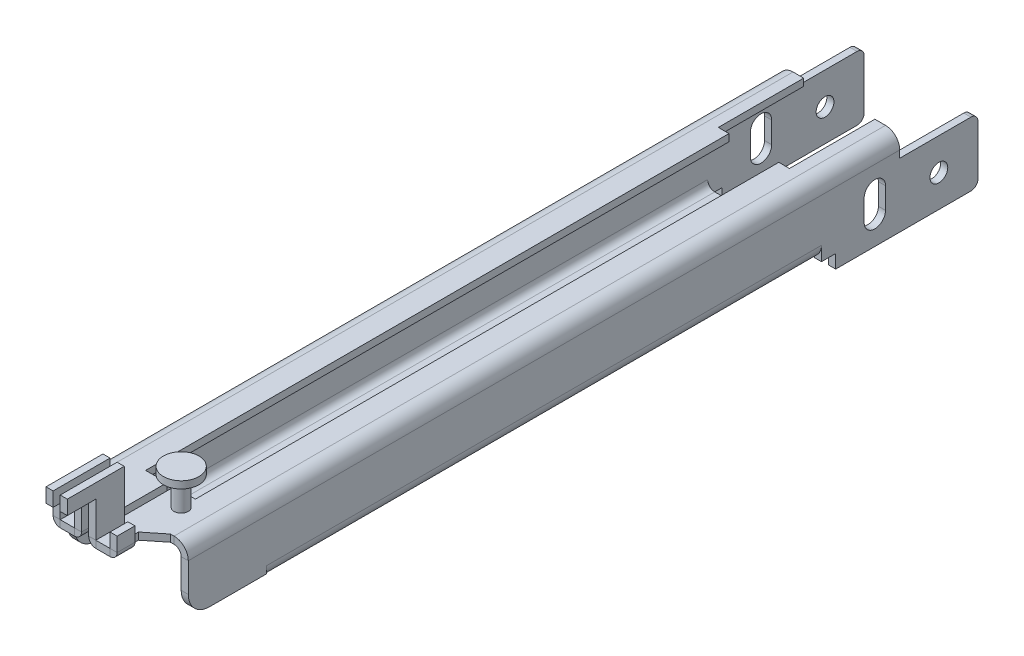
ISO-10303-21;
HEADER;
FILE_DESCRIPTION(('STEP AP214'),'2;1');
FILE_NAME('part.step','',(''),(''),'','','');
FILE_SCHEMA(('AUTOMOTIVE_DESIGN { 1 0 10303 214 1 1 1 1 }'));
ENDSEC;
DATA;
#1=APPLICATION_CONTEXT('core data for automotive mechanical design processes');
#2=APPLICATION_PROTOCOL_DEFINITION('international standard','automotive_design',2000,#1);
#3=PRODUCT_CONTEXT('',#1,'mechanical');
#4=PRODUCT('Part','Part','',(#3));
#5=PRODUCT_RELATED_PRODUCT_CATEGORY('part','',(#4));
#6=PRODUCT_DEFINITION_FORMATION('','',#4);
#7=PRODUCT_DEFINITION_CONTEXT('part definition',#1,'design');
#8=PRODUCT_DEFINITION('design','',#6,#7);
#9=PRODUCT_DEFINITION_SHAPE('','',#8);
#10=(LENGTH_UNIT() NAMED_UNIT(*) SI_UNIT(.MILLI.,.METRE.));
#11=(NAMED_UNIT(*) PLANE_ANGLE_UNIT() SI_UNIT($,.RADIAN.));
#12=(NAMED_UNIT(*) SI_UNIT($,.STERADIAN.) SOLID_ANGLE_UNIT());
#13=UNCERTAINTY_MEASURE_WITH_UNIT(LENGTH_MEASURE(1.E-05),#10,'distance_accuracy_value','');
#14=(GEOMETRIC_REPRESENTATION_CONTEXT(3) GLOBAL_UNCERTAINTY_ASSIGNED_CONTEXT((#13)) GLOBAL_UNIT_ASSIGNED_CONTEXT((#10,
#11,#12)) REPRESENTATION_CONTEXT('',''));
#15=CARTESIAN_POINT('',(0.,0.,0.));
#16=DIRECTION('',(0.,0.,1.));
#17=DIRECTION('',(1.,0.,0.));
#18=AXIS2_PLACEMENT_3D('',#15,#16,#17);
#19=CARTESIAN_POINT('',(7.5,10.1,-78.));
#20=DIRECTION('',(0.,-1.,0.));
#21=DIRECTION('',(0.,0.,-1.));
#22=AXIS2_PLACEMENT_3D('',#19,#20,#21);
#23=PLANE('',#22);
#24=DIRECTION('',(1.,0.,0.));
#25=VECTOR('',#24,1.);
#26=CARTESIAN_POINT('',(7.5,10.1,11.));
#27=LINE('',#26,#25);
#28=CARTESIAN_POINT('',(6.,10.1,11.));
#29=VERTEX_POINT('',#28);
#30=CARTESIAN_POINT('',(6.5,10.1,11.));
#31=VERTEX_POINT('',#30);
#32=EDGE_CURVE('E2765',#29,#31,#27,.T.);
#33=ORIENTED_EDGE('',*,*,#32,.T.);
#34=DIRECTION('',(0.,0.,-1.));
#35=VECTOR('',#34,1.);
#36=CARTESIAN_POINT('',(6.5,10.1,11.));
#37=LINE('',#36,#35);
#38=CARTESIAN_POINT('',(6.50000000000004,10.1,-88.9999999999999));
#39=VERTEX_POINT('',#38);
#40=EDGE_CURVE('E2759',#31,#39,#37,.T.);
#41=ORIENTED_EDGE('',*,*,#40,.T.);
#42=DIRECTION('',(1.,0.,0.));
#43=VECTOR('',#42,1.);
#44=CARTESIAN_POINT('',(7.5,10.1,-89.));
#45=LINE('',#44,#43);
#46=CARTESIAN_POINT('',(4.99999999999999,10.1,-89.));
#47=VERTEX_POINT('',#46);
#48=EDGE_CURVE('E2762',#47,#39,#45,.T.);
#49=ORIENTED_EDGE('',*,*,#48,.F.);
#50=DIRECTION('',(0.,0.,-1.));
#51=VECTOR('',#50,1.);
#52=CARTESIAN_POINT('',(4.99999999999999,10.1,-89.));
#53=LINE('',#52,#51);
#54=CARTESIAN_POINT('',(4.99999999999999,10.1,-77.));
#55=VERTEX_POINT('',#54);
#56=EDGE_CURVE('E2880',#55,#47,#53,.T.);
#57=ORIENTED_EDGE('',*,*,#56,.F.);
#58=DIRECTION('',(1.,0.,0.));
#59=VECTOR('',#58,1.);
#60=CARTESIAN_POINT('',(4.99999999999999,10.1,-77.));
#61=LINE('',#60,#59);
#62=CARTESIAN_POINT('',(3.5,10.1,-77.));
#63=VERTEX_POINT('',#62);
#64=EDGE_CURVE('E2877',#63,#55,#61,.T.);
#65=ORIENTED_EDGE('',*,*,#64,.F.);
#66=DIRECTION('',(0.,0.,1.));
#67=VECTOR('',#66,1.);
#68=CARTESIAN_POINT('',(3.5,10.1,-89.));
#69=LINE('',#68,#67);
#70=CARTESIAN_POINT('',(3.5,10.1,4.99999999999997));
#71=VERTEX_POINT('',#70);
#72=EDGE_CURVE('E2873',#63,#71,#69,.T.);
#73=ORIENTED_EDGE('',*,*,#72,.T.);
#74=DIRECTION('',(1.,0.,0.));
#75=VECTOR('',#74,1.);
#76=CARTESIAN_POINT('',(3.5,10.1,4.99999999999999));
#77=LINE('',#76,#75);
#78=CARTESIAN_POINT('',(0.5,10.1,5.));
#79=VERTEX_POINT('',#78);
#80=EDGE_CURVE('E2868',#79,#71,#77,.T.);
#81=ORIENTED_EDGE('',*,*,#80,.F.);
#82=DIRECTION('',(0.,0.,-1.));
#83=VECTOR('',#82,1.);
#84=CARTESIAN_POINT('',(0.5,10.1,5.));
#85=LINE('',#84,#83);
#86=CARTESIAN_POINT('',(0.500000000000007,10.1,13.));
#87=VERTEX_POINT('',#86);
#88=EDGE_CURVE('E2871',#87,#79,#85,.T.);
#89=ORIENTED_EDGE('',*,*,#88,.F.);
#90=DIRECTION('',(-1.,0.,0.));
#91=VECTOR('',#90,1.);
#92=CARTESIAN_POINT('',(1.5,10.1,13.));
#93=LINE('',#92,#91);
#94=CARTESIAN_POINT('',(1.5,10.1,13.));
#95=VERTEX_POINT('',#94);
#96=EDGE_CURVE('E816',#95,#87,#93,.T.);
#97=ORIENTED_EDGE('',*,*,#96,.F.);
#98=DIRECTION('',(0.,0.,1.));
#99=VECTOR('',#98,1.);
#100=CARTESIAN_POINT('',(1.5,10.1,13.));
#101=LINE('',#100,#99);
#102=CARTESIAN_POINT('',(1.5,10.1,17.));
#103=VERTEX_POINT('',#102);
#104=EDGE_CURVE('E828',#95,#103,#101,.T.);
#105=ORIENTED_EDGE('',*,*,#104,.T.);
#106=DIRECTION('',(-1.,0.,0.));
#107=VECTOR('',#106,1.);
#108=CARTESIAN_POINT('',(3.5,10.1,17.));
#109=LINE('',#108,#107);
#110=CARTESIAN_POINT('',(3.5,10.1,17.));
#111=VERTEX_POINT('',#110);
#112=EDGE_CURVE('E2784',#111,#103,#109,.T.);
#113=ORIENTED_EDGE('',*,*,#112,.F.);
#114=DIRECTION('',(0.,0.,1.));
#115=VECTOR('',#114,1.);
#116=CARTESIAN_POINT('',(3.5,10.1,13.));
#117=LINE('',#116,#115);
#118=CARTESIAN_POINT('',(3.5,10.1,14.5));
#119=VERTEX_POINT('',#118);
#120=EDGE_CURVE('E798',#119,#111,#117,.T.);
#121=ORIENTED_EDGE('',*,*,#120,.F.);
#122=DIRECTION('',(0.,0.,1.));
#123=VECTOR('',#122,1.);
#124=CARTESIAN_POINT('',(3.5,10.1,13.));
#125=LINE('',#124,#123);
#126=CARTESIAN_POINT('',(3.5,10.1,13.));
#127=VERTEX_POINT('',#126);
#128=EDGE_CURVE('E2780',#127,#119,#125,.T.);
#129=ORIENTED_EDGE('',*,*,#128,.F.);
#130=DIRECTION('',(-0.78086880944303,0.,0.624695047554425));
#131=VECTOR('',#130,1.);
#132=CARTESIAN_POINT('',(6.,10.1,11.));
#133=LINE('',#132,#131);
#134=EDGE_CURVE('E2768',#29,#127,#133,.T.);
#135=ORIENTED_EDGE('',*,*,#134,.F.);
#136=EDGE_LOOP('',(#33,#41,#49,#57,#65,#73,#81,#89,#97,#105,#113,#121,#129,#135));
#137=FACE_BOUND('',#136,.T.);
#138=CARTESIAN_POINT('',(3.49999999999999,10.1,7.));
#139=DIRECTION('',(0.,-1.,0.));
#140=DIRECTION('',(0.,0.,-1.));
#141=AXIS2_PLACEMENT_3D('',#138,#139,#140);
#142=CIRCLE('',#141,1.);
#143=CARTESIAN_POINT('',(3.49999999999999,10.1,6.));
#144=VERTEX_POINT('',#143);
#145=EDGE_CURVE('E13',#144,#144,#142,.F.);
#146=ORIENTED_EDGE('',*,*,#145,.F.);
#147=EDGE_LOOP('',(#146));
#148=FACE_BOUND('',#147,.T.);
#149=ADVANCED_FACE('F93',(#137,#148),#23,.F.);
#150=CARTESIAN_POINT('',(2.90312423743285,12.1,17.));
#151=DIRECTION('',(0.,0.,-1.));
#152=DIRECTION('',(-1.,0.,0.));
#153=AXIS2_PLACEMENT_3D('',#150,#151,#152);
#154=PLANE('',#153);
#155=DIRECTION('',(0.,-1.,0.));
#156=VECTOR('',#155,1.);
#157=CARTESIAN_POINT('',(-4.5,12.1,17.));
#158=LINE('',#157,#156);
#159=CARTESIAN_POINT('',(-4.5,12.1,17.));
#160=VERTEX_POINT('',#159);
#161=CARTESIAN_POINT('',(-4.49999999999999,10.1000000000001,17.));
#162=VERTEX_POINT('',#161);
#163=EDGE_CURVE('E109',#160,#162,#158,.T.);
#164=ORIENTED_EDGE('',*,*,#163,.T.);
#165=DIRECTION('',(-1.,0.,0.));
#166=VECTOR('',#165,1.);
#167=CARTESIAN_POINT('',(2.90312423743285,10.1,17.));
#168=LINE('',#167,#166);
#169=CARTESIAN_POINT('',(-3.5,10.1,17.));
#170=VERTEX_POINT('',#169);
#171=EDGE_CURVE('E102',#170,#162,#168,.T.);
#172=ORIENTED_EDGE('',*,*,#171,.F.);
#173=DIRECTION('',(0.,-1.,0.));
#174=VECTOR('',#173,1.);
#175=CARTESIAN_POINT('',(-3.49999999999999,12.1,17.));
#176=LINE('',#175,#174);
#177=CARTESIAN_POINT('',(-3.49999999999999,12.1,17.));
#178=VERTEX_POINT('',#177);
#179=EDGE_CURVE('E900',#178,#170,#176,.T.);
#180=ORIENTED_EDGE('',*,*,#179,.F.);
#181=DIRECTION('',(-1.,0.,0.));
#182=VECTOR('',#181,1.);
#183=CARTESIAN_POINT('',(2.90312423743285,12.1,17.));
#184=LINE('',#183,#182);
#185=EDGE_CURVE('E905',#178,#160,#184,.T.);
#186=ORIENTED_EDGE('',*,*,#185,.T.);
#187=EDGE_LOOP('',(#164,#172,#180,#186));
#188=FACE_BOUND('',#187,.T.);
#189=ADVANCED_FACE('F95',(#188),#154,.F.);
#190=CARTESIAN_POINT('',(2.90312423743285,12.1,14.5));
#191=DIRECTION('',(0.,0.,-1.));
#192=DIRECTION('',(-1.,0.,0.));
#193=AXIS2_PLACEMENT_3D('',#190,#191,#192);
#194=PLANE('',#193);
#195=DIRECTION('',(-1.,0.,0.));
#196=VECTOR('',#195,1.);
#197=CARTESIAN_POINT('',(2.90312423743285,10.1,14.5));
#198=LINE('',#197,#196);
#199=CARTESIAN_POINT('',(-3.5,10.1,14.5));
#200=VERTEX_POINT('',#199);
#201=CARTESIAN_POINT('',(-4.5,10.1,14.5));
#202=VERTEX_POINT('',#201);
#203=EDGE_CURVE('E911',#200,#202,#198,.T.);
#204=ORIENTED_EDGE('',*,*,#203,.T.);
#205=DIRECTION('',(0.,-1.,0.));
#206=VECTOR('',#205,1.);
#207=CARTESIAN_POINT('',(-4.5,12.1,14.5));
#208=LINE('',#207,#206);
#209=CARTESIAN_POINT('',(-4.5,12.1,14.5));
#210=VERTEX_POINT('',#209);
#211=EDGE_CURVE('E895',#210,#202,#208,.T.);
#212=ORIENTED_EDGE('',*,*,#211,.F.);
#213=DIRECTION('',(-1.,0.,0.));
#214=VECTOR('',#213,1.);
#215=CARTESIAN_POINT('',(2.90312423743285,12.1,14.5));
#216=LINE('',#215,#214);
#217=CARTESIAN_POINT('',(-3.49999999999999,12.1,14.5));
#218=VERTEX_POINT('',#217);
#219=EDGE_CURVE('E909',#218,#210,#216,.T.);
#220=ORIENTED_EDGE('',*,*,#219,.F.);
#221=DIRECTION('',(0.,-1.,0.));
#222=VECTOR('',#221,1.);
#223=CARTESIAN_POINT('',(-3.49999999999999,12.1,14.5));
#224=LINE('',#223,#222);
#225=EDGE_CURVE('E906',#218,#200,#224,.T.);
#226=ORIENTED_EDGE('',*,*,#225,.T.);
#227=EDGE_LOOP('',(#204,#212,#220,#226));
#228=FACE_BOUND('',#227,.T.);
#229=ADVANCED_FACE('F1475',(#228),#194,.T.);
#230=CARTESIAN_POINT('',(2.90312423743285,12.1,17.));
#231=DIRECTION('',(0.,1.,0.));
#232=DIRECTION('',(-1.,0.,0.));
#233=AXIS2_PLACEMENT_3D('',#230,#231,#232);
#234=PLANE('',#233);
#235=ORIENTED_EDGE('',*,*,#219,.T.);
#236=DIRECTION('',(0.,0.,-1.));
#237=VECTOR('',#236,1.);
#238=CARTESIAN_POINT('',(-4.5,12.1,17.));
#239=LINE('',#238,#237);
#240=EDGE_CURVE('E892',#160,#210,#239,.T.);
#241=ORIENTED_EDGE('',*,*,#240,.F.);
#242=ORIENTED_EDGE('',*,*,#185,.F.);
#243=DIRECTION('',(0.,0.,-1.));
#244=VECTOR('',#243,1.);
#245=CARTESIAN_POINT('',(-3.49999999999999,12.1,17.));
#246=LINE('',#245,#244);
#247=EDGE_CURVE('E117',#178,#218,#246,.T.);
#248=ORIENTED_EDGE('',*,*,#247,.T.);
#249=EDGE_LOOP('',(#235,#241,#242,#248));
#250=FACE_BOUND('',#249,.T.);
#251=ADVANCED_FACE('F1645',(#250),#234,.T.);
#252=CARTESIAN_POINT('',(-3.49999999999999,12.1,17.));
#253=DIRECTION('',(-1.,0.,0.));
#254=DIRECTION('',(0.,0.,1.));
#255=AXIS2_PLACEMENT_3D('',#252,#253,#254);
#256=PLANE('',#255);
#257=ORIENTED_EDGE('',*,*,#179,.T.);
#258=DIRECTION('',(0.,0.,-1.));
#259=VECTOR('',#258,1.);
#260=CARTESIAN_POINT('',(-3.50000000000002,10.1,-78.));
#261=LINE('',#260,#259);
#262=EDGE_CURVE('E903',#170,#200,#261,.T.);
#263=ORIENTED_EDGE('',*,*,#262,.T.);
#264=ORIENTED_EDGE('',*,*,#225,.F.);
#265=ORIENTED_EDGE('',*,*,#247,.F.);
#266=EDGE_LOOP('',(#257,#263,#264,#265));
#267=FACE_BOUND('',#266,.T.);
#268=ADVANCED_FACE('F926',(#267),#256,.F.);
#269=CARTESIAN_POINT('',(-4.5,12.1,17.));
#270=DIRECTION('',(-1.,0.,0.));
#271=DIRECTION('',(0.,0.,1.));
#272=AXIS2_PLACEMENT_3D('',#269,#270,#271);
#273=PLANE('',#272);
#274=ORIENTED_EDGE('',*,*,#211,.T.);
#275=DIRECTION('',(0.,0.,1.));
#276=VECTOR('',#275,1.);
#277=CARTESIAN_POINT('',(-4.50000000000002,10.1,-78.));
#278=LINE('',#277,#276);
#279=EDGE_CURVE('E898',#202,#162,#278,.T.);
#280=ORIENTED_EDGE('',*,*,#279,.T.);
#281=ORIENTED_EDGE('',*,*,#163,.F.);
#282=ORIENTED_EDGE('',*,*,#240,.T.);
#283=EDGE_LOOP('',(#274,#280,#281,#282));
#284=FACE_BOUND('',#283,.T.);
#285=ADVANCED_FACE('F957',(#284),#273,.T.);
#286=CARTESIAN_POINT('',(-3.5,-202.239351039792,13.));
#287=DIRECTION('',(1.,0.,0.));
#288=DIRECTION('',(0.,0.,1.));
#289=AXIS2_PLACEMENT_3D('',#286,#287,#288);
#290=PLANE('',#289);
#291=DIRECTION('',(0.,-1.,0.));
#292=VECTOR('',#291,1.);
#293=CARTESIAN_POINT('',(-3.5,10.1,14.5));
#294=LINE('',#293,#292);
#295=CARTESIAN_POINT('',(-3.50000000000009,9.10000000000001,14.5));
#296=VERTEX_POINT('',#295);
#297=EDGE_CURVE('E878',#200,#296,#294,.T.);
#298=ORIENTED_EDGE('',*,*,#297,.F.);
#299=DIRECTION('',(0.,0.,1.));
#300=VECTOR('',#299,1.);
#301=CARTESIAN_POINT('',(-3.5,10.1,13.));
#302=LINE('',#301,#300);
#303=CARTESIAN_POINT('',(-3.5,10.1,13.));
#304=VERTEX_POINT('',#303);
#305=EDGE_CURVE('E884',#304,#200,#302,.T.);
#306=ORIENTED_EDGE('',*,*,#305,.F.);
#307=DIRECTION('',(0.,1.,0.));
#308=VECTOR('',#307,1.);
#309=CARTESIAN_POINT('',(-3.5,-202.239351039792,13.));
#310=LINE('',#309,#308);
#311=CARTESIAN_POINT('',(-3.5,9.09999999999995,13.));
#312=VERTEX_POINT('',#311);
#313=EDGE_CURVE('E954',#312,#304,#310,.T.);
#314=ORIENTED_EDGE('',*,*,#313,.F.);
#315=DIRECTION('',(0.,0.,-1.));
#316=VECTOR('',#315,1.);
#317=CARTESIAN_POINT('',(-3.50000000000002,9.10000000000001,-78.));
#318=LINE('',#317,#316);
#319=EDGE_CURVE('E970',#296,#312,#318,.T.);
#320=ORIENTED_EDGE('',*,*,#319,.F.);
#321=EDGE_LOOP('',(#298,#306,#314,#320));
#322=FACE_BOUND('',#321,.T.);
#323=ADVANCED_FACE('F967',(#322),#290,.F.);
#324=CARTESIAN_POINT('',(-22.7602916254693,17.1,13.));
#325=DIRECTION('',(0.,0.,-1.));
#326=DIRECTION('',(0.,1.,0.));
#327=AXIS2_PLACEMENT_3D('',#324,#325,#326);
#328=PLANE('',#327);
#329=DIRECTION('',(1.,0.,0.));
#330=VECTOR('',#329,1.);
#331=CARTESIAN_POINT('',(-22.7602916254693,17.1,13.));
#332=LINE('',#331,#330);
#333=CARTESIAN_POINT('',(-1.5,17.1,13.));
#334=VERTEX_POINT('',#333);
#335=CARTESIAN_POINT('',(-0.5,17.1,13.));
#336=VERTEX_POINT('',#335);
#337=EDGE_CURVE('E1047',#334,#336,#332,.T.);
#338=ORIENTED_EDGE('',*,*,#337,.T.);
#339=DIRECTION('',(0.,1.,0.));
#340=VECTOR('',#339,1.);
#341=CARTESIAN_POINT('',(-0.5,17.1,13.));
#342=LINE('',#341,#340);
#343=CARTESIAN_POINT('',(-0.500000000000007,10.1,13.));
#344=VERTEX_POINT('',#343);
#345=EDGE_CURVE('E1018',#344,#336,#342,.T.);
#346=ORIENTED_EDGE('',*,*,#345,.F.);
#347=DIRECTION('',(1.,0.,0.));
#348=VECTOR('',#347,1.);
#349=CARTESIAN_POINT('',(-1.5,10.1,13.));
#350=LINE('',#349,#348);
#351=CARTESIAN_POINT('',(-1.5,10.1,13.));
#352=VERTEX_POINT('',#351);
#353=EDGE_CURVE('E1015',#352,#344,#350,.T.);
#354=ORIENTED_EDGE('',*,*,#353,.F.);
#355=DIRECTION('',(0.,1.,0.));
#356=VECTOR('',#355,1.);
#357=CARTESIAN_POINT('',(-1.5,17.1,13.));
#358=LINE('',#357,#356);
#359=EDGE_CURVE('E1037',#352,#334,#358,.T.);
#360=ORIENTED_EDGE('',*,*,#359,.T.);
#361=EDGE_LOOP('',(#338,#346,#354,#360));
#362=FACE_BOUND('',#361,.T.);
#363=ADVANCED_FACE('F1599',(#362),#328,.T.);
#364=CARTESIAN_POINT('',(-22.7602916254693,9.1,17.));
#365=DIRECTION('',(0.,0.,1.));
#366=DIRECTION('',(0.,-1.,0.));
#367=AXIS2_PLACEMENT_3D('',#364,#365,#366);
#368=PLANE('',#367);
#369=DIRECTION('',(1.,0.,0.));
#370=VECTOR('',#369,1.);
#371=CARTESIAN_POINT('',(-1.5,10.1,17.));
#372=LINE('',#371,#370);
#373=CARTESIAN_POINT('',(-1.5,10.1,17.));
#374=VERTEX_POINT('',#373);
#375=CARTESIAN_POINT('',(-0.500000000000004,10.1,17.));
#376=VERTEX_POINT('',#375);
#377=EDGE_CURVE('E1019',#374,#376,#372,.T.);
#378=ORIENTED_EDGE('',*,*,#377,.T.);
#379=DIRECTION('',(0.,1.,0.));
#380=VECTOR('',#379,1.);
#381=CARTESIAN_POINT('',(-0.499999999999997,-4.10037878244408,17.));
#382=LINE('',#381,#380);
#383=CARTESIAN_POINT('',(-0.499999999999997,15.1,17.));
#384=VERTEX_POINT('',#383);
#385=EDGE_CURVE('E1031',#376,#384,#382,.T.);
#386=ORIENTED_EDGE('',*,*,#385,.T.);
#387=DIRECTION('',(1.,0.,0.));
#388=VECTOR('',#387,1.);
#389=CARTESIAN_POINT('',(-22.7602916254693,15.1,17.));
#390=LINE('',#389,#388);
#391=CARTESIAN_POINT('',(-1.5,15.1,17.));
#392=VERTEX_POINT('',#391);
#393=EDGE_CURVE('E893',#392,#384,#390,.T.);
#394=ORIENTED_EDGE('',*,*,#393,.F.);
#395=DIRECTION('',(0.,-1.,0.));
#396=VECTOR('',#395,1.);
#397=CARTESIAN_POINT('',(-1.5,9.1,17.));
#398=LINE('',#397,#396);
#399=EDGE_CURVE('E1039',#392,#374,#398,.T.);
#400=ORIENTED_EDGE('',*,*,#399,.T.);
#401=EDGE_LOOP('',(#378,#386,#394,#400));
#402=FACE_BOUND('',#401,.T.);
#403=ADVANCED_FACE('F1065',(#402),#368,.T.);
#404=CARTESIAN_POINT('',(-22.7602916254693,15.1,17.));
#405=DIRECTION('',(0.,-1.,0.));
#406=DIRECTION('',(0.,0.,-1.));
#407=AXIS2_PLACEMENT_3D('',#404,#405,#406);
#408=PLANE('',#407);
#409=ORIENTED_EDGE('',*,*,#393,.T.);
#410=DIRECTION('',(0.,0.,-1.));
#411=VECTOR('',#410,1.);
#412=CARTESIAN_POINT('',(-0.499999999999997,15.1,17.));
#413=LINE('',#412,#411);
#414=CARTESIAN_POINT('',(-0.499999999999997,15.1,21.));
#415=VERTEX_POINT('',#414);
#416=EDGE_CURVE('E1029',#415,#384,#413,.T.);
#417=ORIENTED_EDGE('',*,*,#416,.F.);
#418=DIRECTION('',(1.,0.,0.));
#419=VECTOR('',#418,1.);
#420=CARTESIAN_POINT('',(-22.7602916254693,15.1,21.));
#421=LINE('',#420,#419);
#422=CARTESIAN_POINT('',(-1.5,15.1,21.));
#423=VERTEX_POINT('',#422);
#424=EDGE_CURVE('E1052',#423,#415,#421,.T.);
#425=ORIENTED_EDGE('',*,*,#424,.F.);
#426=DIRECTION('',(0.,0.,-1.));
#427=VECTOR('',#426,1.);
#428=CARTESIAN_POINT('',(-1.5,15.1,17.));
#429=LINE('',#428,#427);
#430=EDGE_CURVE('E1041',#423,#392,#429,.T.);
#431=ORIENTED_EDGE('',*,*,#430,.T.);
#432=EDGE_LOOP('',(#409,#417,#425,#431));
#433=FACE_BOUND('',#432,.T.);
#434=ADVANCED_FACE('F1061',(#433),#408,.T.);
#435=CARTESIAN_POINT('',(-22.7602916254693,15.1,21.));
#436=DIRECTION('',(0.,0.,1.));
#437=DIRECTION('',(0.,-1.,0.));
#438=AXIS2_PLACEMENT_3D('',#435,#436,#437);
#439=PLANE('',#438);
#440=ORIENTED_EDGE('',*,*,#424,.T.);
#441=DIRECTION('',(0.,-1.,0.));
#442=VECTOR('',#441,1.);
#443=CARTESIAN_POINT('',(-0.499999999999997,15.1,21.));
#444=LINE('',#443,#442);
#445=CARTESIAN_POINT('',(-0.499999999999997,17.1,21.));
#446=VERTEX_POINT('',#445);
#447=EDGE_CURVE('E1027',#446,#415,#444,.T.);
#448=ORIENTED_EDGE('',*,*,#447,.F.);
#449=DIRECTION('',(1.,0.,0.));
#450=VECTOR('',#449,1.);
#451=CARTESIAN_POINT('',(-22.7602916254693,17.1,21.));
#452=LINE('',#451,#450);
#453=CARTESIAN_POINT('',(-1.5,17.1,21.));
#454=VERTEX_POINT('',#453);
#455=EDGE_CURVE('E1050',#454,#446,#452,.T.);
#456=ORIENTED_EDGE('',*,*,#455,.F.);
#457=DIRECTION('',(0.,-1.,0.));
#458=VECTOR('',#457,1.);
#459=CARTESIAN_POINT('',(-1.5,15.1,21.));
#460=LINE('',#459,#458);
#461=EDGE_CURVE('E1043',#454,#423,#460,.T.);
#462=ORIENTED_EDGE('',*,*,#461,.T.);
#463=EDGE_LOOP('',(#440,#448,#456,#462));
#464=FACE_BOUND('',#463,.T.);
#465=ADVANCED_FACE('F1631',(#464),#439,.T.);
#466=CARTESIAN_POINT('',(-22.7602916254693,17.1,21.));
#467=DIRECTION('',(0.,1.,0.));
#468=DIRECTION('',(0.,0.,1.));
#469=AXIS2_PLACEMENT_3D('',#466,#467,#468);
#470=PLANE('',#469);
#471=ORIENTED_EDGE('',*,*,#455,.T.);
#472=DIRECTION('',(0.,0.,1.));
#473=VECTOR('',#472,1.);
#474=CARTESIAN_POINT('',(-0.499999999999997,17.1,21.));
#475=LINE('',#474,#473);
#476=EDGE_CURVE('E1025',#336,#446,#475,.T.);
#477=ORIENTED_EDGE('',*,*,#476,.F.);
#478=ORIENTED_EDGE('',*,*,#337,.F.);
#479=DIRECTION('',(0.,0.,1.));
#480=VECTOR('',#479,1.);
#481=CARTESIAN_POINT('',(-1.5,17.1,21.));
#482=LINE('',#481,#480);
#483=EDGE_CURVE('E1045',#334,#454,#482,.T.);
#484=ORIENTED_EDGE('',*,*,#483,.T.);
#485=EDGE_LOOP('',(#471,#477,#478,#484));
#486=FACE_BOUND('',#485,.T.);
#487=ADVANCED_FACE('F1628',(#486),#470,.T.);
#488=CARTESIAN_POINT('',(-1.5,17.1,17.));
#489=DIRECTION('',(1.,0.,0.));
#490=DIRECTION('',(0.,0.,1.));
#491=AXIS2_PLACEMENT_3D('',#488,#489,#490);
#492=PLANE('',#491);
#493=ORIENTED_EDGE('',*,*,#359,.F.);
#494=DIRECTION('',(0.,0.,-1.));
#495=VECTOR('',#494,1.);
#496=CARTESIAN_POINT('',(-1.5,10.1,17.));
#497=LINE('',#496,#495);
#498=EDGE_CURVE('E1016',#374,#352,#497,.T.);
#499=ORIENTED_EDGE('',*,*,#498,.F.);
#500=ORIENTED_EDGE('',*,*,#399,.F.);
#501=ORIENTED_EDGE('',*,*,#430,.F.);
#502=ORIENTED_EDGE('',*,*,#461,.F.);
#503=ORIENTED_EDGE('',*,*,#483,.F.);
#504=EDGE_LOOP('',(#493,#499,#500,#501,#502,#503));
#505=FACE_BOUND('',#504,.T.);
#506=ADVANCED_FACE('F1069',(#505),#492,.F.);
#507=CARTESIAN_POINT('',(-0.5,-4.10037878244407,4.99999999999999));
#508=DIRECTION('',(1.,0.,0.));
#509=DIRECTION('',(0.,0.,-1.));
#510=AXIS2_PLACEMENT_3D('',#507,#508,#509);
#511=PLANE('',#510);
#512=ORIENTED_EDGE('',*,*,#385,.F.);
#513=DIRECTION('',(0.,0.,-1.));
#514=VECTOR('',#513,1.);
#515=CARTESIAN_POINT('',(-0.499999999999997,10.1,-78.));
#516=LINE('',#515,#514);
#517=EDGE_CURVE('E1034',#376,#344,#516,.T.);
#518=ORIENTED_EDGE('',*,*,#517,.T.);
#519=ORIENTED_EDGE('',*,*,#345,.T.);
#520=ORIENTED_EDGE('',*,*,#476,.T.);
#521=ORIENTED_EDGE('',*,*,#447,.T.);
#522=ORIENTED_EDGE('',*,*,#416,.T.);
#523=EDGE_LOOP('',(#512,#518,#519,#520,#521,#522));
#524=FACE_BOUND('',#523,.T.);
#525=ADVANCED_FACE('F1588',(#524),#511,.T.);
#526=CARTESIAN_POINT('',(-1.5,10.1,13.));
#527=DIRECTION('',(0.,0.,-1.));
#528=DIRECTION('',(0.,-1.,0.));
#529=AXIS2_PLACEMENT_3D('',#526,#527,#528);
#530=PLANE('',#529);
#531=CARTESIAN_POINT('',(-1.5,10.1,13.));
#532=DIRECTION('',(0.,0.,-1.));
#533=DIRECTION('',(1.,0.,0.));
#534=AXIS2_PLACEMENT_3D('',#531,#532,#533);
#535=CIRCLE('',#534,0.999999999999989);
#536=CARTESIAN_POINT('',(-1.5,9.10000000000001,13.));
#537=VERTEX_POINT('',#536);
#538=EDGE_CURVE('E882',#537,#344,#535,.F.);
#539=ORIENTED_EDGE('',*,*,#538,.F.);
#540=DIRECTION('',(1.,0.,0.));
#541=VECTOR('',#540,1.);
#542=CARTESIAN_POINT('',(6.28539816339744,9.1,13.));
#543=LINE('',#542,#541);
#544=CARTESIAN_POINT('',(-0.5,9.1,13.));
#545=VERTEX_POINT('',#544);
#546=EDGE_CURVE('E1082',#537,#545,#543,.T.);
#547=ORIENTED_EDGE('',*,*,#546,.T.);
#548=DIRECTION('',(0.,-1.,0.));
#549=VECTOR('',#548,1.);
#550=CARTESIAN_POINT('',(-0.5,10.1,13.));
#551=LINE('',#550,#549);
#552=EDGE_CURVE('E1078',#344,#545,#551,.T.);
#553=ORIENTED_EDGE('',*,*,#552,.F.);
#554=EDGE_LOOP('',(#539,#547,#553));
#555=FACE_BOUND('',#554,.T.);
#556=ADVANCED_FACE('F1080',(#555),#530,.F.);
#557=CARTESIAN_POINT('',(-3.5,-202.239351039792,-89.));
#558=DIRECTION('',(0.,0.,-1.));
#559=DIRECTION('',(1.,0.,0.));
#560=AXIS2_PLACEMENT_3D('',#557,#558,#559);
#561=PLANE('',#560);
#562=DIRECTION('',(-1.,0.,0.));
#563=VECTOR('',#562,1.);
#564=CARTESIAN_POINT('',(-7.5,10.1,-89.));
#565=LINE('',#564,#563);
#566=CARTESIAN_POINT('',(-5.00000000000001,10.1,-89.));
#567=VERTEX_POINT('',#566);
#568=CARTESIAN_POINT('',(-6.5,10.1,-89.));
#569=VERTEX_POINT('',#568);
#570=EDGE_CURVE('E1103',#567,#569,#565,.T.);
#571=ORIENTED_EDGE('',*,*,#570,.F.);
#572=DIRECTION('',(0.,1.,0.));
#573=VECTOR('',#572,1.);
#574=CARTESIAN_POINT('',(-5.00000000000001,-202.239351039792,-89.));
#575=LINE('',#574,#573);
#576=CARTESIAN_POINT('',(-5.00000000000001,9.09999999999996,-89.));
#577=VERTEX_POINT('',#576);
#578=EDGE_CURVE('E1009',#577,#567,#575,.T.);
#579=ORIENTED_EDGE('',*,*,#578,.F.);
#580=DIRECTION('',(-1.,0.,0.));
#581=VECTOR('',#580,1.);
#582=CARTESIAN_POINT('',(-3.5,9.10000000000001,-89.));
#583=LINE('',#582,#581);
#584=CARTESIAN_POINT('',(-6.5,9.10000000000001,-89.));
#585=VERTEX_POINT('',#584);
#586=EDGE_CURVE('E975',#577,#585,#583,.T.);
#587=ORIENTED_EDGE('',*,*,#586,.T.);
#588=DIRECTION('',(0.,1.,0.));
#589=VECTOR('',#588,1.);
#590=CARTESIAN_POINT('',(-6.5,-202.239351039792,-89.));
#591=LINE('',#590,#589);
#592=EDGE_CURVE('E1012',#585,#569,#591,.T.);
#593=ORIENTED_EDGE('',*,*,#592,.T.);
#594=EDGE_LOOP('',(#571,#579,#587,#593));
#595=FACE_BOUND('',#594,.T.);
#596=ADVANCED_FACE('F1149',(#595),#561,.T.);
#597=CARTESIAN_POINT('',(-5.00000000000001,-202.239351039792,-89.));
#598=DIRECTION('',(-1.,0.,0.));
#599=DIRECTION('',(0.,-1.,0.));
#600=AXIS2_PLACEMENT_3D('',#597,#598,#599);
#601=PLANE('',#600);
#602=ORIENTED_EDGE('',*,*,#578,.T.);
#603=DIRECTION('',(0.,0.,1.));
#604=VECTOR('',#603,1.);
#605=CARTESIAN_POINT('',(-5.00000000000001,10.1,-89.));
#606=LINE('',#605,#604);
#607=CARTESIAN_POINT('',(-5.00000000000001,10.1,-77.));
#608=VERTEX_POINT('',#607);
#609=EDGE_CURVE('E1100',#567,#608,#606,.T.);
#610=ORIENTED_EDGE('',*,*,#609,.T.);
#611=DIRECTION('',(0.,1.,0.));
#612=VECTOR('',#611,1.);
#613=CARTESIAN_POINT('',(-5.00000000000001,-202.239351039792,-77.));
#614=LINE('',#613,#612);
#615=CARTESIAN_POINT('',(-5.00000000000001,9.09999999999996,-77.));
#616=VERTEX_POINT('',#615);
#617=EDGE_CURVE('E1006',#616,#608,#614,.T.);
#618=ORIENTED_EDGE('',*,*,#617,.F.);
#619=DIRECTION('',(0.,0.,1.));
#620=VECTOR('',#619,1.);
#621=CARTESIAN_POINT('',(-5.00000000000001,9.10000000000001,-89.));
#622=LINE('',#621,#620);
#623=EDGE_CURVE('E1118',#577,#616,#622,.T.);
#624=ORIENTED_EDGE('',*,*,#623,.F.);
#625=EDGE_LOOP('',(#602,#610,#618,#624));
#626=FACE_BOUND('',#625,.T.);
#627=ADVANCED_FACE('F1616',(#626),#601,.F.);
#628=CARTESIAN_POINT('',(4.99999999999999,-202.239351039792,-77.));
#629=DIRECTION('',(0.,0.,1.));
#630=DIRECTION('',(-1.,0.,0.));
#631=AXIS2_PLACEMENT_3D('',#628,#629,#630);
#632=PLANE('',#631);
#633=ORIENTED_EDGE('',*,*,#617,.T.);
#634=DIRECTION('',(1.,0.,0.));
#635=VECTOR('',#634,1.);
#636=CARTESIAN_POINT('',(4.99999999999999,10.1,-77.));
#637=LINE('',#636,#635);
#638=CARTESIAN_POINT('',(-3.5,10.1,-77.));
#639=VERTEX_POINT('',#638);
#640=EDGE_CURVE('E1097',#608,#639,#637,.T.);
#641=ORIENTED_EDGE('',*,*,#640,.T.);
#642=DIRECTION('',(0.,1.,0.));
#643=VECTOR('',#642,1.);
#644=CARTESIAN_POINT('',(-3.5,-202.239351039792,-77.));
#645=LINE('',#644,#643);
#646=CARTESIAN_POINT('',(-3.5,9.09999999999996,-77.));
#647=VERTEX_POINT('',#646);
#648=EDGE_CURVE('E1003',#647,#639,#645,.T.);
#649=ORIENTED_EDGE('',*,*,#648,.F.);
#650=DIRECTION('',(1.,0.,0.));
#651=VECTOR('',#650,1.);
#652=CARTESIAN_POINT('',(4.99999999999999,9.10000000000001,-77.));
#653=LINE('',#652,#651);
#654=EDGE_CURVE('E1121',#616,#647,#653,.T.);
#655=ORIENTED_EDGE('',*,*,#654,.F.);
#656=EDGE_LOOP('',(#633,#641,#649,#655));
#657=FACE_BOUND('',#656,.T.);
#658=ADVANCED_FACE('F1612',(#657),#632,.F.);
#659=CARTESIAN_POINT('',(-3.5,-202.239351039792,-89.));
#660=DIRECTION('',(-1.,0.,0.));
#661=DIRECTION('',(0.,-1.,0.));
#662=AXIS2_PLACEMENT_3D('',#659,#660,#661);
#663=PLANE('',#662);
#664=ORIENTED_EDGE('',*,*,#648,.T.);
#665=DIRECTION('',(0.,0.,1.));
#666=VECTOR('',#665,1.);
#667=CARTESIAN_POINT('',(-3.5,10.1,-89.));
#668=LINE('',#667,#666);
#669=CARTESIAN_POINT('',(-3.5,10.1,5.));
#670=VERTEX_POINT('',#669);
#671=EDGE_CURVE('E1114',#639,#670,#668,.T.);
#672=ORIENTED_EDGE('',*,*,#671,.T.);
#673=DIRECTION('',(0.,1.,0.));
#674=VECTOR('',#673,1.);
#675=CARTESIAN_POINT('',(-3.5,-202.239351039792,4.99999999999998));
#676=LINE('',#675,#674);
#677=CARTESIAN_POINT('',(-3.5,9.09999999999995,5.));
#678=VERTEX_POINT('',#677);
#679=EDGE_CURVE('E1000',#678,#670,#676,.T.);
#680=ORIENTED_EDGE('',*,*,#679,.F.);
#681=DIRECTION('',(0.,0.,1.));
#682=VECTOR('',#681,1.);
#683=CARTESIAN_POINT('',(-3.5,9.10000000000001,-89.));
#684=LINE('',#683,#682);
#685=EDGE_CURVE('E1124',#647,#678,#684,.T.);
#686=ORIENTED_EDGE('',*,*,#685,.F.);
#687=EDGE_LOOP('',(#664,#672,#680,#686));
#688=FACE_BOUND('',#687,.T.);
#689=ADVANCED_FACE('F1608',(#688),#663,.F.);
#690=CARTESIAN_POINT('',(-3.5,-202.239351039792,4.99999999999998));
#691=DIRECTION('',(0.,0.,1.));
#692=DIRECTION('',(-1.,0.,0.));
#693=AXIS2_PLACEMENT_3D('',#690,#691,#692);
#694=PLANE('',#693);
#695=ORIENTED_EDGE('',*,*,#679,.T.);
#696=DIRECTION('',(-1.,0.,0.));
#697=VECTOR('',#696,1.);
#698=CARTESIAN_POINT('',(-3.5,10.1,5.));
#699=LINE('',#698,#697);
#700=CARTESIAN_POINT('',(-0.5,10.1,5.));
#701=VERTEX_POINT('',#700);
#702=EDGE_CURVE('E1112',#701,#670,#699,.T.);
#703=ORIENTED_EDGE('',*,*,#702,.F.);
#704=DIRECTION('',(0.,1.,0.));
#705=VECTOR('',#704,1.);
#706=CARTESIAN_POINT('',(-0.5,-202.239351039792,4.99999999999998));
#707=LINE('',#706,#705);
#708=CARTESIAN_POINT('',(-0.500000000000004,9.09999999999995,5.));
#709=VERTEX_POINT('',#708);
#710=EDGE_CURVE('E953',#709,#701,#707,.T.);
#711=ORIENTED_EDGE('',*,*,#710,.F.);
#712=DIRECTION('',(1.,0.,0.));
#713=VECTOR('',#712,1.);
#714=CARTESIAN_POINT('',(-3.5,9.1,5.));
#715=LINE('',#714,#713);
#716=EDGE_CURVE('E1127',#678,#709,#715,.T.);
#717=ORIENTED_EDGE('',*,*,#716,.F.);
#718=EDGE_LOOP('',(#695,#703,#711,#717));
#719=FACE_BOUND('',#718,.T.);
#720=ADVANCED_FACE('F1605',(#719),#694,.F.);
#721=CARTESIAN_POINT('',(-0.5,-202.239351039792,4.99999999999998));
#722=DIRECTION('',(-1.,0.,0.));
#723=DIRECTION('',(0.,-1.,0.));
#724=AXIS2_PLACEMENT_3D('',#721,#722,#723);
#725=PLANE('',#724);
#726=ORIENTED_EDGE('',*,*,#710,.T.);
#727=DIRECTION('',(0.,0.,-1.));
#728=VECTOR('',#727,1.);
#729=CARTESIAN_POINT('',(-0.5,10.1,5.));
#730=LINE('',#729,#728);
#731=EDGE_CURVE('E946',#344,#701,#730,.T.);
#732=ORIENTED_EDGE('',*,*,#731,.F.);
#733=ORIENTED_EDGE('',*,*,#552,.T.);
#734=DIRECTION('',(0.,0.,1.));
#735=VECTOR('',#734,1.);
#736=CARTESIAN_POINT('',(-0.5,9.1,5.));
#737=LINE('',#736,#735);
#738=EDGE_CURVE('E1130',#709,#545,#737,.T.);
#739=ORIENTED_EDGE('',*,*,#738,.F.);
#740=EDGE_LOOP('',(#726,#732,#733,#739));
#741=FACE_BOUND('',#740,.T.);
#742=ADVANCED_FACE('F1602',(#741),#725,.F.);
#743=CARTESIAN_POINT('',(-3.5,-202.239351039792,17.));
#744=DIRECTION('',(0.,0.,-1.));
#745=DIRECTION('',(1.,0.,0.));
#746=AXIS2_PLACEMENT_3D('',#743,#744,#745);
#747=PLANE('',#746);
#748=DIRECTION('',(0.,-1.,0.));
#749=VECTOR('',#748,1.);
#750=CARTESIAN_POINT('',(-1.5,10.1,17.));
#751=LINE('',#750,#749);
#752=CARTESIAN_POINT('',(-1.5,9.1,17.));
#753=VERTEX_POINT('',#752);
#754=EDGE_CURVE('E945',#374,#753,#751,.T.);
#755=ORIENTED_EDGE('',*,*,#754,.F.);
#756=DIRECTION('',(1.,0.,0.));
#757=VECTOR('',#756,1.);
#758=CARTESIAN_POINT('',(-3.5,10.1,17.));
#759=LINE('',#758,#757);
#760=EDGE_CURVE('E934',#170,#374,#759,.T.);
#761=ORIENTED_EDGE('',*,*,#760,.F.);
#762=DIRECTION('',(0.,1.,0.));
#763=VECTOR('',#762,1.);
#764=CARTESIAN_POINT('',(-3.5,-202.239351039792,17.));
#765=LINE('',#764,#763);
#766=CARTESIAN_POINT('',(-3.5,9.09999999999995,17.));
#767=VERTEX_POINT('',#766);
#768=EDGE_CURVE('E942',#767,#170,#765,.T.);
#769=ORIENTED_EDGE('',*,*,#768,.F.);
#770=DIRECTION('',(-1.,0.,0.));
#771=VECTOR('',#770,1.);
#772=CARTESIAN_POINT('',(-3.5,9.1,17.));
#773=LINE('',#772,#771);
#774=EDGE_CURVE('E1132',#753,#767,#773,.T.);
#775=ORIENTED_EDGE('',*,*,#774,.F.);
#776=EDGE_LOOP('',(#755,#761,#769,#775));
#777=FACE_BOUND('',#776,.T.);
#778=ADVANCED_FACE('F941',(#777),#747,.F.);
#779=CARTESIAN_POINT('',(-6.,-202.239351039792,11.));
#780=DIRECTION('',(0.624695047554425,0.,-0.78086880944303));
#781=DIRECTION('',(0.78086880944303,0.,0.624695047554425));
#782=AXIS2_PLACEMENT_3D('',#779,#780,#781);
#783=PLANE('',#782);
#784=ORIENTED_EDGE('',*,*,#313,.T.);
#785=DIRECTION('',(0.78086880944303,0.,0.624695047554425));
#786=VECTOR('',#785,1.);
#787=CARTESIAN_POINT('',(-6.,10.1,11.));
#788=LINE('',#787,#786);
#789=CARTESIAN_POINT('',(-6.,10.1,11.));
#790=VERTEX_POINT('',#789);
#791=EDGE_CURVE('E1108',#790,#304,#788,.T.);
#792=ORIENTED_EDGE('',*,*,#791,.F.);
#793=DIRECTION('',(0.,1.,0.));
#794=VECTOR('',#793,1.);
#795=CARTESIAN_POINT('',(-6.,-202.239351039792,11.));
#796=LINE('',#795,#794);
#797=CARTESIAN_POINT('',(-6.,9.09999999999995,11.));
#798=VERTEX_POINT('',#797);
#799=EDGE_CURVE('E994',#798,#790,#796,.T.);
#800=ORIENTED_EDGE('',*,*,#799,.F.);
#801=DIRECTION('',(-0.78086880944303,0.,-0.624695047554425));
#802=VECTOR('',#801,1.);
#803=CARTESIAN_POINT('',(-6.,9.1,11.));
#804=LINE('',#803,#802);
#805=EDGE_CURVE('E1134',#312,#798,#804,.T.);
#806=ORIENTED_EDGE('',*,*,#805,.F.);
#807=EDGE_LOOP('',(#784,#792,#800,#806));
#808=FACE_BOUND('',#807,.T.);
#809=ADVANCED_FACE('F1145',(#808),#783,.F.);
#810=CARTESIAN_POINT('',(-3.5,-202.239351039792,11.));
#811=DIRECTION('',(0.,0.,-1.));
#812=DIRECTION('',(1.,0.,0.));
#813=AXIS2_PLACEMENT_3D('',#810,#811,#812);
#814=PLANE('',#813);
#815=ORIENTED_EDGE('',*,*,#799,.T.);
#816=DIRECTION('',(-1.,0.,0.));
#817=VECTOR('',#816,1.);
#818=CARTESIAN_POINT('',(-7.5,10.1,11.));
#819=LINE('',#818,#817);
#820=CARTESIAN_POINT('',(-6.50000000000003,10.1,11.));
#821=VERTEX_POINT('',#820);
#822=EDGE_CURVE('E1105',#790,#821,#819,.T.);
#823=ORIENTED_EDGE('',*,*,#822,.T.);
#824=DIRECTION('',(0.,1.,0.));
#825=VECTOR('',#824,1.);
#826=CARTESIAN_POINT('',(-6.5,-202.239351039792,11.));
#827=LINE('',#826,#825);
#828=CARTESIAN_POINT('',(-6.50000000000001,9.1,11.));
#829=VERTEX_POINT('',#828);
#830=EDGE_CURVE('E992',#829,#821,#827,.T.);
#831=ORIENTED_EDGE('',*,*,#830,.F.);
#832=DIRECTION('',(-1.,0.,0.));
#833=VECTOR('',#832,1.);
#834=CARTESIAN_POINT('',(-3.5,9.1,11.));
#835=LINE('',#834,#833);
#836=EDGE_CURVE('E979',#798,#829,#835,.T.);
#837=ORIENTED_EDGE('',*,*,#836,.F.);
#838=EDGE_LOOP('',(#815,#823,#831,#837));
#839=FACE_BOUND('',#838,.T.);
#840=ADVANCED_FACE('F1142',(#839),#814,.F.);
#841=CARTESIAN_POINT('',(-3.5,9.10000000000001,-89.));
#842=DIRECTION('',(0.,-1.,0.));
#843=DIRECTION('',(0.,0.,-1.));
#844=AXIS2_PLACEMENT_3D('',#841,#842,#843);
#845=PLANE('',#844);
#846=DIRECTION('',(0.,0.,1.));
#847=VECTOR('',#846,1.);
#848=CARTESIAN_POINT('',(-6.5,9.10000000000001,-89.));
#849=LINE('',#848,#847);
#850=EDGE_CURVE('E990',#585,#829,#849,.T.);
#851=ORIENTED_EDGE('',*,*,#850,.F.);
#852=ORIENTED_EDGE('',*,*,#586,.F.);
#853=ORIENTED_EDGE('',*,*,#623,.T.);
#854=ORIENTED_EDGE('',*,*,#654,.T.);
#855=ORIENTED_EDGE('',*,*,#685,.T.);
#856=ORIENTED_EDGE('',*,*,#716,.T.);
#857=ORIENTED_EDGE('',*,*,#738,.T.);
#858=ORIENTED_EDGE('',*,*,#546,.F.);
#859=DIRECTION('',(0.,0.,1.));
#860=VECTOR('',#859,1.);
#861=CARTESIAN_POINT('',(-1.5,9.10000000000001,-78.));
#862=LINE('',#861,#860);
#863=EDGE_CURVE('E977',#537,#753,#862,.T.);
#864=ORIENTED_EDGE('',*,*,#863,.T.);
#865=ORIENTED_EDGE('',*,*,#774,.T.);
#866=EDGE_CURVE('E974',#767,#296,#318,.T.);
#867=ORIENTED_EDGE('',*,*,#866,.T.);
#868=ORIENTED_EDGE('',*,*,#319,.T.);
#869=ORIENTED_EDGE('',*,*,#805,.T.);
#870=ORIENTED_EDGE('',*,*,#836,.T.);
#871=EDGE_LOOP('',(#851,#852,#853,#854,#855,#856,#857,#858,#864,#865,#867,#868,#869,#870));
#872=FACE_BOUND('',#871,.T.);
#873=ADVANCED_FACE('F1137',(#872),#845,.T.);
#874=CARTESIAN_POINT('',(-8.5,10.1,-78.));
#875=DIRECTION('',(0.,-1.,0.));
#876=DIRECTION('',(0.,0.,-1.));
#877=AXIS2_PLACEMENT_3D('',#874,#875,#876);
#878=PLANE('',#877);
#879=ORIENTED_EDGE('',*,*,#570,.T.);
#880=DIRECTION('',(0.,0.,1.));
#881=VECTOR('',#880,1.);
#882=CARTESIAN_POINT('',(-6.5,10.1,-89.));
#883=LINE('',#882,#881);
#884=EDGE_CURVE('E679',#569,#821,#883,.T.);
#885=ORIENTED_EDGE('',*,*,#884,.T.);
#886=ORIENTED_EDGE('',*,*,#822,.F.);
#887=ORIENTED_EDGE('',*,*,#791,.T.);
#888=ORIENTED_EDGE('',*,*,#305,.T.);
#889=ORIENTED_EDGE('',*,*,#262,.F.);
#890=ORIENTED_EDGE('',*,*,#760,.T.);
#891=ORIENTED_EDGE('',*,*,#498,.T.);
#892=ORIENTED_EDGE('',*,*,#353,.T.);
#893=ORIENTED_EDGE('',*,*,#731,.T.);
#894=ORIENTED_EDGE('',*,*,#702,.T.);
#895=ORIENTED_EDGE('',*,*,#671,.F.);
#896=ORIENTED_EDGE('',*,*,#640,.F.);
#897=ORIENTED_EDGE('',*,*,#609,.F.);
#898=EDGE_LOOP('',(#879,#885,#886,#887,#888,#889,#890,#891,#892,#893,#894,#895,#896,#897));
#899=FACE_BOUND('',#898,.T.);
#900=ADVANCED_FACE('F932',(#899),#878,.F.);
#901=CARTESIAN_POINT('',(-1.5,10.1,17.));
#902=DIRECTION('',(0.,0.,-1.));
#903=DIRECTION('',(1.,0.,0.));
#904=AXIS2_PLACEMENT_3D('',#901,#902,#903);
#905=PLANE('',#904);
#906=ORIENTED_EDGE('',*,*,#377,.F.);
#907=ORIENTED_EDGE('',*,*,#754,.T.);
#908=CARTESIAN_POINT('',(-1.5,10.1,17.));
#909=DIRECTION('',(0.,0.,-1.));
#910=DIRECTION('',(1.,0.,0.));
#911=AXIS2_PLACEMENT_3D('',#908,#909,#910);
#912=CIRCLE('',#911,0.999999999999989);
#913=EDGE_CURVE('E1085',#753,#376,#912,.F.);
#914=ORIENTED_EDGE('',*,*,#913,.T.);
#915=EDGE_LOOP('',(#906,#907,#914));
#916=FACE_BOUND('',#915,.T.);
#917=ADVANCED_FACE('F1582',(#916),#905,.F.);
#918=CARTESIAN_POINT('',(-1.49999999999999,10.1,149.505274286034));
#919=DIRECTION('',(0.,0.,-1.));
#920=DIRECTION('',(1.,0.,0.));
#921=AXIS2_PLACEMENT_3D('',#918,#919,#920);
#922=CYLINDRICAL_SURFACE('',#921,0.999999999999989);
#923=ORIENTED_EDGE('',*,*,#538,.T.);
#924=ORIENTED_EDGE('',*,*,#517,.F.);
#925=ORIENTED_EDGE('',*,*,#913,.F.);
#926=ORIENTED_EDGE('',*,*,#863,.F.);
#927=EDGE_LOOP('',(#923,#924,#925,#926));
#928=FACE_BOUND('',#927,.T.);
#929=ADVANCED_FACE('F1090',(#928),#922,.T.);
#930=CARTESIAN_POINT('',(-3.5,10.1,14.5));
#931=DIRECTION('',(0.,0.,1.));
#932=DIRECTION('',(-1.,0.,0.));
#933=AXIS2_PLACEMENT_3D('',#930,#931,#932);
#934=PLANE('',#933);
#935=ORIENTED_EDGE('',*,*,#203,.F.);
#936=ORIENTED_EDGE('',*,*,#297,.T.);
#937=CARTESIAN_POINT('',(-3.5,10.1,14.5));
#938=DIRECTION('',(0.,0.,1.));
#939=DIRECTION('',(-1.,0.,0.));
#940=AXIS2_PLACEMENT_3D('',#937,#938,#939);
#941=CIRCLE('',#940,0.99999999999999);
#942=EDGE_CURVE('E883',#296,#202,#941,.F.);
#943=ORIENTED_EDGE('',*,*,#942,.T.);
#944=EDGE_LOOP('',(#935,#936,#943));
#945=FACE_BOUND('',#944,.T.);
#946=ADVANCED_FACE('F964',(#945),#934,.F.);
#947=CARTESIAN_POINT('',(-3.5,10.1,17.));
#948=DIRECTION('',(0.,0.,-1.));
#949=DIRECTION('',(1.,0.,0.));
#950=AXIS2_PLACEMENT_3D('',#947,#948,#949);
#951=PLANE('',#950);
#952=ORIENTED_EDGE('',*,*,#768,.T.);
#953=ORIENTED_EDGE('',*,*,#171,.T.);
#954=CARTESIAN_POINT('',(-3.5,10.1,17.));
#955=DIRECTION('',(0.,0.,-1.));
#956=DIRECTION('',(1.,0.,0.));
#957=AXIS2_PLACEMENT_3D('',#954,#955,#956);
#958=CIRCLE('',#957,0.99999999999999);
#959=EDGE_CURVE('E873',#162,#767,#958,.F.);
#960=ORIENTED_EDGE('',*,*,#959,.T.);
#961=EDGE_LOOP('',(#952,#953,#960));
#962=FACE_BOUND('',#961,.T.);
#963=ADVANCED_FACE('F951',(#962),#951,.F.);
#964=CARTESIAN_POINT('',(-3.50000000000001,10.1,-115.418708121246));
#965=DIRECTION('',(0.,0.,1.));
#966=DIRECTION('',(-1.,0.,0.));
#967=AXIS2_PLACEMENT_3D('',#964,#965,#966);
#968=CYLINDRICAL_SURFACE('',#967,0.99999999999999);
#969=ORIENTED_EDGE('',*,*,#959,.F.);
#970=ORIENTED_EDGE('',*,*,#279,.F.);
#971=ORIENTED_EDGE('',*,*,#942,.F.);
#972=ORIENTED_EDGE('',*,*,#866,.F.);
#973=EDGE_LOOP('',(#969,#970,#971,#972));
#974=FACE_BOUND('',#973,.T.);
#975=ADVANCED_FACE('F961',(#974),#968,.T.);
#976=CARTESIAN_POINT('',(1.5,17.1,17.));
#977=DIRECTION('',(-1.,0.,0.));
#978=DIRECTION('',(0.,0.,1.));
#979=AXIS2_PLACEMENT_3D('',#976,#977,#978);
#980=PLANE('',#979);
#981=DIRECTION('',(0.,-1.,0.));
#982=VECTOR('',#981,1.);
#983=CARTESIAN_POINT('',(1.5,9.1,17.));
#984=LINE('',#983,#982);
#985=CARTESIAN_POINT('',(1.5,15.1,17.));
#986=VERTEX_POINT('',#985);
#987=EDGE_CURVE('E851',#986,#103,#984,.T.);
#988=ORIENTED_EDGE('',*,*,#987,.T.);
#989=ORIENTED_EDGE('',*,*,#104,.F.);
#990=DIRECTION('',(0.,1.,0.));
#991=VECTOR('',#990,1.);
#992=CARTESIAN_POINT('',(1.5,17.1,13.));
#993=LINE('',#992,#991);
#994=CARTESIAN_POINT('',(1.5,17.1,13.));
#995=VERTEX_POINT('',#994);
#996=EDGE_CURVE('E853',#95,#995,#993,.T.);
#997=ORIENTED_EDGE('',*,*,#996,.T.);
#998=DIRECTION('',(0.,0.,1.));
#999=VECTOR('',#998,1.);
#1000=CARTESIAN_POINT('',(1.5,17.1,21.));
#1001=LINE('',#1000,#999);
#1002=CARTESIAN_POINT('',(1.5,17.1,21.));
#1003=VERTEX_POINT('',#1002);
#1004=EDGE_CURVE('E855',#995,#1003,#1001,.T.);
#1005=ORIENTED_EDGE('',*,*,#1004,.T.);
#1006=DIRECTION('',(0.,-1.,0.));
#1007=VECTOR('',#1006,1.);
#1008=CARTESIAN_POINT('',(1.5,15.1,21.));
#1009=LINE('',#1008,#1007);
#1010=CARTESIAN_POINT('',(1.5,15.1,21.));
#1011=VERTEX_POINT('',#1010);
#1012=EDGE_CURVE('E857',#1003,#1011,#1009,.T.);
#1013=ORIENTED_EDGE('',*,*,#1012,.T.);
#1014=DIRECTION('',(0.,0.,-1.));
#1015=VECTOR('',#1014,1.);
#1016=CARTESIAN_POINT('',(1.5,15.1,17.));
#1017=LINE('',#1016,#1015);
#1018=EDGE_CURVE('E859',#1011,#986,#1017,.T.);
#1019=ORIENTED_EDGE('',*,*,#1018,.T.);
#1020=EDGE_LOOP('',(#988,#989,#997,#1005,#1013,#1019));
#1021=FACE_BOUND('',#1020,.T.);
#1022=ADVANCED_FACE('F1551',(#1021),#980,.F.);
#1023=CARTESIAN_POINT('',(22.7602916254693,9.1,17.));
#1024=DIRECTION('',(0.,0.,-1.));
#1025=DIRECTION('',(0.,-1.,0.));
#1026=AXIS2_PLACEMENT_3D('',#1023,#1024,#1025);
#1027=PLANE('',#1026);
#1028=DIRECTION('',(-1.,0.,0.));
#1029=VECTOR('',#1028,1.);
#1030=CARTESIAN_POINT('',(22.7602916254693,15.1,17.));
#1031=LINE('',#1030,#1029);
#1032=CARTESIAN_POINT('',(0.499999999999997,15.1,17.));
#1033=VERTEX_POINT('',#1032);
#1034=EDGE_CURVE('E861',#986,#1033,#1031,.T.);
#1035=ORIENTED_EDGE('',*,*,#1034,.T.);
#1036=DIRECTION('',(0.,1.,0.));
#1037=VECTOR('',#1036,1.);
#1038=CARTESIAN_POINT('',(0.499999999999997,-4.10037878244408,17.));
#1039=LINE('',#1038,#1037);
#1040=CARTESIAN_POINT('',(0.500000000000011,10.0999999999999,17.));
#1041=VERTEX_POINT('',#1040);
#1042=EDGE_CURVE('E834',#1041,#1033,#1039,.T.);
#1043=ORIENTED_EDGE('',*,*,#1042,.F.);
#1044=DIRECTION('',(-1.,0.,0.));
#1045=VECTOR('',#1044,1.);
#1046=CARTESIAN_POINT('',(1.5,10.1,17.));
#1047=LINE('',#1046,#1045);
#1048=EDGE_CURVE('E831',#103,#1041,#1047,.T.);
#1049=ORIENTED_EDGE('',*,*,#1048,.F.);
#1050=ORIENTED_EDGE('',*,*,#987,.F.);
#1051=EDGE_LOOP('',(#1035,#1043,#1049,#1050));
#1052=FACE_BOUND('',#1051,.T.);
#1053=ADVANCED_FACE('F1554',(#1052),#1027,.F.);
#1054=CARTESIAN_POINT('',(22.7602916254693,17.1,13.));
#1055=DIRECTION('',(0.,0.,1.));
#1056=DIRECTION('',(0.,1.,0.));
#1057=AXIS2_PLACEMENT_3D('',#1054,#1055,#1056);
#1058=PLANE('',#1057);
#1059=ORIENTED_EDGE('',*,*,#996,.F.);
#1060=ORIENTED_EDGE('',*,*,#96,.T.);
#1061=DIRECTION('',(0.,1.,0.));
#1062=VECTOR('',#1061,1.);
#1063=CARTESIAN_POINT('',(0.499999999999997,17.1,13.));
#1064=LINE('',#1063,#1062);
#1065=CARTESIAN_POINT('',(0.499999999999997,17.1,13.));
#1066=VERTEX_POINT('',#1065);
#1067=EDGE_CURVE('E846',#87,#1066,#1064,.T.);
#1068=ORIENTED_EDGE('',*,*,#1067,.T.);
#1069=DIRECTION('',(-1.,0.,0.));
#1070=VECTOR('',#1069,1.);
#1071=CARTESIAN_POINT('',(22.7602916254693,17.1,13.));
#1072=LINE('',#1071,#1070);
#1073=EDGE_CURVE('E870',#995,#1066,#1072,.T.);
#1074=ORIENTED_EDGE('',*,*,#1073,.F.);
#1075=EDGE_LOOP('',(#1059,#1060,#1068,#1074));
#1076=FACE_BOUND('',#1075,.T.);
#1077=ADVANCED_FACE('F1566',(#1076),#1058,.F.);
#1078=CARTESIAN_POINT('',(22.7602916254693,17.1,21.));
#1079=DIRECTION('',(0.,-1.,0.));
#1080=DIRECTION('',(0.,0.,1.));
#1081=AXIS2_PLACEMENT_3D('',#1078,#1079,#1080);
#1082=PLANE('',#1081);
#1083=ORIENTED_EDGE('',*,*,#1073,.T.);
#1084=DIRECTION('',(0.,0.,1.));
#1085=VECTOR('',#1084,1.);
#1086=CARTESIAN_POINT('',(0.499999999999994,17.1,21.));
#1087=LINE('',#1086,#1085);
#1088=CARTESIAN_POINT('',(0.499999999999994,17.1,21.));
#1089=VERTEX_POINT('',#1088);
#1090=EDGE_CURVE('E843',#1066,#1089,#1087,.T.);
#1091=ORIENTED_EDGE('',*,*,#1090,.T.);
#1092=DIRECTION('',(-1.,0.,0.));
#1093=VECTOR('',#1092,1.);
#1094=CARTESIAN_POINT('',(22.7602916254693,17.1,21.));
#1095=LINE('',#1094,#1093);
#1096=EDGE_CURVE('E867',#1003,#1089,#1095,.T.);
#1097=ORIENTED_EDGE('',*,*,#1096,.F.);
#1098=ORIENTED_EDGE('',*,*,#1004,.F.);
#1099=EDGE_LOOP('',(#1083,#1091,#1097,#1098));
#1100=FACE_BOUND('',#1099,.T.);
#1101=ADVANCED_FACE('F1562',(#1100),#1082,.F.);
#1102=CARTESIAN_POINT('',(22.7602916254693,15.1,21.));
#1103=DIRECTION('',(0.,0.,-1.));
#1104=DIRECTION('',(0.,-1.,0.));
#1105=AXIS2_PLACEMENT_3D('',#1102,#1103,#1104);
#1106=PLANE('',#1105);
#1107=ORIENTED_EDGE('',*,*,#1096,.T.);
#1108=DIRECTION('',(0.,-1.,0.));
#1109=VECTOR('',#1108,1.);
#1110=CARTESIAN_POINT('',(0.499999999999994,15.1,21.));
#1111=LINE('',#1110,#1109);
#1112=CARTESIAN_POINT('',(0.499999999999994,15.1,21.));
#1113=VERTEX_POINT('',#1112);
#1114=EDGE_CURVE('E840',#1089,#1113,#1111,.T.);
#1115=ORIENTED_EDGE('',*,*,#1114,.T.);
#1116=DIRECTION('',(-1.,0.,0.));
#1117=VECTOR('',#1116,1.);
#1118=CARTESIAN_POINT('',(22.7602916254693,15.1,21.));
#1119=LINE('',#1118,#1117);
#1120=EDGE_CURVE('E864',#1011,#1113,#1119,.T.);
#1121=ORIENTED_EDGE('',*,*,#1120,.F.);
#1122=ORIENTED_EDGE('',*,*,#1012,.F.);
#1123=EDGE_LOOP('',(#1107,#1115,#1121,#1122));
#1124=FACE_BOUND('',#1123,.T.);
#1125=ADVANCED_FACE('F1558',(#1124),#1106,.F.);
#1126=CARTESIAN_POINT('',(22.7602916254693,15.1,17.));
#1127=DIRECTION('',(0.,1.,0.));
#1128=DIRECTION('',(0.,0.,-1.));
#1129=AXIS2_PLACEMENT_3D('',#1126,#1127,#1128);
#1130=PLANE('',#1129);
#1131=ORIENTED_EDGE('',*,*,#1120,.T.);
#1132=DIRECTION('',(0.,0.,-1.));
#1133=VECTOR('',#1132,1.);
#1134=CARTESIAN_POINT('',(0.499999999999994,15.1,17.));
#1135=LINE('',#1134,#1133);
#1136=EDGE_CURVE('E837',#1113,#1033,#1135,.T.);
#1137=ORIENTED_EDGE('',*,*,#1136,.T.);
#1138=ORIENTED_EDGE('',*,*,#1034,.F.);
#1139=ORIENTED_EDGE('',*,*,#1018,.F.);
#1140=EDGE_LOOP('',(#1131,#1137,#1138,#1139));
#1141=FACE_BOUND('',#1140,.T.);
#1142=ADVANCED_FACE('F1549',(#1141),#1130,.F.);
#1143=CARTESIAN_POINT('',(0.5,-4.10037878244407,4.99999999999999));
#1144=DIRECTION('',(1.,0.,0.));
#1145=DIRECTION('',(0.,0.,-1.));
#1146=AXIS2_PLACEMENT_3D('',#1143,#1144,#1145);
#1147=PLANE('',#1146);
#1148=DIRECTION('',(0.,0.,-1.));
#1149=VECTOR('',#1148,1.);
#1150=CARTESIAN_POINT('',(0.499999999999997,10.1,-78.));
#1151=LINE('',#1150,#1149);
#1152=EDGE_CURVE('E848',#1041,#87,#1151,.T.);
#1153=ORIENTED_EDGE('',*,*,#1152,.F.);
#1154=ORIENTED_EDGE('',*,*,#1042,.T.);
#1155=ORIENTED_EDGE('',*,*,#1136,.F.);
#1156=ORIENTED_EDGE('',*,*,#1114,.F.);
#1157=ORIENTED_EDGE('',*,*,#1090,.F.);
#1158=ORIENTED_EDGE('',*,*,#1067,.F.);
#1159=EDGE_LOOP('',(#1153,#1154,#1155,#1156,#1157,#1158));
#1160=FACE_BOUND('',#1159,.T.);
#1161=ADVANCED_FACE('F1545',(#1160),#1147,.F.);
#1162=CARTESIAN_POINT('',(-2.90312423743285,12.1,17.));
#1163=DIRECTION('',(0.,0.,1.));
#1164=DIRECTION('',(-1.,0.,0.));
#1165=AXIS2_PLACEMENT_3D('',#1162,#1163,#1164);
#1166=PLANE('',#1165);
#1167=DIRECTION('',(0.,-1.,0.));
#1168=VECTOR('',#1167,1.);
#1169=CARTESIAN_POINT('',(4.5,12.1,17.));
#1170=LINE('',#1169,#1168);
#1171=CARTESIAN_POINT('',(4.5,12.1,17.));
#1172=VERTEX_POINT('',#1171);
#1173=CARTESIAN_POINT('',(4.49999999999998,10.1,17.));
#1174=VERTEX_POINT('',#1173);
#1175=EDGE_CURVE('E793',#1172,#1174,#1170,.T.);
#1176=ORIENTED_EDGE('',*,*,#1175,.F.);
#1177=DIRECTION('',(1.,0.,0.));
#1178=VECTOR('',#1177,1.);
#1179=CARTESIAN_POINT('',(-2.90312423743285,12.1,17.));
#1180=LINE('',#1179,#1178);
#1181=CARTESIAN_POINT('',(3.49999999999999,12.1,17.));
#1182=VERTEX_POINT('',#1181);
#1183=EDGE_CURVE('E809',#1182,#1172,#1180,.T.);
#1184=ORIENTED_EDGE('',*,*,#1183,.F.);
#1185=DIRECTION('',(0.,-1.,0.));
#1186=VECTOR('',#1185,1.);
#1187=CARTESIAN_POINT('',(3.49999999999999,12.1,17.));
#1188=LINE('',#1187,#1186);
#1189=EDGE_CURVE('E799',#1182,#111,#1188,.T.);
#1190=ORIENTED_EDGE('',*,*,#1189,.T.);
#1191=DIRECTION('',(1.,0.,0.));
#1192=VECTOR('',#1191,1.);
#1193=CARTESIAN_POINT('',(-2.90312423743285,10.1,17.));
#1194=LINE('',#1193,#1192);
#1195=EDGE_CURVE('E813',#111,#1174,#1194,.T.);
#1196=ORIENTED_EDGE('',*,*,#1195,.T.);
#1197=EDGE_LOOP('',(#1176,#1184,#1190,#1196));
#1198=FACE_BOUND('',#1197,.T.);
#1199=ADVANCED_FACE('F1541',(#1198),#1166,.T.);
#1200=CARTESIAN_POINT('',(-2.90312423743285,12.1,17.));
#1201=DIRECTION('',(0.,-1.,0.));
#1202=DIRECTION('',(1.,0.,0.));
#1203=AXIS2_PLACEMENT_3D('',#1200,#1201,#1202);
#1204=PLANE('',#1203);
#1205=ORIENTED_EDGE('',*,*,#1183,.T.);
#1206=DIRECTION('',(0.,0.,-1.));
#1207=VECTOR('',#1206,1.);
#1208=CARTESIAN_POINT('',(4.5,12.1,17.));
#1209=LINE('',#1208,#1207);
#1210=CARTESIAN_POINT('',(4.5,12.1,14.5));
#1211=VERTEX_POINT('',#1210);
#1212=EDGE_CURVE('E789',#1172,#1211,#1209,.T.);
#1213=ORIENTED_EDGE('',*,*,#1212,.T.);
#1214=DIRECTION('',(1.,0.,0.));
#1215=VECTOR('',#1214,1.);
#1216=CARTESIAN_POINT('',(-2.90312423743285,12.1,14.5));
#1217=LINE('',#1216,#1215);
#1218=CARTESIAN_POINT('',(3.49999999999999,12.1,14.5));
#1219=VERTEX_POINT('',#1218);
#1220=EDGE_CURVE('E806',#1219,#1211,#1217,.T.);
#1221=ORIENTED_EDGE('',*,*,#1220,.F.);
#1222=DIRECTION('',(0.,0.,-1.));
#1223=VECTOR('',#1222,1.);
#1224=CARTESIAN_POINT('',(3.49999999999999,12.1,17.));
#1225=LINE('',#1224,#1223);
#1226=EDGE_CURVE('E802',#1182,#1219,#1225,.T.);
#1227=ORIENTED_EDGE('',*,*,#1226,.F.);
#1228=EDGE_LOOP('',(#1205,#1213,#1221,#1227));
#1229=FACE_BOUND('',#1228,.T.);
#1230=ADVANCED_FACE('F1537',(#1229),#1204,.F.);
#1231=CARTESIAN_POINT('',(-2.90312423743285,12.1,14.5));
#1232=DIRECTION('',(0.,0.,1.));
#1233=DIRECTION('',(-1.,0.,0.));
#1234=AXIS2_PLACEMENT_3D('',#1231,#1232,#1233);
#1235=PLANE('',#1234);
#1236=ORIENTED_EDGE('',*,*,#1220,.T.);
#1237=DIRECTION('',(0.,-1.,0.));
#1238=VECTOR('',#1237,1.);
#1239=CARTESIAN_POINT('',(4.5,12.1,14.5));
#1240=LINE('',#1239,#1238);
#1241=CARTESIAN_POINT('',(4.49999999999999,10.0999999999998,14.5));
#1242=VERTEX_POINT('',#1241);
#1243=EDGE_CURVE('E786',#1211,#1242,#1240,.T.);
#1244=ORIENTED_EDGE('',*,*,#1243,.T.);
#1245=DIRECTION('',(1.,0.,0.));
#1246=VECTOR('',#1245,1.);
#1247=CARTESIAN_POINT('',(-2.90312423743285,10.1,14.5));
#1248=LINE('',#1247,#1246);
#1249=EDGE_CURVE('E810',#119,#1242,#1248,.T.);
#1250=ORIENTED_EDGE('',*,*,#1249,.F.);
#1251=DIRECTION('',(0.,-1.,0.));
#1252=VECTOR('',#1251,1.);
#1253=CARTESIAN_POINT('',(3.49999999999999,12.1,14.5));
#1254=LINE('',#1253,#1252);
#1255=EDGE_CURVE('E805',#1219,#119,#1254,.T.);
#1256=ORIENTED_EDGE('',*,*,#1255,.F.);
#1257=EDGE_LOOP('',(#1236,#1244,#1250,#1256));
#1258=FACE_BOUND('',#1257,.T.);
#1259=ADVANCED_FACE('F1533',(#1258),#1235,.F.);
#1260=CARTESIAN_POINT('',(3.49999999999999,12.1,17.));
#1261=DIRECTION('',(-1.,0.,0.));
#1262=DIRECTION('',(0.,0.,1.));
#1263=AXIS2_PLACEMENT_3D('',#1260,#1261,#1262);
#1264=PLANE('',#1263);
#1265=ORIENTED_EDGE('',*,*,#120,.T.);
#1266=ORIENTED_EDGE('',*,*,#1189,.F.);
#1267=ORIENTED_EDGE('',*,*,#1226,.T.);
#1268=ORIENTED_EDGE('',*,*,#1255,.T.);
#1269=EDGE_LOOP('',(#1265,#1266,#1267,#1268));
#1270=FACE_BOUND('',#1269,.T.);
#1271=ADVANCED_FACE('F1529',(#1270),#1264,.T.);
#1272=CARTESIAN_POINT('',(4.5,12.1,17.));
#1273=DIRECTION('',(-1.,0.,0.));
#1274=DIRECTION('',(0.,0.,1.));
#1275=AXIS2_PLACEMENT_3D('',#1272,#1273,#1274);
#1276=PLANE('',#1275);
#1277=DIRECTION('',(0.,0.,1.));
#1278=VECTOR('',#1277,1.);
#1279=CARTESIAN_POINT('',(4.5,10.1,13.));
#1280=LINE('',#1279,#1278);
#1281=EDGE_CURVE('E796',#1242,#1174,#1280,.T.);
#1282=ORIENTED_EDGE('',*,*,#1281,.F.);
#1283=ORIENTED_EDGE('',*,*,#1243,.F.);
#1284=ORIENTED_EDGE('',*,*,#1212,.F.);
#1285=ORIENTED_EDGE('',*,*,#1175,.T.);
#1286=EDGE_LOOP('',(#1282,#1283,#1284,#1285));
#1287=FACE_BOUND('',#1286,.T.);
#1288=ADVANCED_FACE('F1519',(#1287),#1276,.F.);
#1289=CARTESIAN_POINT('',(3.5,-202.239351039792,13.));
#1290=DIRECTION('',(1.,0.,0.));
#1291=DIRECTION('',(0.,0.,1.));
#1292=AXIS2_PLACEMENT_3D('',#1289,#1290,#1291);
#1293=PLANE('',#1292);
#1294=ORIENTED_EDGE('',*,*,#128,.T.);
#1295=DIRECTION('',(0.,-1.,0.));
#1296=VECTOR('',#1295,1.);
#1297=CARTESIAN_POINT('',(3.5,9.60000000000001,14.5));
#1298=LINE('',#1297,#1296);
#1299=CARTESIAN_POINT('',(3.5,9.1,14.5));
#1300=VERTEX_POINT('',#1299);
#1301=EDGE_CURVE('E779',#119,#1300,#1298,.T.);
#1302=ORIENTED_EDGE('',*,*,#1301,.T.);
#1303=DIRECTION('',(0.,0.,-1.));
#1304=VECTOR('',#1303,1.);
#1305=CARTESIAN_POINT('',(3.5,9.1,13.));
#1306=LINE('',#1305,#1304);
#1307=CARTESIAN_POINT('',(3.5,9.1,13.));
#1308=VERTEX_POINT('',#1307);
#1309=EDGE_CURVE('E2785',#1300,#1308,#1306,.T.);
#1310=ORIENTED_EDGE('',*,*,#1309,.T.);
#1311=DIRECTION('',(0.,1.,0.));
#1312=VECTOR('',#1311,1.);
#1313=CARTESIAN_POINT('',(3.5,-202.239351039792,13.));
#1314=LINE('',#1313,#1312);
#1315=EDGE_CURVE('E2776',#1308,#127,#1314,.T.);
#1316=ORIENTED_EDGE('',*,*,#1315,.T.);
#1317=EDGE_LOOP('',(#1294,#1302,#1310,#1316));
#1318=FACE_BOUND('',#1317,.T.);
#1319=ADVANCED_FACE('F1515',(#1318),#1293,.T.);
#1320=CARTESIAN_POINT('',(3.5,-202.239351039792,11.));
#1321=DIRECTION('',(0.,0.,1.));
#1322=DIRECTION('',(-1.,0.,0.));
#1323=AXIS2_PLACEMENT_3D('',#1320,#1321,#1322);
#1324=PLANE('',#1323);
#1325=ORIENTED_EDGE('',*,*,#32,.F.);
#1326=DIRECTION('',(0.,1.,0.));
#1327=VECTOR('',#1326,1.);
#1328=CARTESIAN_POINT('',(6.,-202.239351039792,11.));
#1329=LINE('',#1328,#1327);
#1330=CARTESIAN_POINT('',(6.,9.1,11.));
#1331=VERTEX_POINT('',#1330);
#1332=EDGE_CURVE('E2774',#1331,#29,#1329,.T.);
#1333=ORIENTED_EDGE('',*,*,#1332,.F.);
#1334=DIRECTION('',(1.,0.,0.));
#1335=VECTOR('',#1334,1.);
#1336=CARTESIAN_POINT('',(3.5,9.1,11.));
#1337=LINE('',#1336,#1335);
#1338=CARTESIAN_POINT('',(6.50000000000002,9.1,11.));
#1339=VERTEX_POINT('',#1338);
#1340=EDGE_CURVE('E2773',#1331,#1339,#1337,.T.);
#1341=ORIENTED_EDGE('',*,*,#1340,.T.);
#1342=DIRECTION('',(0.,1.,0.));
#1343=VECTOR('',#1342,1.);
#1344=CARTESIAN_POINT('',(6.5,-202.239351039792,11.));
#1345=LINE('',#1344,#1343);
#1346=EDGE_CURVE('E790',#1339,#31,#1345,.T.);
#1347=ORIENTED_EDGE('',*,*,#1346,.T.);
#1348=EDGE_LOOP('',(#1325,#1333,#1341,#1347));
#1349=FACE_BOUND('',#1348,.T.);
#1350=ADVANCED_FACE('F1518',(#1349),#1324,.T.);
#1351=CARTESIAN_POINT('',(6.,-202.239351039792,11.));
#1352=DIRECTION('',(0.624695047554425,0.,0.78086880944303));
#1353=DIRECTION('',(-0.78086880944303,0.,0.624695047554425));
#1354=AXIS2_PLACEMENT_3D('',#1351,#1352,#1353);
#1355=PLANE('',#1354);
#1356=ORIENTED_EDGE('',*,*,#134,.T.);
#1357=ORIENTED_EDGE('',*,*,#1315,.F.);
#1358=DIRECTION('',(0.78086880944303,0.,-0.624695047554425));
#1359=VECTOR('',#1358,1.);
#1360=CARTESIAN_POINT('',(6.,9.1,11.));
#1361=LINE('',#1360,#1359);
#1362=EDGE_CURVE('E2804',#1308,#1331,#1361,.T.);
#1363=ORIENTED_EDGE('',*,*,#1362,.T.);
#1364=ORIENTED_EDGE('',*,*,#1332,.T.);
#1365=EDGE_LOOP('',(#1356,#1357,#1363,#1364));
#1366=FACE_BOUND('',#1365,.T.);
#1367=ADVANCED_FACE('F1513',(#1366),#1355,.T.);
#1368=CARTESIAN_POINT('',(3.5,-202.239351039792,17.));
#1369=DIRECTION('',(0.,0.,1.));
#1370=DIRECTION('',(-1.,0.,0.));
#1371=AXIS2_PLACEMENT_3D('',#1368,#1369,#1370);
#1372=PLANE('',#1371);
#1373=ORIENTED_EDGE('',*,*,#112,.T.);
#1374=DIRECTION('',(0.,-1.,0.));
#1375=VECTOR('',#1374,1.);
#1376=CARTESIAN_POINT('',(1.5,10.1,17.));
#1377=LINE('',#1376,#1375);
#1378=CARTESIAN_POINT('',(1.50000000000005,9.1,17.));
#1379=VERTEX_POINT('',#1378);
#1380=EDGE_CURVE('E763',#103,#1379,#1377,.T.);
#1381=ORIENTED_EDGE('',*,*,#1380,.T.);
#1382=DIRECTION('',(1.,0.,0.));
#1383=VECTOR('',#1382,1.);
#1384=CARTESIAN_POINT('',(3.5,9.1,17.));
#1385=LINE('',#1384,#1383);
#1386=CARTESIAN_POINT('',(3.5,9.10000000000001,17.));
#1387=VERTEX_POINT('',#1386);
#1388=EDGE_CURVE('E2808',#1379,#1387,#1385,.T.);
#1389=ORIENTED_EDGE('',*,*,#1388,.T.);
#1390=DIRECTION('',(0.,1.,0.));
#1391=VECTOR('',#1390,1.);
#1392=CARTESIAN_POINT('',(3.5,-202.239351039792,17.));
#1393=LINE('',#1392,#1391);
#1394=EDGE_CURVE('E2817',#1387,#111,#1393,.T.);
#1395=ORIENTED_EDGE('',*,*,#1394,.T.);
#1396=EDGE_LOOP('',(#1373,#1381,#1389,#1395));
#1397=FACE_BOUND('',#1396,.T.);
#1398=ADVANCED_FACE('F1509',(#1397),#1372,.T.);
#1399=CARTESIAN_POINT('',(0.5,-202.239351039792,4.99999999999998));
#1400=DIRECTION('',(-1.,0.,0.));
#1401=DIRECTION('',(0.,-1.,0.));
#1402=AXIS2_PLACEMENT_3D('',#1399,#1400,#1401);
#1403=PLANE('',#1402);
#1404=ORIENTED_EDGE('',*,*,#88,.T.);
#1405=DIRECTION('',(0.,1.,0.));
#1406=VECTOR('',#1405,1.);
#1407=CARTESIAN_POINT('',(0.5,-202.239351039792,4.99999999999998));
#1408=LINE('',#1407,#1406);
#1409=CARTESIAN_POINT('',(0.5,9.1,5.));
#1410=VERTEX_POINT('',#1409);
#1411=EDGE_CURVE('E2863',#1410,#79,#1408,.T.);
#1412=ORIENTED_EDGE('',*,*,#1411,.F.);
#1413=DIRECTION('',(0.,0.,1.));
#1414=VECTOR('',#1413,1.);
#1415=CARTESIAN_POINT('',(0.5,9.1,5.));
#1416=LINE('',#1415,#1414);
#1417=CARTESIAN_POINT('',(0.5,9.1,13.));
#1418=VERTEX_POINT('',#1417);
#1419=EDGE_CURVE('E2836',#1410,#1418,#1416,.T.);
#1420=ORIENTED_EDGE('',*,*,#1419,.T.);
#1421=DIRECTION('',(0.,-1.,0.));
#1422=VECTOR('',#1421,1.);
#1423=CARTESIAN_POINT('',(0.5,10.1,13.));
#1424=LINE('',#1423,#1422);
#1425=EDGE_CURVE('E770',#87,#1418,#1424,.T.);
#1426=ORIENTED_EDGE('',*,*,#1425,.F.);
#1427=EDGE_LOOP('',(#1404,#1412,#1420,#1426));
#1428=FACE_BOUND('',#1427,.T.);
#1429=ADVANCED_FACE('F1505',(#1428),#1403,.T.);
#1430=CARTESIAN_POINT('',(3.5,-202.239351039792,4.99999999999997));
#1431=DIRECTION('',(0.,0.,-1.));
#1432=DIRECTION('',(1.,0.,0.));
#1433=AXIS2_PLACEMENT_3D('',#1430,#1431,#1432);
#1434=PLANE('',#1433);
#1435=ORIENTED_EDGE('',*,*,#80,.T.);
#1436=DIRECTION('',(0.,1.,0.));
#1437=VECTOR('',#1436,1.);
#1438=CARTESIAN_POINT('',(3.5,-202.239351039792,4.99999999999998));
#1439=LINE('',#1438,#1437);
#1440=CARTESIAN_POINT('',(3.5,9.1,5.));
#1441=VERTEX_POINT('',#1440);
#1442=EDGE_CURVE('E2860',#1441,#71,#1439,.T.);
#1443=ORIENTED_EDGE('',*,*,#1442,.F.);
#1444=DIRECTION('',(-1.,0.,0.));
#1445=VECTOR('',#1444,1.);
#1446=CARTESIAN_POINT('',(3.5,9.1,4.99999999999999));
#1447=LINE('',#1446,#1445);
#1448=EDGE_CURVE('E2838',#1441,#1410,#1447,.T.);
#1449=ORIENTED_EDGE('',*,*,#1448,.T.);
#1450=ORIENTED_EDGE('',*,*,#1411,.T.);
#1451=EDGE_LOOP('',(#1435,#1443,#1449,#1450));
#1452=FACE_BOUND('',#1451,.T.);
#1453=ADVANCED_FACE('F1501',(#1452),#1434,.T.);
#1454=CARTESIAN_POINT('',(3.5,-202.239351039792,-89.));
#1455=DIRECTION('',(-1.,0.,0.));
#1456=DIRECTION('',(0.,-1.,0.));
#1457=AXIS2_PLACEMENT_3D('',#1454,#1455,#1456);
#1458=PLANE('',#1457);
#1459=ORIENTED_EDGE('',*,*,#72,.F.);
#1460=DIRECTION('',(0.,1.,0.));
#1461=VECTOR('',#1460,1.);
#1462=CARTESIAN_POINT('',(3.5,-202.239351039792,-77.));
#1463=LINE('',#1462,#1461);
#1464=CARTESIAN_POINT('',(3.5,9.10000000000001,-77.));
#1465=VERTEX_POINT('',#1464);
#1466=EDGE_CURVE('E2857',#1465,#63,#1463,.T.);
#1467=ORIENTED_EDGE('',*,*,#1466,.F.);
#1468=DIRECTION('',(0.,0.,1.));
#1469=VECTOR('',#1468,1.);
#1470=CARTESIAN_POINT('',(3.5,9.10000000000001,-89.));
#1471=LINE('',#1470,#1469);
#1472=EDGE_CURVE('E2761',#1465,#1441,#1471,.T.);
#1473=ORIENTED_EDGE('',*,*,#1472,.T.);
#1474=ORIENTED_EDGE('',*,*,#1442,.T.);
#1475=EDGE_LOOP('',(#1459,#1467,#1473,#1474));
#1476=FACE_BOUND('',#1475,.T.);
#1477=ADVANCED_FACE('F1497',(#1476),#1458,.T.);
#1478=CARTESIAN_POINT('',(4.99999999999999,-202.239351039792,-77.));
#1479=DIRECTION('',(0.,0.,1.));
#1480=DIRECTION('',(-1.,0.,0.));
#1481=AXIS2_PLACEMENT_3D('',#1478,#1479,#1480);
#1482=PLANE('',#1481);
#1483=ORIENTED_EDGE('',*,*,#1466,.T.);
#1484=ORIENTED_EDGE('',*,*,#64,.T.);
#1485=DIRECTION('',(0.,1.,0.));
#1486=VECTOR('',#1485,1.);
#1487=CARTESIAN_POINT('',(4.99999999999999,-202.239351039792,-77.));
#1488=LINE('',#1487,#1486);
#1489=CARTESIAN_POINT('',(4.99999999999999,9.10000000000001,-77.));
#1490=VERTEX_POINT('',#1489);
#1491=EDGE_CURVE('E2854',#1490,#55,#1488,.T.);
#1492=ORIENTED_EDGE('',*,*,#1491,.F.);
#1493=DIRECTION('',(1.,0.,0.));
#1494=VECTOR('',#1493,1.);
#1495=CARTESIAN_POINT('',(4.99999999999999,9.10000000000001,-77.));
#1496=LINE('',#1495,#1494);
#1497=EDGE_CURVE('E2796',#1465,#1490,#1496,.T.);
#1498=ORIENTED_EDGE('',*,*,#1497,.F.);
#1499=EDGE_LOOP('',(#1483,#1484,#1492,#1498));
#1500=FACE_BOUND('',#1499,.T.);
#1501=ADVANCED_FACE('F1493',(#1500),#1482,.F.);
#1502=CARTESIAN_POINT('',(4.99999999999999,-202.239351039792,-89.));
#1503=DIRECTION('',(1.,0.,0.));
#1504=DIRECTION('',(0.,0.,1.));
#1505=AXIS2_PLACEMENT_3D('',#1502,#1503,#1504);
#1506=PLANE('',#1505);
#1507=ORIENTED_EDGE('',*,*,#1491,.T.);
#1508=ORIENTED_EDGE('',*,*,#56,.T.);
#1509=DIRECTION('',(0.,1.,0.));
#1510=VECTOR('',#1509,1.);
#1511=CARTESIAN_POINT('',(4.99999999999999,-202.239351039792,-89.));
#1512=LINE('',#1511,#1510);
#1513=CARTESIAN_POINT('',(4.99999999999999,9.09999999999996,-89.));
#1514=VERTEX_POINT('',#1513);
#1515=EDGE_CURVE('E2851',#1514,#47,#1512,.T.);
#1516=ORIENTED_EDGE('',*,*,#1515,.F.);
#1517=DIRECTION('',(0.,0.,-1.));
#1518=VECTOR('',#1517,1.);
#1519=CARTESIAN_POINT('',(4.99999999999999,9.10000000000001,-89.));
#1520=LINE('',#1519,#1518);
#1521=EDGE_CURVE('E2798',#1490,#1514,#1520,.T.);
#1522=ORIENTED_EDGE('',*,*,#1521,.F.);
#1523=EDGE_LOOP('',(#1507,#1508,#1516,#1522));
#1524=FACE_BOUND('',#1523,.T.);
#1525=ADVANCED_FACE('F1489',(#1524),#1506,.F.);
#1526=CARTESIAN_POINT('',(3.5,-202.239351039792,-89.));
#1527=DIRECTION('',(0.,0.,1.));
#1528=DIRECTION('',(-1.,0.,0.));
#1529=AXIS2_PLACEMENT_3D('',#1526,#1527,#1528);
#1530=PLANE('',#1529);
#1531=ORIENTED_EDGE('',*,*,#1515,.T.);
#1532=ORIENTED_EDGE('',*,*,#48,.T.);
#1533=DIRECTION('',(0.,1.,0.));
#1534=VECTOR('',#1533,1.);
#1535=CARTESIAN_POINT('',(6.5,-202.239351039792,-89.));
#1536=LINE('',#1535,#1534);
#1537=CARTESIAN_POINT('',(6.50000000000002,9.10000000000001,-88.9999999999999));
#1538=VERTEX_POINT('',#1537);
#1539=EDGE_CURVE('E2849',#1538,#39,#1536,.T.);
#1540=ORIENTED_EDGE('',*,*,#1539,.F.);
#1541=DIRECTION('',(1.,0.,0.));
#1542=VECTOR('',#1541,1.);
#1543=CARTESIAN_POINT('',(3.5,9.10000000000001,-89.));
#1544=LINE('',#1543,#1542);
#1545=EDGE_CURVE('E2800',#1514,#1538,#1544,.T.);
#1546=ORIENTED_EDGE('',*,*,#1545,.F.);
#1547=EDGE_LOOP('',(#1531,#1532,#1540,#1546));
#1548=FACE_BOUND('',#1547,.T.);
#1549=ADVANCED_FACE('F1485',(#1548),#1530,.F.);
#1550=CARTESIAN_POINT('',(3.5,9.10000000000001,-89.));
#1551=DIRECTION('',(0.,1.,0.));
#1552=DIRECTION('',(0.,0.,1.));
#1553=AXIS2_PLACEMENT_3D('',#1550,#1551,#1552);
#1554=PLANE('',#1553);
#1555=ORIENTED_EDGE('',*,*,#1545,.T.);
#1556=DIRECTION('',(0.,0.,1.));
#1557=VECTOR('',#1556,1.);
#1558=CARTESIAN_POINT('',(6.5,9.1,11.));
#1559=LINE('',#1558,#1557);
#1560=EDGE_CURVE('E2846',#1538,#1339,#1559,.T.);
#1561=ORIENTED_EDGE('',*,*,#1560,.T.);
#1562=ORIENTED_EDGE('',*,*,#1340,.F.);
#1563=ORIENTED_EDGE('',*,*,#1362,.F.);
#1564=ORIENTED_EDGE('',*,*,#1309,.F.);
#1565=EDGE_CURVE('E2811',#1387,#1300,#1306,.T.);
#1566=ORIENTED_EDGE('',*,*,#1565,.F.);
#1567=ORIENTED_EDGE('',*,*,#1388,.F.);
#1568=DIRECTION('',(0.,0.,1.));
#1569=VECTOR('',#1568,1.);
#1570=CARTESIAN_POINT('',(1.5,9.10000000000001,-78.));
#1571=LINE('',#1570,#1569);
#1572=CARTESIAN_POINT('',(1.50000000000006,9.1,13.));
#1573=VERTEX_POINT('',#1572);
#1574=EDGE_CURVE('E2842',#1573,#1379,#1571,.T.);
#1575=ORIENTED_EDGE('',*,*,#1574,.F.);
#1576=DIRECTION('',(-1.,0.,0.));
#1577=VECTOR('',#1576,1.);
#1578=CARTESIAN_POINT('',(1.5,9.10000000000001,13.));
#1579=LINE('',#1578,#1577);
#1580=EDGE_CURVE('E783',#1573,#1418,#1579,.T.);
#1581=ORIENTED_EDGE('',*,*,#1580,.T.);
#1582=ORIENTED_EDGE('',*,*,#1419,.F.);
#1583=ORIENTED_EDGE('',*,*,#1448,.F.);
#1584=ORIENTED_EDGE('',*,*,#1472,.F.);
#1585=ORIENTED_EDGE('',*,*,#1497,.T.);
#1586=ORIENTED_EDGE('',*,*,#1521,.T.);
#1587=EDGE_LOOP('',(#1555,#1561,#1562,#1563,#1564,#1566,#1567,#1575,#1581,#1582,#1583,#1584,
#1585,#1586));
#1588=FACE_BOUND('',#1587,.T.);
#1589=ADVANCED_FACE('F1482',(#1588),#1554,.F.);
#1590=CARTESIAN_POINT('',(3.5,10.1,17.));
#1591=DIRECTION('',(0.,0.,-1.));
#1592=DIRECTION('',(1.,0.,0.));
#1593=AXIS2_PLACEMENT_3D('',#1590,#1591,#1592);
#1594=PLANE('',#1593);
#1595=ORIENTED_EDGE('',*,*,#1195,.F.);
#1596=ORIENTED_EDGE('',*,*,#1394,.F.);
#1597=CARTESIAN_POINT('',(3.5,10.1,17.));
#1598=DIRECTION('',(0.,0.,-1.));
#1599=DIRECTION('',(1.,0.,0.));
#1600=AXIS2_PLACEMENT_3D('',#1597,#1598,#1599);
#1601=CIRCLE('',#1600,0.99999999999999);
#1602=EDGE_CURVE('E776',#1387,#1174,#1601,.F.);
#1603=ORIENTED_EDGE('',*,*,#1602,.T.);
#1604=EDGE_LOOP('',(#1595,#1596,#1603));
#1605=FACE_BOUND('',#1604,.T.);
#1606=ADVANCED_FACE('F1480',(#1605),#1594,.F.);
#1607=CARTESIAN_POINT('',(3.5,10.1,14.5));
#1608=DIRECTION('',(0.,0.,1.));
#1609=DIRECTION('',(-1.,0.,0.));
#1610=AXIS2_PLACEMENT_3D('',#1607,#1608,#1609);
#1611=PLANE('',#1610);
#1612=ORIENTED_EDGE('',*,*,#1301,.F.);
#1613=ORIENTED_EDGE('',*,*,#1249,.T.);
#1614=CARTESIAN_POINT('',(3.5,10.1,14.5));
#1615=DIRECTION('',(0.,0.,1.));
#1616=DIRECTION('',(-1.,0.,0.));
#1617=AXIS2_PLACEMENT_3D('',#1614,#1615,#1616);
#1618=CIRCLE('',#1617,0.99999999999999);
#1619=EDGE_CURVE('E773',#1242,#1300,#1618,.F.);
#1620=ORIENTED_EDGE('',*,*,#1619,.T.);
#1621=EDGE_LOOP('',(#1612,#1613,#1620));
#1622=FACE_BOUND('',#1621,.T.);
#1623=ADVANCED_FACE('F1863',(#1622),#1611,.F.);
#1624=CARTESIAN_POINT('',(3.49999999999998,10.1,152.149944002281));
#1625=DIRECTION('',(0.,0.,-1.));
#1626=DIRECTION('',(1.,0.,0.));
#1627=AXIS2_PLACEMENT_3D('',#1624,#1625,#1626);
#1628=CYLINDRICAL_SURFACE('',#1627,0.99999999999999);
#1629=ORIENTED_EDGE('',*,*,#1619,.F.);
#1630=ORIENTED_EDGE('',*,*,#1281,.T.);
#1631=ORIENTED_EDGE('',*,*,#1602,.F.);
#1632=ORIENTED_EDGE('',*,*,#1565,.T.);
#1633=EDGE_LOOP('',(#1629,#1630,#1631,#1632));
#1634=FACE_BOUND('',#1633,.T.);
#1635=ADVANCED_FACE('F1870',(#1634),#1628,.T.);
#1636=CARTESIAN_POINT('',(0.5,10.1,13.));
#1637=DIRECTION('',(0.,0.,-1.));
#1638=DIRECTION('',(0.,-1.,0.));
#1639=AXIS2_PLACEMENT_3D('',#1636,#1637,#1638);
#1640=PLANE('',#1639);
#1641=ORIENTED_EDGE('',*,*,#1580,.F.);
#1642=CARTESIAN_POINT('',(1.5,10.1,13.));
#1643=DIRECTION('',(0.,0.,1.));
#1644=DIRECTION('',(-1.,0.,0.));
#1645=AXIS2_PLACEMENT_3D('',#1642,#1643,#1644);
#1646=CIRCLE('',#1645,0.999999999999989);
#1647=EDGE_CURVE('E760',#1573,#87,#1646,.F.);
#1648=ORIENTED_EDGE('',*,*,#1647,.T.);
#1649=ORIENTED_EDGE('',*,*,#1425,.T.);
#1650=EDGE_LOOP('',(#1641,#1648,#1649));
#1651=FACE_BOUND('',#1650,.T.);
#1652=ADVANCED_FACE('F1877',(#1651),#1640,.F.);
#1653=CARTESIAN_POINT('',(1.5,10.1,17.));
#1654=DIRECTION('',(0.,0.,-1.));
#1655=DIRECTION('',(1.,0.,0.));
#1656=AXIS2_PLACEMENT_3D('',#1653,#1654,#1655);
#1657=PLANE('',#1656);
#1658=ORIENTED_EDGE('',*,*,#1380,.F.);
#1659=ORIENTED_EDGE('',*,*,#1048,.T.);
#1660=CARTESIAN_POINT('',(1.5,10.1,17.));
#1661=DIRECTION('',(0.,0.,-1.));
#1662=DIRECTION('',(1.,0.,0.));
#1663=AXIS2_PLACEMENT_3D('',#1660,#1661,#1662);
#1664=CIRCLE('',#1663,0.999999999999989);
#1665=EDGE_CURVE('E764',#1041,#1379,#1664,.F.);
#1666=ORIENTED_EDGE('',*,*,#1665,.T.);
#1667=EDGE_LOOP('',(#1658,#1659,#1666));
#1668=FACE_BOUND('',#1667,.T.);
#1669=ADVANCED_FACE('F1885',(#1668),#1657,.F.);
#1670=CARTESIAN_POINT('',(1.50000000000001,10.1,-122.179538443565));
#1671=DIRECTION('',(0.,0.,1.));
#1672=DIRECTION('',(-1.,0.,0.));
#1673=AXIS2_PLACEMENT_3D('',#1670,#1671,#1672);
#1674=CYLINDRICAL_SURFACE('',#1673,0.999999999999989);
#1675=ORIENTED_EDGE('',*,*,#1665,.F.);
#1676=ORIENTED_EDGE('',*,*,#1152,.T.);
#1677=ORIENTED_EDGE('',*,*,#1647,.F.);
#1678=ORIENTED_EDGE('',*,*,#1574,.T.);
#1679=EDGE_LOOP('',(#1675,#1676,#1677,#1678));
#1680=FACE_BOUND('',#1679,.T.);
#1681=ADVANCED_FACE('F1893',(#1680),#1674,.T.);
#1682=CARTESIAN_POINT('',(7.5,1.,0.));
#1683=DIRECTION('',(0.,0.,-1.));
#1684=DIRECTION('',(-1.,0.,0.));
#1685=AXIS2_PLACEMENT_3D('',#1682,#1683,#1684);
#1686=PLANE('',#1685);
#1687=CARTESIAN_POINT('',(6.5,2.,0.));
#1688=DIRECTION('',(0.,0.,-1.));
#1689=DIRECTION('',(-1.,0.,0.));
#1690=AXIS2_PLACEMENT_3D('',#1687,#1688,#1689);
#1691=CIRCLE('',#1690,1.99999999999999);
#1692=CARTESIAN_POINT('',(8.49999999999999,2.,0.));
#1693=VERTEX_POINT('',#1692);
#1694=CARTESIAN_POINT('',(8.23205080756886,1.,0.));
#1695=VERTEX_POINT('',#1694);
#1696=EDGE_CURVE('E1176',#1693,#1695,#1691,.T.);
#1697=ORIENTED_EDGE('',*,*,#1696,.F.);
#1698=DIRECTION('',(0.,-1.,0.));
#1699=VECTOR('',#1698,1.);
#1700=CARTESIAN_POINT('',(8.5,-13.3561944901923,0.));
#1701=LINE('',#1700,#1699);
#1702=CARTESIAN_POINT('',(8.5,1.,0.));
#1703=VERTEX_POINT('',#1702);
#1704=EDGE_CURVE('E2572',#1693,#1703,#1701,.T.);
#1705=ORIENTED_EDGE('',*,*,#1704,.T.);
#1706=DIRECTION('',(1.,0.,0.));
#1707=VECTOR('',#1706,1.);
#1708=CARTESIAN_POINT('',(7.5,1.,0.));
#1709=LINE('',#1708,#1707);
#1710=EDGE_CURVE('E750',#1695,#1703,#1709,.T.);
#1711=ORIENTED_EDGE('',*,*,#1710,.F.);
#1712=EDGE_LOOP('',(#1697,#1705,#1711));
#1713=FACE_BOUND('',#1712,.T.);
#1714=ADVANCED_FACE('F1901',(#1713),#1686,.T.);
#1715=CARTESIAN_POINT('',(7.5,2.,-78.));
#1716=DIRECTION('',(0.,0.,1.));
#1717=DIRECTION('',(1.,0.,0.));
#1718=AXIS2_PLACEMENT_3D('',#1715,#1716,#1717);
#1719=PLANE('',#1718);
#1720=CARTESIAN_POINT('',(6.5,2.,-78.));
#1721=DIRECTION('',(0.,0.,-1.));
#1722=DIRECTION('',(-1.,0.,0.));
#1723=AXIS2_PLACEMENT_3D('',#1720,#1721,#1722);
#1724=CIRCLE('',#1723,1.99999999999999);
#1725=CARTESIAN_POINT('',(7.5,0.267949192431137,-78.));
#1726=VERTEX_POINT('',#1725);
#1727=CARTESIAN_POINT('',(8.49999999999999,2.,-78.));
#1728=VERTEX_POINT('',#1727);
#1729=EDGE_CURVE('E767',#1726,#1728,#1724,.F.);
#1730=ORIENTED_EDGE('',*,*,#1729,.F.);
#1731=DIRECTION('',(0.,-1.,0.));
#1732=VECTOR('',#1731,1.);
#1733=CARTESIAN_POINT('',(7.5,2.,-78.));
#1734=LINE('',#1733,#1732);
#1735=CARTESIAN_POINT('',(7.5,0.,-78.));
#1736=VERTEX_POINT('',#1735);
#1737=EDGE_CURVE('E669',#1726,#1736,#1734,.T.);
#1738=ORIENTED_EDGE('',*,*,#1737,.T.);
#1739=DIRECTION('',(1.,0.,0.));
#1740=VECTOR('',#1739,1.);
#1741=CARTESIAN_POINT('',(7.5,0.,-78.));
#1742=LINE('',#1741,#1740);
#1743=CARTESIAN_POINT('',(8.5,0.,-78.));
#1744=VERTEX_POINT('',#1743);
#1745=EDGE_CURVE('E751',#1736,#1744,#1742,.T.);
#1746=ORIENTED_EDGE('',*,*,#1745,.T.);
#1747=DIRECTION('',(0.,1.,0.));
#1748=VECTOR('',#1747,1.);
#1749=CARTESIAN_POINT('',(8.5,0.,-78.));
#1750=LINE('',#1749,#1748);
#1751=EDGE_CURVE('E2645',#1744,#1728,#1750,.T.);
#1752=ORIENTED_EDGE('',*,*,#1751,.T.);
#1753=EDGE_LOOP('',(#1730,#1738,#1746,#1752));
#1754=FACE_BOUND('',#1753,.T.);
#1755=ADVANCED_FACE('F1909',(#1754),#1719,.T.);
#1756=CARTESIAN_POINT('',(8.5,0.,-78.));
#1757=DIRECTION('',(1.,0.,0.));
#1758=DIRECTION('',(0.,0.,-1.));
#1759=AXIS2_PLACEMENT_3D('',#1756,#1757,#1758);
#1760=PLANE('',#1759);
#1761=CARTESIAN_POINT('',(8.5,2.60000000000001,-94.5));
#1762=DIRECTION('',(1.,0.,0.));
#1763=DIRECTION('',(0.,0.,-1.));
#1764=AXIS2_PLACEMENT_3D('',#1761,#1762,#1763);
#1765=CIRCLE('',#1764,1.25);
#1766=CARTESIAN_POINT('',(8.5,2.60000000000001,-95.75));
#1767=VERTEX_POINT('',#1766);
#1768=EDGE_CURVE('E2499',#1767,#1767,#1765,.T.);
#1769=ORIENTED_EDGE('',*,*,#1768,.F.);
#1770=EDGE_LOOP('',(#1769));
#1771=FACE_BOUND('',#1770,.T.);
#1772=CARTESIAN_POINT('',(8.5,4.75000000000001,-85.5));
#1773=DIRECTION('',(1.,0.,0.));
#1774=DIRECTION('',(0.,0.,-1.));
#1775=AXIS2_PLACEMENT_3D('',#1772,#1773,#1774);
#1776=CIRCLE('',#1775,1.5);
#1777=CARTESIAN_POINT('',(8.5,4.75000000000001,-87.));
#1778=VERTEX_POINT('',#1777);
#1779=CARTESIAN_POINT('',(8.5,4.75000000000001,-84.));
#1780=VERTEX_POINT('',#1779);
#1781=EDGE_CURVE('E2603',#1778,#1780,#1776,.T.);
#1782=ORIENTED_EDGE('',*,*,#1781,.F.);
#1783=DIRECTION('',(0.,1.,0.));
#1784=VECTOR('',#1783,1.);
#1785=CARTESIAN_POINT('',(8.5,4.75000000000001,-87.));
#1786=LINE('',#1785,#1784);
#1787=CARTESIAN_POINT('',(8.5,1.75000000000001,-87.));
#1788=VERTEX_POINT('',#1787);
#1789=EDGE_CURVE('E2583',#1788,#1778,#1786,.T.);
#1790=ORIENTED_EDGE('',*,*,#1789,.F.);
#1791=CARTESIAN_POINT('',(8.5,1.75000000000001,-85.5));
#1792=DIRECTION('',(1.,0.,0.));
#1793=DIRECTION('',(0.,0.,-1.));
#1794=AXIS2_PLACEMENT_3D('',#1791,#1792,#1793);
#1795=CIRCLE('',#1794,1.49999999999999);
#1796=CARTESIAN_POINT('',(8.5,1.75000000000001,-84.));
#1797=VERTEX_POINT('',#1796);
#1798=EDGE_CURVE('E2595',#1797,#1788,#1795,.T.);
#1799=ORIENTED_EDGE('',*,*,#1798,.F.);
#1800=DIRECTION('',(0.,-1.,0.));
#1801=VECTOR('',#1800,1.);
#1802=CARTESIAN_POINT('',(8.5,4.75000000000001,-84.));
#1803=LINE('',#1802,#1801);
#1804=EDGE_CURVE('E2600',#1780,#1797,#1803,.T.);
#1805=ORIENTED_EDGE('',*,*,#1804,.F.);
#1806=EDGE_LOOP('',(#1782,#1790,#1799,#1805));
#1807=FACE_BOUND('',#1806,.T.);
#1808=DIRECTION('',(0.,1.,0.));
#1809=VECTOR('',#1808,1.);
#1810=CARTESIAN_POINT('',(8.5,10.1,-89.));
#1811=LINE('',#1810,#1809);
#1812=CARTESIAN_POINT('',(8.5,7.10000000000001,-89.));
#1813=VERTEX_POINT('',#1812);
#1814=CARTESIAN_POINT('',(8.5,8.10000000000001,-89.));
#1815=VERTEX_POINT('',#1814);
#1816=EDGE_CURVE('E2615',#1813,#1815,#1811,.T.);
#1817=ORIENTED_EDGE('',*,*,#1816,.T.);
#1818=DIRECTION('',(0.,0.,1.));
#1819=VECTOR('',#1818,1.);
#1820=CARTESIAN_POINT('',(8.5,8.1,11.));
#1821=LINE('',#1820,#1819);
#1822=CARTESIAN_POINT('',(8.49999999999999,8.10000000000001,11.));
#1823=VERTEX_POINT('',#1822);
#1824=EDGE_CURVE('E2647',#1815,#1823,#1821,.T.);
#1825=ORIENTED_EDGE('',*,*,#1824,.T.);
#1826=DIRECTION('',(0.,1.,0.));
#1827=VECTOR('',#1826,1.);
#1828=CARTESIAN_POINT('',(8.5,1.,11.));
#1829=LINE('',#1828,#1827);
#1830=CARTESIAN_POINT('',(8.5,4.,11.));
#1831=VERTEX_POINT('',#1830);
#1832=EDGE_CURVE('E2617',#1831,#1823,#1829,.T.);
#1833=ORIENTED_EDGE('',*,*,#1832,.F.);
#1834=CARTESIAN_POINT('',(8.5,4.,8.));
#1835=DIRECTION('',(1.,0.,0.));
#1836=DIRECTION('',(0.,0.,-1.));
#1837=AXIS2_PLACEMENT_3D('',#1834,#1835,#1836);
#1838=CIRCLE('',#1837,3.);
#1839=CARTESIAN_POINT('',(8.5,1.,8.));
#1840=VERTEX_POINT('',#1839);
#1841=EDGE_CURVE('E2620',#1831,#1840,#1838,.T.);
#1842=ORIENTED_EDGE('',*,*,#1841,.T.);
#1843=DIRECTION('',(0.,0.,-1.));
#1844=VECTOR('',#1843,1.);
#1845=CARTESIAN_POINT('',(8.5,1.,11.));
#1846=LINE('',#1845,#1844);
#1847=EDGE_CURVE('E2623',#1840,#1703,#1846,.T.);
#1848=ORIENTED_EDGE('',*,*,#1847,.T.);
#1849=ORIENTED_EDGE('',*,*,#1704,.F.);
#1850=DIRECTION('',(0.,0.,1.));
#1851=VECTOR('',#1850,1.);
#1852=CARTESIAN_POINT('',(8.5,2.,0.));
#1853=LINE('',#1852,#1851);
#1854=EDGE_CURVE('E2640',#1728,#1693,#1853,.T.);
#1855=ORIENTED_EDGE('',*,*,#1854,.F.);
#1856=ORIENTED_EDGE('',*,*,#1751,.F.);
#1857=DIRECTION('',(0.,0.,1.));
#1858=VECTOR('',#1857,1.);
#1859=CARTESIAN_POINT('',(8.5,0.,-78.));
#1860=LINE('',#1859,#1858);
#1861=CARTESIAN_POINT('',(8.5,0.,-80.));
#1862=VERTEX_POINT('',#1861);
#1863=EDGE_CURVE('E2626',#1862,#1744,#1860,.T.);
#1864=ORIENTED_EDGE('',*,*,#1863,.F.);
#1865=DIRECTION('',(0.,-1.,0.));
#1866=VECTOR('',#1865,1.);
#1867=CARTESIAN_POINT('',(8.5,-1.89999999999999,-80.));
#1868=LINE('',#1867,#1866);
#1869=CARTESIAN_POINT('',(8.5,-1.89999999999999,-80.));
#1870=VERTEX_POINT('',#1869);
#1871=EDGE_CURVE('E2630',#1862,#1870,#1868,.T.);
#1872=ORIENTED_EDGE('',*,*,#1871,.T.);
#1873=DIRECTION('',(0.,0.,-1.));
#1874=VECTOR('',#1873,1.);
#1875=CARTESIAN_POINT('',(8.5,-1.89999999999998,-100.));
#1876=LINE('',#1875,#1874);
#1877=CARTESIAN_POINT('',(8.5,-1.89999999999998,-99.));
#1878=VERTEX_POINT('',#1877);
#1879=EDGE_CURVE('E2633',#1870,#1878,#1876,.T.);
#1880=ORIENTED_EDGE('',*,*,#1879,.T.);
#1881=CARTESIAN_POINT('',(8.5,-0.899999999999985,-99.));
#1882=DIRECTION('',(1.,0.,0.));
#1883=DIRECTION('',(0.,0.,-1.));
#1884=AXIS2_PLACEMENT_3D('',#1881,#1882,#1883);
#1885=CIRCLE('',#1884,1.);
#1886=CARTESIAN_POINT('',(8.5,-0.899999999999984,-100.));
#1887=VERTEX_POINT('',#1886);
#1888=EDGE_CURVE('E2573',#1878,#1887,#1885,.T.);
#1889=ORIENTED_EDGE('',*,*,#1888,.T.);
#1890=DIRECTION('',(0.,1.,0.));
#1891=VECTOR('',#1890,1.);
#1892=CARTESIAN_POINT('',(8.5,7.10000000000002,-100.));
#1893=LINE('',#1892,#1891);
#1894=CARTESIAN_POINT('',(8.5,6.10000000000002,-100.));
#1895=VERTEX_POINT('',#1894);
#1896=EDGE_CURVE('E2606',#1887,#1895,#1893,.T.);
#1897=ORIENTED_EDGE('',*,*,#1896,.T.);
#1898=CARTESIAN_POINT('',(8.5,6.10000000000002,-99.));
#1899=DIRECTION('',(1.,0.,0.));
#1900=DIRECTION('',(0.,0.,-1.));
#1901=AXIS2_PLACEMENT_3D('',#1898,#1899,#1900);
#1902=CIRCLE('',#1901,1.);
#1903=CARTESIAN_POINT('',(8.5,7.10000000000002,-99.));
#1904=VERTEX_POINT('',#1903);
#1905=EDGE_CURVE('E2609',#1895,#1904,#1902,.T.);
#1906=ORIENTED_EDGE('',*,*,#1905,.T.);
#1907=DIRECTION('',(0.,0.,1.));
#1908=VECTOR('',#1907,1.);
#1909=CARTESIAN_POINT('',(8.5,7.10000000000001,-89.));
#1910=LINE('',#1909,#1908);
#1911=EDGE_CURVE('E2612',#1904,#1813,#1910,.T.);
#1912=ORIENTED_EDGE('',*,*,#1911,.T.);
#1913=EDGE_LOOP('',(#1817,#1825,#1833,#1842,#1848,#1849,#1855,#1856,#1864,#1872,#1880,#1889,
#1897,#1906,#1912));
#1914=FACE_BOUND('',#1913,.T.);
#1915=ADVANCED_FACE('F1917',(#1771,#1807,#1914),#1760,.T.);
#1916=CARTESIAN_POINT('',(7.5,0.,-78.));
#1917=DIRECTION('',(1.,0.,0.));
#1918=DIRECTION('',(0.,0.,-1.));
#1919=AXIS2_PLACEMENT_3D('',#1916,#1917,#1918);
#1920=PLANE('',#1919);
#1921=CARTESIAN_POINT('',(7.5,2.60000000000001,-94.5));
#1922=DIRECTION('',(1.,0.,0.));
#1923=DIRECTION('',(0.,0.,-1.));
#1924=AXIS2_PLACEMENT_3D('',#1921,#1922,#1923);
#1925=CIRCLE('',#1924,1.25);
#1926=CARTESIAN_POINT('',(7.5,2.60000000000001,-95.75));
#1927=VERTEX_POINT('',#1926);
#1928=EDGE_CURVE('E2502',#1927,#1927,#1925,.T.);
#1929=ORIENTED_EDGE('',*,*,#1928,.T.);
#1930=EDGE_LOOP('',(#1929));
#1931=FACE_BOUND('',#1930,.T.);
#1932=DIRECTION('',(0.,1.,0.));
#1933=VECTOR('',#1932,1.);
#1934=CARTESIAN_POINT('',(7.5,0.,-87.));
#1935=LINE('',#1934,#1933);
#1936=CARTESIAN_POINT('',(7.5,1.75000000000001,-87.));
#1937=VERTEX_POINT('',#1936);
#1938=CARTESIAN_POINT('',(7.5,4.75000000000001,-87.));
#1939=VERTEX_POINT('',#1938);
#1940=EDGE_CURVE('E745',#1937,#1939,#1935,.T.);
#1941=ORIENTED_EDGE('',*,*,#1940,.T.);
#1942=CARTESIAN_POINT('',(7.5,4.75000000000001,-85.5));
#1943=DIRECTION('',(1.,0.,0.));
#1944=DIRECTION('',(0.,0.,-1.));
#1945=AXIS2_PLACEMENT_3D('',#1942,#1943,#1944);
#1946=CIRCLE('',#1945,1.5);
#1947=CARTESIAN_POINT('',(7.5,4.75000000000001,-84.));
#1948=VERTEX_POINT('',#1947);
#1949=EDGE_CURVE('E2735',#1939,#1948,#1946,.T.);
#1950=ORIENTED_EDGE('',*,*,#1949,.T.);
#1951=DIRECTION('',(0.,-1.,0.));
#1952=VECTOR('',#1951,1.);
#1953=CARTESIAN_POINT('',(7.5,0.,-84.));
#1954=LINE('',#1953,#1952);
#1955=CARTESIAN_POINT('',(7.5,1.75000000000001,-84.));
#1956=VERTEX_POINT('',#1955);
#1957=EDGE_CURVE('E2733',#1948,#1956,#1954,.T.);
#1958=ORIENTED_EDGE('',*,*,#1957,.T.);
#1959=CARTESIAN_POINT('',(7.5,1.75000000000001,-85.5));
#1960=DIRECTION('',(1.,0.,0.));
#1961=DIRECTION('',(0.,0.,-1.));
#1962=AXIS2_PLACEMENT_3D('',#1959,#1960,#1961);
#1963=CIRCLE('',#1962,1.49999999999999);
#1964=EDGE_CURVE('E2731',#1956,#1937,#1963,.T.);
#1965=ORIENTED_EDGE('',*,*,#1964,.T.);
#1966=EDGE_LOOP('',(#1941,#1950,#1958,#1965));
#1967=FACE_BOUND('',#1966,.T.);
#1968=DIRECTION('',(0.,0.,1.));
#1969=VECTOR('',#1968,1.);
#1970=CARTESIAN_POINT('',(7.5,8.1,11.));
#1971=LINE('',#1970,#1969);
#1972=CARTESIAN_POINT('',(7.5,8.10000000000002,-88.9999999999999));
#1973=VERTEX_POINT('',#1972);
#1974=CARTESIAN_POINT('',(7.5,8.10000000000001,11.));
#1975=VERTEX_POINT('',#1974);
#1976=EDGE_CURVE('E2563',#1973,#1975,#1971,.T.);
#1977=ORIENTED_EDGE('',*,*,#1976,.F.);
#1978=DIRECTION('',(0.,1.,0.));
#1979=VECTOR('',#1978,1.);
#1980=CARTESIAN_POINT('',(7.5,10.1,-89.));
#1981=LINE('',#1980,#1979);
#1982=CARTESIAN_POINT('',(7.5,7.10000000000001,-89.));
#1983=VERTEX_POINT('',#1982);
#1984=EDGE_CURVE('E2565',#1983,#1973,#1981,.T.);
#1985=ORIENTED_EDGE('',*,*,#1984,.F.);
#1986=DIRECTION('',(0.,0.,1.));
#1987=VECTOR('',#1986,1.);
#1988=CARTESIAN_POINT('',(7.5,7.10000000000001,-89.));
#1989=LINE('',#1988,#1987);
#1990=CARTESIAN_POINT('',(7.5,7.10000000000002,-99.));
#1991=VERTEX_POINT('',#1990);
#1992=EDGE_CURVE('E2729',#1991,#1983,#1989,.T.);
#1993=ORIENTED_EDGE('',*,*,#1992,.F.);
#1994=CARTESIAN_POINT('',(7.5,6.10000000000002,-99.));
#1995=DIRECTION('',(1.,0.,0.));
#1996=DIRECTION('',(0.,0.,-1.));
#1997=AXIS2_PLACEMENT_3D('',#1994,#1995,#1996);
#1998=CIRCLE('',#1997,1.);
#1999=CARTESIAN_POINT('',(7.5,6.10000000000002,-100.));
#2000=VERTEX_POINT('',#1999);
#2001=EDGE_CURVE('E2727',#1991,#2000,#1998,.F.);
#2002=ORIENTED_EDGE('',*,*,#2001,.T.);
#2003=DIRECTION('',(0.,1.,0.));
#2004=VECTOR('',#2003,1.);
#2005=CARTESIAN_POINT('',(7.5,7.10000000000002,-100.));
#2006=LINE('',#2005,#2004);
#2007=CARTESIAN_POINT('',(7.5,-0.899999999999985,-100.));
#2008=VERTEX_POINT('',#2007);
#2009=EDGE_CURVE('E2724',#2008,#2000,#2006,.T.);
#2010=ORIENTED_EDGE('',*,*,#2009,.F.);
#2011=CARTESIAN_POINT('',(7.5,-0.899999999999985,-99.));
#2012=DIRECTION('',(1.,0.,0.));
#2013=DIRECTION('',(0.,0.,-1.));
#2014=AXIS2_PLACEMENT_3D('',#2011,#2012,#2013);
#2015=CIRCLE('',#2014,1.);
#2016=CARTESIAN_POINT('',(7.5,-1.89999999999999,-99.));
#2017=VERTEX_POINT('',#2016);
#2018=EDGE_CURVE('E2722',#2008,#2017,#2015,.F.);
#2019=ORIENTED_EDGE('',*,*,#2018,.T.);
#2020=DIRECTION('',(0.,0.,-1.));
#2021=VECTOR('',#2020,1.);
#2022=CARTESIAN_POINT('',(7.5,-1.89999999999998,-100.));
#2023=LINE('',#2022,#2021);
#2024=CARTESIAN_POINT('',(7.5,-1.89999999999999,-80.));
#2025=VERTEX_POINT('',#2024);
#2026=EDGE_CURVE('E2719',#2025,#2017,#2023,.T.);
#2027=ORIENTED_EDGE('',*,*,#2026,.F.);
#2028=DIRECTION('',(0.,-1.,0.));
#2029=VECTOR('',#2028,1.);
#2030=CARTESIAN_POINT('',(7.5,-1.89999999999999,-80.));
#2031=LINE('',#2030,#2029);
#2032=CARTESIAN_POINT('',(7.5,0.,-80.));
#2033=VERTEX_POINT('',#2032);
#2034=EDGE_CURVE('E2692',#2033,#2025,#2031,.T.);
#2035=ORIENTED_EDGE('',*,*,#2034,.F.);
#2036=DIRECTION('',(0.,0.,-1.));
#2037=VECTOR('',#2036,1.);
#2038=CARTESIAN_POINT('',(7.5,0.,-80.));
#2039=LINE('',#2038,#2037);
#2040=EDGE_CURVE('E2690',#1736,#2033,#2039,.T.);
#2041=ORIENTED_EDGE('',*,*,#2040,.F.);
#2042=ORIENTED_EDGE('',*,*,#1737,.F.);
#2043=CARTESIAN_POINT('',(7.5,2.,-78.));
#2044=VERTEX_POINT('',#2043);
#2045=EDGE_CURVE('E2679',#2044,#1726,#1734,.T.);
#2046=ORIENTED_EDGE('',*,*,#2045,.F.);
#2047=DIRECTION('',(0.,0.,-1.));
#2048=VECTOR('',#2047,1.);
#2049=CARTESIAN_POINT('',(7.5,2.,0.));
#2050=LINE('',#2049,#2048);
#2051=CARTESIAN_POINT('',(7.5,2.,0.));
#2052=VERTEX_POINT('',#2051);
#2053=EDGE_CURVE('E747',#2052,#2044,#2050,.T.);
#2054=ORIENTED_EDGE('',*,*,#2053,.F.);
#2055=DIRECTION('',(0.,1.,0.));
#2056=VECTOR('',#2055,1.);
#2057=CARTESIAN_POINT('',(7.5,1.,0.));
#2058=LINE('',#2057,#2056);
#2059=CARTESIAN_POINT('',(7.5,1.,0.));
#2060=VERTEX_POINT('',#2059);
#2061=EDGE_CURVE('E742',#2060,#2052,#2058,.T.);
#2062=ORIENTED_EDGE('',*,*,#2061,.F.);
#2063=DIRECTION('',(0.,0.,-1.));
#2064=VECTOR('',#2063,1.);
#2065=CARTESIAN_POINT('',(7.5,1.,11.));
#2066=LINE('',#2065,#2064);
#2067=CARTESIAN_POINT('',(7.5,1.,8.));
#2068=VERTEX_POINT('',#2067);
#2069=EDGE_CURVE('E2694',#2068,#2060,#2066,.T.);
#2070=ORIENTED_EDGE('',*,*,#2069,.F.);
#2071=CARTESIAN_POINT('',(7.5,4.,8.));
#2072=DIRECTION('',(1.,0.,0.));
#2073=DIRECTION('',(0.,0.,-1.));
#2074=AXIS2_PLACEMENT_3D('',#2071,#2072,#2073);
#2075=CIRCLE('',#2074,3.);
#2076=CARTESIAN_POINT('',(7.5,4.,11.));
#2077=VERTEX_POINT('',#2076);
#2078=EDGE_CURVE('E2585',#2068,#2077,#2075,.F.);
#2079=ORIENTED_EDGE('',*,*,#2078,.T.);
#2080=DIRECTION('',(0.,1.,0.));
#2081=VECTOR('',#2080,1.);
#2082=CARTESIAN_POINT('',(7.5,1.,11.));
#2083=LINE('',#2082,#2081);
#2084=EDGE_CURVE('E2568',#2077,#1975,#2083,.T.);
#2085=ORIENTED_EDGE('',*,*,#2084,.T.);
#2086=EDGE_LOOP('',(#1977,#1985,#1993,#2002,#2010,#2019,#2027,#2035,#2041,#2042,#2046,#2054,
#2062,#2070,#2079,#2085));
#2087=FACE_BOUND('',#2086,.T.);
#2088=ADVANCED_FACE('F1926',(#1931,#1967,#2087),#1920,.F.);
#2089=CARTESIAN_POINT('',(-8.500025,4.75000000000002,-85.5));
#2090=DIRECTION('',(1.,0.,0.));
#2091=DIRECTION('',(0.,0.,-1.));
#2092=AXIS2_PLACEMENT_3D('',#2089,#2090,#2091);
#2093=CYLINDRICAL_SURFACE('',#2092,1.5);
#2094=DIRECTION('',(1.,0.,0.));
#2095=VECTOR('',#2094,1.);
#2096=CARTESIAN_POINT('',(-8.500025,4.75000000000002,-87.));
#2097=LINE('',#2096,#2095);
#2098=EDGE_CURVE('E2590',#1939,#1778,#2097,.T.);
#2099=ORIENTED_EDGE('',*,*,#2098,.T.);
#2100=ORIENTED_EDGE('',*,*,#1781,.T.);
#2101=DIRECTION('',(1.,0.,0.));
#2102=VECTOR('',#2101,1.);
#2103=CARTESIAN_POINT('',(-8.500025,4.75000000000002,-84.));
#2104=LINE('',#2103,#2102);
#2105=EDGE_CURVE('E2598',#1948,#1780,#2104,.T.);
#2106=ORIENTED_EDGE('',*,*,#2105,.F.);
#2107=ORIENTED_EDGE('',*,*,#1949,.F.);
#2108=EDGE_LOOP('',(#2099,#2100,#2106,#2107));
#2109=FACE_BOUND('',#2108,.T.);
#2110=ADVANCED_FACE('F1935',(#2109),#2093,.F.);
#2111=CARTESIAN_POINT('',(-8.500025,4.75000000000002,-84.));
#2112=DIRECTION('',(0.,0.,1.));
#2113=DIRECTION('',(0.,-1.,0.));
#2114=AXIS2_PLACEMENT_3D('',#2111,#2112,#2113);
#2115=PLANE('',#2114);
#2116=ORIENTED_EDGE('',*,*,#2105,.T.);
#2117=ORIENTED_EDGE('',*,*,#1804,.T.);
#2118=DIRECTION('',(1.,0.,0.));
#2119=VECTOR('',#2118,1.);
#2120=CARTESIAN_POINT('',(-8.500025,1.75000000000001,-84.));
#2121=LINE('',#2120,#2119);
#2122=EDGE_CURVE('E2593',#1956,#1797,#2121,.T.);
#2123=ORIENTED_EDGE('',*,*,#2122,.F.);
#2124=ORIENTED_EDGE('',*,*,#1957,.F.);
#2125=EDGE_LOOP('',(#2116,#2117,#2123,#2124));
#2126=FACE_BOUND('',#2125,.T.);
#2127=ADVANCED_FACE('F1943',(#2126),#2115,.F.);
#2128=CARTESIAN_POINT('',(-8.500025,1.75000000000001,-85.5));
#2129=DIRECTION('',(1.,0.,0.));
#2130=DIRECTION('',(0.,0.,-1.));
#2131=AXIS2_PLACEMENT_3D('',#2128,#2129,#2130);
#2132=CYLINDRICAL_SURFACE('',#2131,1.49999999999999);
#2133=ORIENTED_EDGE('',*,*,#2122,.T.);
#2134=ORIENTED_EDGE('',*,*,#1798,.T.);
#2135=DIRECTION('',(1.,0.,0.));
#2136=VECTOR('',#2135,1.);
#2137=CARTESIAN_POINT('',(-8.500025,1.75000000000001,-87.));
#2138=LINE('',#2137,#2136);
#2139=EDGE_CURVE('E2581',#1937,#1788,#2138,.T.);
#2140=ORIENTED_EDGE('',*,*,#2139,.F.);
#2141=ORIENTED_EDGE('',*,*,#1964,.F.);
#2142=EDGE_LOOP('',(#2133,#2134,#2140,#2141));
#2143=FACE_BOUND('',#2142,.T.);
#2144=ADVANCED_FACE('F1951',(#2143),#2132,.F.);
#2145=CARTESIAN_POINT('',(-8.500025,4.75000000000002,-87.));
#2146=DIRECTION('',(0.,0.,-1.));
#2147=DIRECTION('',(0.,1.,0.));
#2148=AXIS2_PLACEMENT_3D('',#2145,#2146,#2147);
#2149=PLANE('',#2148);
#2150=ORIENTED_EDGE('',*,*,#2139,.T.);
#2151=ORIENTED_EDGE('',*,*,#1789,.T.);
#2152=ORIENTED_EDGE('',*,*,#2098,.F.);
#2153=ORIENTED_EDGE('',*,*,#1940,.F.);
#2154=EDGE_LOOP('',(#2150,#2151,#2152,#2153));
#2155=FACE_BOUND('',#2154,.T.);
#2156=ADVANCED_FACE('F1959',(#2155),#2149,.F.);
#2157=CARTESIAN_POINT('',(-214.399080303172,1.,11.));
#2158=DIRECTION('',(0.,0.,-1.));
#2159=DIRECTION('',(0.,-1.,0.));
#2160=AXIS2_PLACEMENT_3D('',#2157,#2158,#2159);
#2161=PLANE('',#2160);
#2162=ORIENTED_EDGE('',*,*,#1832,.T.);
#2163=DIRECTION('',(1.,0.,0.));
#2164=VECTOR('',#2163,1.);
#2165=CARTESIAN_POINT('',(-214.399080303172,8.1,11.));
#2166=LINE('',#2165,#2164);
#2167=EDGE_CURVE('E2675',#1975,#1823,#2166,.T.);
#2168=ORIENTED_EDGE('',*,*,#2167,.F.);
#2169=ORIENTED_EDGE('',*,*,#2084,.F.);
#2170=DIRECTION('',(1.,0.,0.));
#2171=VECTOR('',#2170,1.);
#2172=CARTESIAN_POINT('',(-214.399080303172,4.,11.));
#2173=LINE('',#2172,#2171);
#2174=EDGE_CURVE('E2650',#2077,#1831,#2173,.T.);
#2175=ORIENTED_EDGE('',*,*,#2174,.T.);
#2176=EDGE_LOOP('',(#2162,#2168,#2169,#2175));
#2177=FACE_BOUND('',#2176,.T.);
#2178=ADVANCED_FACE('F1967',(#2177),#2161,.F.);
#2179=CARTESIAN_POINT('',(-214.399080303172,10.1,-89.));
#2180=DIRECTION('',(0.,0.,-1.));
#2181=DIRECTION('',(0.,-1.,0.));
#2182=AXIS2_PLACEMENT_3D('',#2179,#2180,#2181);
#2183=PLANE('',#2182);
#2184=DIRECTION('',(1.,0.,0.));
#2185=VECTOR('',#2184,1.);
#2186=CARTESIAN_POINT('',(-214.399080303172,8.10000000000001,-89.));
#2187=LINE('',#2186,#2185);
#2188=EDGE_CURVE('E2577',#1973,#1815,#2187,.T.);
#2189=ORIENTED_EDGE('',*,*,#2188,.T.);
#2190=ORIENTED_EDGE('',*,*,#1816,.F.);
#2191=DIRECTION('',(1.,0.,0.));
#2192=VECTOR('',#2191,1.);
#2193=CARTESIAN_POINT('',(-214.399080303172,7.10000000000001,-89.));
#2194=LINE('',#2193,#2192);
#2195=EDGE_CURVE('E2580',#1983,#1813,#2194,.T.);
#2196=ORIENTED_EDGE('',*,*,#2195,.F.);
#2197=ORIENTED_EDGE('',*,*,#1984,.T.);
#2198=EDGE_LOOP('',(#2189,#2190,#2196,#2197));
#2199=FACE_BOUND('',#2198,.T.);
#2200=ADVANCED_FACE('F1975',(#2199),#2183,.T.);
#2201=CARTESIAN_POINT('',(-214.399080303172,7.10000000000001,-89.));
#2202=DIRECTION('',(0.,1.,0.));
#2203=DIRECTION('',(0.,0.,-1.));
#2204=AXIS2_PLACEMENT_3D('',#2201,#2202,#2203);
#2205=PLANE('',#2204);
#2206=ORIENTED_EDGE('',*,*,#2195,.T.);
#2207=ORIENTED_EDGE('',*,*,#1911,.F.);
#2208=DIRECTION('',(1.,0.,0.));
#2209=VECTOR('',#2208,1.);
#2210=CARTESIAN_POINT('',(-214.399080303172,7.10000000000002,-99.));
#2211=LINE('',#2210,#2209);
#2212=EDGE_CURVE('E2670',#1991,#1904,#2211,.T.);
#2213=ORIENTED_EDGE('',*,*,#2212,.F.);
#2214=ORIENTED_EDGE('',*,*,#1992,.T.);
#2215=EDGE_LOOP('',(#2206,#2207,#2213,#2214));
#2216=FACE_BOUND('',#2215,.T.);
#2217=ADVANCED_FACE('F1983',(#2216),#2205,.T.);
#2218=CARTESIAN_POINT('',(-214.399080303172,6.10000000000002,-99.));
#2219=DIRECTION('',(1.,0.,0.));
#2220=DIRECTION('',(0.,1.,0.));
#2221=AXIS2_PLACEMENT_3D('',#2218,#2219,#2220);
#2222=CYLINDRICAL_SURFACE('',#2221,1.);
#2223=ORIENTED_EDGE('',*,*,#1905,.F.);
#2224=DIRECTION('',(1.,0.,0.));
#2225=VECTOR('',#2224,1.);
#2226=CARTESIAN_POINT('',(-214.399080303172,6.10000000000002,-100.));
#2227=LINE('',#2226,#2225);
#2228=EDGE_CURVE('E2667',#2000,#1895,#2227,.T.);
#2229=ORIENTED_EDGE('',*,*,#2228,.F.);
#2230=ORIENTED_EDGE('',*,*,#2001,.F.);
#2231=ORIENTED_EDGE('',*,*,#2212,.T.);
#2232=EDGE_LOOP('',(#2223,#2229,#2230,#2231));
#2233=FACE_BOUND('',#2232,.T.);
#2234=ADVANCED_FACE('F1991',(#2233),#2222,.T.);
#2235=CARTESIAN_POINT('',(-214.399080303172,7.10000000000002,-100.));
#2236=DIRECTION('',(0.,0.,-1.));
#2237=DIRECTION('',(0.,-1.,0.));
#2238=AXIS2_PLACEMENT_3D('',#2235,#2236,#2237);
#2239=PLANE('',#2238);
#2240=ORIENTED_EDGE('',*,*,#2228,.T.);
#2241=ORIENTED_EDGE('',*,*,#1896,.F.);
#2242=DIRECTION('',(1.,0.,0.));
#2243=VECTOR('',#2242,1.);
#2244=CARTESIAN_POINT('',(-214.399080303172,-0.899999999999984,-100.));
#2245=LINE('',#2244,#2243);
#2246=EDGE_CURVE('E2664',#2008,#1887,#2245,.T.);
#2247=ORIENTED_EDGE('',*,*,#2246,.F.);
#2248=ORIENTED_EDGE('',*,*,#2009,.T.);
#2249=EDGE_LOOP('',(#2240,#2241,#2247,#2248));
#2250=FACE_BOUND('',#2249,.T.);
#2251=ADVANCED_FACE('F1999',(#2250),#2239,.T.);
#2252=CARTESIAN_POINT('',(-214.399080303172,-0.899999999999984,-99.));
#2253=DIRECTION('',(1.,0.,0.));
#2254=DIRECTION('',(0.,1.,0.));
#2255=AXIS2_PLACEMENT_3D('',#2252,#2253,#2254);
#2256=CYLINDRICAL_SURFACE('',#2255,1.);
#2257=ORIENTED_EDGE('',*,*,#1888,.F.);
#2258=DIRECTION('',(1.,0.,0.));
#2259=VECTOR('',#2258,1.);
#2260=CARTESIAN_POINT('',(-214.399080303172,-1.89999999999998,-99.));
#2261=LINE('',#2260,#2259);
#2262=EDGE_CURVE('E2661',#2017,#1878,#2261,.T.);
#2263=ORIENTED_EDGE('',*,*,#2262,.F.);
#2264=ORIENTED_EDGE('',*,*,#2018,.F.);
#2265=ORIENTED_EDGE('',*,*,#2246,.T.);
#2266=EDGE_LOOP('',(#2257,#2263,#2264,#2265));
#2267=FACE_BOUND('',#2266,.T.);
#2268=ADVANCED_FACE('F2007',(#2267),#2256,.T.);
#2269=CARTESIAN_POINT('',(-214.399080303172,-1.89999999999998,-100.));
#2270=DIRECTION('',(0.,-1.,0.));
#2271=DIRECTION('',(0.,0.,1.));
#2272=AXIS2_PLACEMENT_3D('',#2269,#2270,#2271);
#2273=PLANE('',#2272);
#2274=ORIENTED_EDGE('',*,*,#2262,.T.);
#2275=ORIENTED_EDGE('',*,*,#1879,.F.);
#2276=DIRECTION('',(1.,0.,0.));
#2277=VECTOR('',#2276,1.);
#2278=CARTESIAN_POINT('',(-214.399080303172,-1.89999999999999,-80.));
#2279=LINE('',#2278,#2277);
#2280=EDGE_CURVE('E2658',#2025,#1870,#2279,.T.);
#2281=ORIENTED_EDGE('',*,*,#2280,.F.);
#2282=ORIENTED_EDGE('',*,*,#2026,.T.);
#2283=EDGE_LOOP('',(#2274,#2275,#2281,#2282));
#2284=FACE_BOUND('',#2283,.T.);
#2285=ADVANCED_FACE('F2015',(#2284),#2273,.T.);
#2286=CARTESIAN_POINT('',(-214.399080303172,-1.89999999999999,-80.));
#2287=DIRECTION('',(0.,0.,1.));
#2288=DIRECTION('',(0.,1.,0.));
#2289=AXIS2_PLACEMENT_3D('',#2286,#2287,#2288);
#2290=PLANE('',#2289);
#2291=ORIENTED_EDGE('',*,*,#2280,.T.);
#2292=ORIENTED_EDGE('',*,*,#1871,.F.);
#2293=DIRECTION('',(1.,0.,0.));
#2294=VECTOR('',#2293,1.);
#2295=CARTESIAN_POINT('',(-214.399080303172,0.,-80.));
#2296=LINE('',#2295,#2294);
#2297=EDGE_CURVE('E2655',#2033,#1862,#2296,.T.);
#2298=ORIENTED_EDGE('',*,*,#2297,.F.);
#2299=ORIENTED_EDGE('',*,*,#2034,.T.);
#2300=EDGE_LOOP('',(#2291,#2292,#2298,#2299));
#2301=FACE_BOUND('',#2300,.T.);
#2302=ADVANCED_FACE('F2023',(#2301),#2290,.T.);
#2303=CARTESIAN_POINT('',(-214.399080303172,0.,-80.));
#2304=DIRECTION('',(0.,-1.,0.));
#2305=DIRECTION('',(0.,0.,1.));
#2306=AXIS2_PLACEMENT_3D('',#2303,#2304,#2305);
#2307=PLANE('',#2306);
#2308=ORIENTED_EDGE('',*,*,#2297,.T.);
#2309=ORIENTED_EDGE('',*,*,#1863,.T.);
#2310=ORIENTED_EDGE('',*,*,#1745,.F.);
#2311=ORIENTED_EDGE('',*,*,#2040,.T.);
#2312=EDGE_LOOP('',(#2308,#2309,#2310,#2311));
#2313=FACE_BOUND('',#2312,.T.);
#2314=ADVANCED_FACE('F2031',(#2313),#2307,.T.);
#2315=CARTESIAN_POINT('',(-214.399080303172,1.,11.));
#2316=DIRECTION('',(0.,-1.,0.));
#2317=DIRECTION('',(1.,0.,0.));
#2318=AXIS2_PLACEMENT_3D('',#2315,#2316,#2317);
#2319=PLANE('',#2318);
#2320=EDGE_CURVE('E746',#2060,#1695,#1709,.T.);
#2321=ORIENTED_EDGE('',*,*,#2320,.T.);
#2322=ORIENTED_EDGE('',*,*,#1710,.T.);
#2323=ORIENTED_EDGE('',*,*,#1847,.F.);
#2324=DIRECTION('',(1.,0.,0.));
#2325=VECTOR('',#2324,1.);
#2326=CARTESIAN_POINT('',(-214.399080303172,1.,8.));
#2327=LINE('',#2326,#2325);
#2328=EDGE_CURVE('E2653',#2068,#1840,#2327,.T.);
#2329=ORIENTED_EDGE('',*,*,#2328,.F.);
#2330=ORIENTED_EDGE('',*,*,#2069,.T.);
#2331=EDGE_LOOP('',(#2321,#2322,#2323,#2329,#2330));
#2332=FACE_BOUND('',#2331,.T.);
#2333=ADVANCED_FACE('F2039',(#2332),#2319,.T.);
#2334=CARTESIAN_POINT('',(-214.399080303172,4.,8.));
#2335=DIRECTION('',(1.,0.,0.));
#2336=DIRECTION('',(0.,1.,0.));
#2337=AXIS2_PLACEMENT_3D('',#2334,#2335,#2336);
#2338=CYLINDRICAL_SURFACE('',#2337,3.);
#2339=ORIENTED_EDGE('',*,*,#1841,.F.);
#2340=ORIENTED_EDGE('',*,*,#2174,.F.);
#2341=ORIENTED_EDGE('',*,*,#2078,.F.);
#2342=ORIENTED_EDGE('',*,*,#2328,.T.);
#2343=EDGE_LOOP('',(#2339,#2340,#2341,#2342));
#2344=FACE_BOUND('',#2343,.T.);
#2345=ADVANCED_FACE('F1464',(#2344),#2338,.T.);
#2346=CARTESIAN_POINT('',(6.5,2.,0.));
#2347=DIRECTION('',(0.,0.,1.));
#2348=DIRECTION('',(1.,0.,0.));
#2349=AXIS2_PLACEMENT_3D('',#2346,#2347,#2348);
#2350=PLANE('',#2349);
#2351=ORIENTED_EDGE('',*,*,#2320,.F.);
#2352=ORIENTED_EDGE('',*,*,#2061,.T.);
#2353=CARTESIAN_POINT('',(6.5,2.,0.));
#2354=DIRECTION('',(0.,0.,-1.));
#2355=DIRECTION('',(-1.,0.,0.));
#2356=AXIS2_PLACEMENT_3D('',#2353,#2354,#2355);
#2357=CIRCLE('',#2356,0.999999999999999);
#2358=CARTESIAN_POINT('',(6.5,1.,0.));
#2359=VERTEX_POINT('',#2358);
#2360=EDGE_CURVE('E1186',#2052,#2359,#2357,.T.);
#2361=ORIENTED_EDGE('',*,*,#2360,.T.);
#2362=DIRECTION('',(0.,-1.,0.));
#2363=VECTOR('',#2362,1.);
#2364=CARTESIAN_POINT('',(6.5,158.151825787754,0.));
#2365=LINE('',#2364,#2363);
#2366=CARTESIAN_POINT('',(6.5,0.,0.));
#2367=VERTEX_POINT('',#2366);
#2368=EDGE_CURVE('E1286',#2359,#2367,#2365,.T.);
#2369=ORIENTED_EDGE('',*,*,#2368,.T.);
#2370=EDGE_CURVE('E1180',#1695,#2367,#1691,.T.);
#2371=ORIENTED_EDGE('',*,*,#2370,.F.);
#2372=EDGE_LOOP('',(#2351,#2352,#2361,#2369,#2371));
#2373=FACE_BOUND('',#2372,.T.);
#2374=ADVANCED_FACE('F1456',(#2373),#2350,.T.);
#2375=CARTESIAN_POINT('',(-7.5,2.,0.));
#2376=DIRECTION('',(0.,0.,-1.));
#2377=DIRECTION('',(1.,0.,0.));
#2378=AXIS2_PLACEMENT_3D('',#2375,#2376,#2377);
#2379=PLANE('',#2378);
#2380=DIRECTION('',(0.,-1.,0.));
#2381=VECTOR('',#2380,1.);
#2382=CARTESIAN_POINT('',(-8.5,-14.3561944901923,0.));
#2383=LINE('',#2382,#2381);
#2384=CARTESIAN_POINT('',(-8.49999999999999,2.,0.));
#2385=VERTEX_POINT('',#2384);
#2386=CARTESIAN_POINT('',(-8.49999999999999,1.,0.));
#2387=VERTEX_POINT('',#2386);
#2388=EDGE_CURVE('E693',#2385,#2387,#2383,.T.);
#2389=ORIENTED_EDGE('',*,*,#2388,.F.);
#2390=CARTESIAN_POINT('',(-6.5,2.,0.));
#2391=DIRECTION('',(0.,0.,1.));
#2392=DIRECTION('',(1.,0.,0.));
#2393=AXIS2_PLACEMENT_3D('',#2390,#2391,#2392);
#2394=CIRCLE('',#2393,1.99999999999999);
#2395=CARTESIAN_POINT('',(-8.23205080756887,1.,0.));
#2396=VERTEX_POINT('',#2395);
#2397=EDGE_CURVE('E1194',#2385,#2396,#2394,.T.);
#2398=ORIENTED_EDGE('',*,*,#2397,.T.);
#2399=DIRECTION('',(-1.,0.,0.));
#2400=VECTOR('',#2399,1.);
#2401=CARTESIAN_POINT('',(-7.5,1.,0.));
#2402=LINE('',#2401,#2400);
#2403=EDGE_CURVE('E1314',#2396,#2387,#2402,.T.);
#2404=ORIENTED_EDGE('',*,*,#2403,.T.);
#2405=EDGE_LOOP('',(#2389,#2398,#2404));
#2406=FACE_BOUND('',#2405,.T.);
#2407=ADVANCED_FACE('F1454',(#2406),#2379,.T.);
#2408=CARTESIAN_POINT('',(-8.5,10.1,-78.));
#2409=DIRECTION('',(-1.,0.,0.));
#2410=DIRECTION('',(0.,0.,1.));
#2411=AXIS2_PLACEMENT_3D('',#2408,#2409,#2410);
#2412=PLANE('',#2411);
#2413=CARTESIAN_POINT('',(-8.5,2.60000000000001,-94.5));
#2414=DIRECTION('',(1.,0.,0.));
#2415=DIRECTION('',(0.,0.,-1.));
#2416=AXIS2_PLACEMENT_3D('',#2413,#2414,#2415);
#2417=CIRCLE('',#2416,1.25);
#2418=CARTESIAN_POINT('',(-8.5,2.60000000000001,-95.75));
#2419=VERTEX_POINT('',#2418);
#2420=EDGE_CURVE('E2508',#2419,#2419,#2417,.T.);
#2421=ORIENTED_EDGE('',*,*,#2420,.T.);
#2422=EDGE_LOOP('',(#2421));
#2423=FACE_BOUND('',#2422,.T.);
#2424=DIRECTION('',(0.,1.,0.));
#2425=VECTOR('',#2424,1.);
#2426=CARTESIAN_POINT('',(-8.5,4.75000000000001,-87.));
#2427=LINE('',#2426,#2425);
#2428=CARTESIAN_POINT('',(-8.5,1.75000000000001,-87.));
#2429=VERTEX_POINT('',#2428);
#2430=CARTESIAN_POINT('',(-8.5,4.75000000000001,-87.));
#2431=VERTEX_POINT('',#2430);
#2432=EDGE_CURVE('E1372',#2429,#2431,#2427,.T.);
#2433=ORIENTED_EDGE('',*,*,#2432,.T.);
#2434=CARTESIAN_POINT('',(-8.5,4.75000000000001,-85.5));
#2435=DIRECTION('',(1.,0.,0.));
#2436=DIRECTION('',(0.,0.,-1.));
#2437=AXIS2_PLACEMENT_3D('',#2434,#2435,#2436);
#2438=CIRCLE('',#2437,1.5);
#2439=CARTESIAN_POINT('',(-8.5,4.75000000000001,-84.));
#2440=VERTEX_POINT('',#2439);
#2441=EDGE_CURVE('E1356',#2431,#2440,#2438,.T.);
#2442=ORIENTED_EDGE('',*,*,#2441,.T.);
#2443=DIRECTION('',(0.,-1.,0.));
#2444=VECTOR('',#2443,1.);
#2445=CARTESIAN_POINT('',(-8.5,4.75000000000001,-84.));
#2446=LINE('',#2445,#2444);
#2447=CARTESIAN_POINT('',(-8.5,1.75000000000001,-84.));
#2448=VERTEX_POINT('',#2447);
#2449=EDGE_CURVE('E1364',#2440,#2448,#2446,.T.);
#2450=ORIENTED_EDGE('',*,*,#2449,.T.);
#2451=CARTESIAN_POINT('',(-8.5,1.75000000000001,-85.5));
#2452=DIRECTION('',(1.,0.,0.));
#2453=DIRECTION('',(0.,0.,-1.));
#2454=AXIS2_PLACEMENT_3D('',#2451,#2452,#2453);
#2455=CIRCLE('',#2454,1.49999999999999);
#2456=EDGE_CURVE('E1369',#2448,#2429,#2455,.T.);
#2457=ORIENTED_EDGE('',*,*,#2456,.T.);
#2458=EDGE_LOOP('',(#2433,#2442,#2450,#2457));
#2459=FACE_BOUND('',#2458,.T.);
#2460=DIRECTION('',(0.,1.,0.));
#2461=VECTOR('',#2460,1.);
#2462=CARTESIAN_POINT('',(-8.5,1.,11.));
#2463=LINE('',#2462,#2461);
#2464=CARTESIAN_POINT('',(-8.5,4.,11.));
#2465=VERTEX_POINT('',#2464);
#2466=CARTESIAN_POINT('',(-8.5,8.1,11.));
#2467=VERTEX_POINT('',#2466);
#2468=EDGE_CURVE('E691',#2465,#2467,#2463,.T.);
#2469=ORIENTED_EDGE('',*,*,#2468,.T.);
#2470=DIRECTION('',(0.,0.,-1.));
#2471=VECTOR('',#2470,1.);
#2472=CARTESIAN_POINT('',(-8.5,8.10000000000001,-89.));
#2473=LINE('',#2472,#2471);
#2474=CARTESIAN_POINT('',(-8.49999999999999,8.10000000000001,-89.));
#2475=VERTEX_POINT('',#2474);
#2476=EDGE_CURVE('E676',#2467,#2475,#2473,.T.);
#2477=ORIENTED_EDGE('',*,*,#2476,.T.);
#2478=DIRECTION('',(0.,1.,0.));
#2479=VECTOR('',#2478,1.);
#2480=CARTESIAN_POINT('',(-8.5,10.1,-89.));
#2481=LINE('',#2480,#2479);
#2482=CARTESIAN_POINT('',(-8.5,7.10000000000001,-89.));
#2483=VERTEX_POINT('',#2482);
#2484=EDGE_CURVE('E689',#2483,#2475,#2481,.T.);
#2485=ORIENTED_EDGE('',*,*,#2484,.F.);
#2486=DIRECTION('',(0.,0.,1.));
#2487=VECTOR('',#2486,1.);
#2488=CARTESIAN_POINT('',(-8.5,7.10000000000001,-89.));
#2489=LINE('',#2488,#2487);
#2490=CARTESIAN_POINT('',(-8.5,7.10000000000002,-99.));
#2491=VERTEX_POINT('',#2490);
#2492=EDGE_CURVE('E1375',#2491,#2483,#2489,.T.);
#2493=ORIENTED_EDGE('',*,*,#2492,.F.);
#2494=CARTESIAN_POINT('',(-8.5,6.10000000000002,-99.));
#2495=DIRECTION('',(-1.,0.,0.));
#2496=DIRECTION('',(0.,0.,1.));
#2497=AXIS2_PLACEMENT_3D('',#2494,#2495,#2496);
#2498=CIRCLE('',#2497,1.);
#2499=CARTESIAN_POINT('',(-8.5,6.10000000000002,-100.));
#2500=VERTEX_POINT('',#2499);
#2501=EDGE_CURVE('E1377',#2491,#2500,#2498,.T.);
#2502=ORIENTED_EDGE('',*,*,#2501,.T.);
#2503=DIRECTION('',(0.,1.,0.));
#2504=VECTOR('',#2503,1.);
#2505=CARTESIAN_POINT('',(-8.5,7.10000000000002,-100.));
#2506=LINE('',#2505,#2504);
#2507=CARTESIAN_POINT('',(-8.5,-0.899999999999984,-100.));
#2508=VERTEX_POINT('',#2507);
#2509=EDGE_CURVE('E1380',#2508,#2500,#2506,.T.);
#2510=ORIENTED_EDGE('',*,*,#2509,.F.);
#2511=CARTESIAN_POINT('',(-8.5,-0.899999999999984,-99.));
#2512=DIRECTION('',(-1.,0.,0.));
#2513=DIRECTION('',(0.,0.,1.));
#2514=AXIS2_PLACEMENT_3D('',#2511,#2512,#2513);
#2515=CIRCLE('',#2514,1.);
#2516=CARTESIAN_POINT('',(-8.5,-1.89999999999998,-99.));
#2517=VERTEX_POINT('',#2516);
#2518=EDGE_CURVE('E1382',#2508,#2517,#2515,.T.);
#2519=ORIENTED_EDGE('',*,*,#2518,.T.);
#2520=DIRECTION('',(0.,0.,-1.));
#2521=VECTOR('',#2520,1.);
#2522=CARTESIAN_POINT('',(-8.5,-1.89999999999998,-100.));
#2523=LINE('',#2522,#2521);
#2524=CARTESIAN_POINT('',(-8.5,-1.89999999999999,-80.));
#2525=VERTEX_POINT('',#2524);
#2526=EDGE_CURVE('E1385',#2525,#2517,#2523,.T.);
#2527=ORIENTED_EDGE('',*,*,#2526,.F.);
#2528=DIRECTION('',(0.,-1.,0.));
#2529=VECTOR('',#2528,1.);
#2530=CARTESIAN_POINT('',(-8.5,-1.89999999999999,-80.));
#2531=LINE('',#2530,#2529);
#2532=CARTESIAN_POINT('',(-8.5,0.,-80.));
#2533=VERTEX_POINT('',#2532);
#2534=EDGE_CURVE('E1387',#2533,#2525,#2531,.T.);
#2535=ORIENTED_EDGE('',*,*,#2534,.F.);
#2536=DIRECTION('',(0.,0.,1.));
#2537=VECTOR('',#2536,1.);
#2538=CARTESIAN_POINT('',(-8.5,0.,-78.));
#2539=LINE('',#2538,#2537);
#2540=CARTESIAN_POINT('',(-8.49999999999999,0.,-78.));
#2541=VERTEX_POINT('',#2540);
#2542=EDGE_CURVE('E1389',#2533,#2541,#2539,.T.);
#2543=ORIENTED_EDGE('',*,*,#2542,.T.);
#2544=DIRECTION('',(0.,1.,0.));
#2545=VECTOR('',#2544,1.);
#2546=CARTESIAN_POINT('',(-8.5,0.,-78.));
#2547=LINE('',#2546,#2545);
#2548=CARTESIAN_POINT('',(-8.49999999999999,2.,-78.0000000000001));
#2549=VERTEX_POINT('',#2548);
#2550=EDGE_CURVE('E709',#2541,#2549,#2547,.T.);
#2551=ORIENTED_EDGE('',*,*,#2550,.T.);
#2552=DIRECTION('',(0.,0.,-1.));
#2553=VECTOR('',#2552,1.);
#2554=CARTESIAN_POINT('',(-8.5,2.,-78.));
#2555=LINE('',#2554,#2553);
#2556=EDGE_CURVE('E712',#2385,#2549,#2555,.T.);
#2557=ORIENTED_EDGE('',*,*,#2556,.F.);
#2558=ORIENTED_EDGE('',*,*,#2388,.T.);
#2559=DIRECTION('',(0.,0.,-1.));
#2560=VECTOR('',#2559,1.);
#2561=CARTESIAN_POINT('',(-8.5,1.,11.));
#2562=LINE('',#2561,#2560);
#2563=CARTESIAN_POINT('',(-8.5,1.,8.));
#2564=VERTEX_POINT('',#2563);
#2565=EDGE_CURVE('E1392',#2564,#2387,#2562,.T.);
#2566=ORIENTED_EDGE('',*,*,#2565,.F.);
#2567=CARTESIAN_POINT('',(-8.5,4.,8.));
#2568=DIRECTION('',(-1.,0.,0.));
#2569=DIRECTION('',(0.,0.,1.));
#2570=AXIS2_PLACEMENT_3D('',#2567,#2568,#2569);
#2571=CIRCLE('',#2570,3.);
#2572=EDGE_CURVE('E702',#2564,#2465,#2571,.T.);
#2573=ORIENTED_EDGE('',*,*,#2572,.T.);
#2574=EDGE_LOOP('',(#2469,#2477,#2485,#2493,#2502,#2510,#2519,#2527,#2535,#2543,#2551,#2557,
#2558,#2566,#2573));
#2575=FACE_BOUND('',#2574,.T.);
#2576=ADVANCED_FACE('F687',(#2423,#2459,#2575),#2412,.T.);
#2577=CARTESIAN_POINT('',(-7.5,10.1,-78.));
#2578=DIRECTION('',(-1.,0.,0.));
#2579=DIRECTION('',(0.,0.,1.));
#2580=AXIS2_PLACEMENT_3D('',#2577,#2578,#2579);
#2581=PLANE('',#2580);
#2582=CARTESIAN_POINT('',(-7.5,2.60000000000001,-94.5));
#2583=DIRECTION('',(-1.,0.,0.));
#2584=DIRECTION('',(0.,0.,1.));
#2585=AXIS2_PLACEMENT_3D('',#2582,#2583,#2584);
#2586=CIRCLE('',#2585,1.25);
#2587=CARTESIAN_POINT('',(-7.5,2.60000000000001,-93.25));
#2588=VERTEX_POINT('',#2587);
#2589=EDGE_CURVE('E97',#2588,#2588,#2586,.T.);
#2590=ORIENTED_EDGE('',*,*,#2589,.T.);
#2591=EDGE_LOOP('',(#2590));
#2592=FACE_BOUND('',#2591,.T.);
#2593=CARTESIAN_POINT('',(-7.5,4.75000000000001,-85.5));
#2594=DIRECTION('',(-1.,0.,0.));
#2595=DIRECTION('',(0.,0.,1.));
#2596=AXIS2_PLACEMENT_3D('',#2593,#2594,#2595);
#2597=CIRCLE('',#2596,1.5);
#2598=CARTESIAN_POINT('',(-7.49999999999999,4.75000000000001,-87.));
#2599=VERTEX_POINT('',#2598);
#2600=CARTESIAN_POINT('',(-7.49999999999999,4.75000000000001,-84.));
#2601=VERTEX_POINT('',#2600);
#2602=EDGE_CURVE('E1343',#2599,#2601,#2597,.F.);
#2603=ORIENTED_EDGE('',*,*,#2602,.F.);
#2604=DIRECTION('',(0.,1.,0.));
#2605=VECTOR('',#2604,1.);
#2606=CARTESIAN_POINT('',(-7.5,10.1,-87.));
#2607=LINE('',#2606,#2605);
#2608=CARTESIAN_POINT('',(-7.5,1.75000000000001,-87.));
#2609=VERTEX_POINT('',#2608);
#2610=EDGE_CURVE('E1345',#2609,#2599,#2607,.T.);
#2611=ORIENTED_EDGE('',*,*,#2610,.F.);
#2612=CARTESIAN_POINT('',(-7.5,1.75000000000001,-85.5));
#2613=DIRECTION('',(-1.,0.,0.));
#2614=DIRECTION('',(0.,0.,1.));
#2615=AXIS2_PLACEMENT_3D('',#2612,#2613,#2614);
#2616=CIRCLE('',#2615,1.49999999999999);
#2617=CARTESIAN_POINT('',(-7.49999999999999,1.75000000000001,-84.));
#2618=VERTEX_POINT('',#2617);
#2619=EDGE_CURVE('E1348',#2618,#2609,#2616,.F.);
#2620=ORIENTED_EDGE('',*,*,#2619,.F.);
#2621=DIRECTION('',(0.,-1.,0.));
#2622=VECTOR('',#2621,1.);
#2623=CARTESIAN_POINT('',(-7.5,10.1,-84.));
#2624=LINE('',#2623,#2622);
#2625=EDGE_CURVE('E1351',#2601,#2618,#2624,.T.);
#2626=ORIENTED_EDGE('',*,*,#2625,.F.);
#2627=EDGE_LOOP('',(#2603,#2611,#2620,#2626));
#2628=FACE_BOUND('',#2627,.T.);
#2629=DIRECTION('',(0.,0.,-1.));
#2630=VECTOR('',#2629,1.);
#2631=CARTESIAN_POINT('',(-7.5,8.10000000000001,-89.));
#2632=LINE('',#2631,#2630);
#2633=CARTESIAN_POINT('',(-7.5,8.10000000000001,11.));
#2634=VERTEX_POINT('',#2633);
#2635=CARTESIAN_POINT('',(-7.5,8.10000000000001,-89.));
#2636=VERTEX_POINT('',#2635);
#2637=EDGE_CURVE('E707',#2634,#2636,#2632,.T.);
#2638=ORIENTED_EDGE('',*,*,#2637,.F.);
#2639=DIRECTION('',(0.,1.,0.));
#2640=VECTOR('',#2639,1.);
#2641=CARTESIAN_POINT('',(-7.5,1.,11.));
#2642=LINE('',#2641,#2640);
#2643=CARTESIAN_POINT('',(-7.5,4.,11.));
#2644=VERTEX_POINT('',#2643);
#2645=EDGE_CURVE('E1327',#2644,#2634,#2642,.T.);
#2646=ORIENTED_EDGE('',*,*,#2645,.F.);
#2647=CARTESIAN_POINT('',(-7.5,4.,8.));
#2648=DIRECTION('',(-1.,0.,0.));
#2649=DIRECTION('',(0.,0.,1.));
#2650=AXIS2_PLACEMENT_3D('',#2647,#2648,#2649);
#2651=CIRCLE('',#2650,3.);
#2652=CARTESIAN_POINT('',(-7.5,1.,8.));
#2653=VERTEX_POINT('',#2652);
#2654=EDGE_CURVE('E1330',#2644,#2653,#2651,.F.);
#2655=ORIENTED_EDGE('',*,*,#2654,.T.);
#2656=DIRECTION('',(0.,0.,-1.));
#2657=VECTOR('',#2656,1.);
#2658=CARTESIAN_POINT('',(-7.5,1.,11.));
#2659=LINE('',#2658,#2657);
#2660=CARTESIAN_POINT('',(-7.5,1.,0.));
#2661=VERTEX_POINT('',#2660);
#2662=EDGE_CURVE('E1332',#2653,#2661,#2659,.T.);
#2663=ORIENTED_EDGE('',*,*,#2662,.T.);
#2664=DIRECTION('',(0.,-1.,0.));
#2665=VECTOR('',#2664,1.);
#2666=CARTESIAN_POINT('',(-7.5,2.,0.));
#2667=LINE('',#2666,#2665);
#2668=CARTESIAN_POINT('',(-7.5,2.,0.));
#2669=VERTEX_POINT('',#2668);
#2670=EDGE_CURVE('E1307',#2669,#2661,#2667,.T.);
#2671=ORIENTED_EDGE('',*,*,#2670,.F.);
#2672=DIRECTION('',(0.,0.,1.));
#2673=VECTOR('',#2672,1.);
#2674=CARTESIAN_POINT('',(-7.5,2.,-78.));
#2675=LINE('',#2674,#2673);
#2676=CARTESIAN_POINT('',(-7.5,2.,-78.0000000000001));
#2677=VERTEX_POINT('',#2676);
#2678=EDGE_CURVE('E1308',#2677,#2669,#2675,.T.);
#2679=ORIENTED_EDGE('',*,*,#2678,.F.);
#2680=DIRECTION('',(0.,-1.,0.));
#2681=VECTOR('',#2680,1.);
#2682=CARTESIAN_POINT('',(-7.5,-14.3561944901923,-78.));
#2683=LINE('',#2682,#2681);
#2684=CARTESIAN_POINT('',(-7.5,0.267949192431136,-78.0000000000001));
#2685=VERTEX_POINT('',#2684);
#2686=EDGE_CURVE('E700',#2677,#2685,#2683,.T.);
#2687=ORIENTED_EDGE('',*,*,#2686,.T.);
#2688=CARTESIAN_POINT('',(-7.5,0.,-78.));
#2689=VERTEX_POINT('',#2688);
#2690=EDGE_CURVE('E698',#2685,#2689,#2683,.T.);
#2691=ORIENTED_EDGE('',*,*,#2690,.T.);
#2692=DIRECTION('',(0.,0.,-1.));
#2693=VECTOR('',#2692,1.);
#2694=CARTESIAN_POINT('',(-7.5,0.,-80.));
#2695=LINE('',#2694,#2693);
#2696=CARTESIAN_POINT('',(-7.5,0.,-80.));
#2697=VERTEX_POINT('',#2696);
#2698=EDGE_CURVE('E1335',#2689,#2697,#2695,.T.);
#2699=ORIENTED_EDGE('',*,*,#2698,.T.);
#2700=DIRECTION('',(0.,-1.,0.));
#2701=VECTOR('',#2700,1.);
#2702=CARTESIAN_POINT('',(-7.5,-1.89999999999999,-80.));
#2703=LINE('',#2702,#2701);
#2704=CARTESIAN_POINT('',(-7.5,-1.89999999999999,-80.));
#2705=VERTEX_POINT('',#2704);
#2706=EDGE_CURVE('E1337',#2697,#2705,#2703,.T.);
#2707=ORIENTED_EDGE('',*,*,#2706,.T.);
#2708=DIRECTION('',(0.,0.,-1.));
#2709=VECTOR('',#2708,1.);
#2710=CARTESIAN_POINT('',(-7.5,-1.89999999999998,-100.));
#2711=LINE('',#2710,#2709);
#2712=CARTESIAN_POINT('',(-7.5,-1.89999999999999,-99.));
#2713=VERTEX_POINT('',#2712);
#2714=EDGE_CURVE('E1339',#2705,#2713,#2711,.T.);
#2715=ORIENTED_EDGE('',*,*,#2714,.T.);
#2716=CARTESIAN_POINT('',(-7.5,-0.899999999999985,-99.));
#2717=DIRECTION('',(-1.,0.,0.));
#2718=DIRECTION('',(0.,0.,1.));
#2719=AXIS2_PLACEMENT_3D('',#2716,#2717,#2718);
#2720=CIRCLE('',#2719,1.);
#2721=CARTESIAN_POINT('',(-7.5,-0.899999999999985,-100.));
#2722=VERTEX_POINT('',#2721);
#2723=EDGE_CURVE('E1341',#2713,#2722,#2720,.F.);
#2724=ORIENTED_EDGE('',*,*,#2723,.T.);
#2725=DIRECTION('',(0.,1.,0.));
#2726=VECTOR('',#2725,1.);
#2727=CARTESIAN_POINT('',(-7.5,7.10000000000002,-100.));
#2728=LINE('',#2727,#2726);
#2729=CARTESIAN_POINT('',(-7.5,6.10000000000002,-100.));
#2730=VERTEX_POINT('',#2729);
#2731=EDGE_CURVE('E1319',#2722,#2730,#2728,.T.);
#2732=ORIENTED_EDGE('',*,*,#2731,.T.);
#2733=CARTESIAN_POINT('',(-7.5,6.10000000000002,-99.));
#2734=DIRECTION('',(-1.,0.,0.));
#2735=DIRECTION('',(0.,0.,1.));
#2736=AXIS2_PLACEMENT_3D('',#2733,#2734,#2735);
#2737=CIRCLE('',#2736,1.);
#2738=CARTESIAN_POINT('',(-7.5,7.10000000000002,-99.));
#2739=VERTEX_POINT('',#2738);
#2740=EDGE_CURVE('E1321',#2730,#2739,#2737,.F.);
#2741=ORIENTED_EDGE('',*,*,#2740,.T.);
#2742=DIRECTION('',(0.,0.,1.));
#2743=VECTOR('',#2742,1.);
#2744=CARTESIAN_POINT('',(-7.5,7.10000000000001,-89.));
#2745=LINE('',#2744,#2743);
#2746=CARTESIAN_POINT('',(-7.5,7.10000000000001,-89.));
#2747=VERTEX_POINT('',#2746);
#2748=EDGE_CURVE('E1323',#2739,#2747,#2745,.T.);
#2749=ORIENTED_EDGE('',*,*,#2748,.T.);
#2750=DIRECTION('',(0.,1.,0.));
#2751=VECTOR('',#2750,1.);
#2752=CARTESIAN_POINT('',(-7.5,10.1,-89.));
#2753=LINE('',#2752,#2751);
#2754=EDGE_CURVE('E1325',#2747,#2636,#2753,.T.);
#2755=ORIENTED_EDGE('',*,*,#2754,.T.);
#2756=EDGE_LOOP('',(#2638,#2646,#2655,#2663,#2671,#2679,#2687,#2691,#2699,#2707,#2715,#2724,
#2732,#2741,#2749,#2755));
#2757=FACE_BOUND('',#2756,.T.);
#2758=ADVANCED_FACE('F1407',(#2592,#2628,#2757),#2581,.F.);
#2759=CARTESIAN_POINT('',(8.50005,4.75000000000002,-87.));
#2760=DIRECTION('',(0.,0.,1.));
#2761=DIRECTION('',(0.,-1.,0.));
#2762=AXIS2_PLACEMENT_3D('',#2759,#2760,#2761);
#2763=PLANE('',#2762);
#2764=ORIENTED_EDGE('',*,*,#2610,.T.);
#2765=DIRECTION('',(-1.,0.,0.));
#2766=VECTOR('',#2765,1.);
#2767=CARTESIAN_POINT('',(8.50005,4.75000000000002,-87.));
#2768=LINE('',#2767,#2766);
#2769=EDGE_CURVE('E1359',#2599,#2431,#2768,.T.);
#2770=ORIENTED_EDGE('',*,*,#2769,.T.);
#2771=ORIENTED_EDGE('',*,*,#2432,.F.);
#2772=DIRECTION('',(-1.,0.,0.));
#2773=VECTOR('',#2772,1.);
#2774=CARTESIAN_POINT('',(8.50005,1.75000000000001,-87.));
#2775=LINE('',#2774,#2773);
#2776=EDGE_CURVE('E1367',#2609,#2429,#2775,.T.);
#2777=ORIENTED_EDGE('',*,*,#2776,.F.);
#2778=EDGE_LOOP('',(#2764,#2770,#2771,#2777));
#2779=FACE_BOUND('',#2778,.T.);
#2780=ADVANCED_FACE('F2070',(#2779),#2763,.T.);
#2781=CARTESIAN_POINT('',(8.50005,1.75000000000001,-85.5));
#2782=DIRECTION('',(-1.,0.,0.));
#2783=DIRECTION('',(0.,0.,1.));
#2784=AXIS2_PLACEMENT_3D('',#2781,#2782,#2783);
#2785=CYLINDRICAL_SURFACE('',#2784,1.49999999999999);
#2786=ORIENTED_EDGE('',*,*,#2619,.T.);
#2787=ORIENTED_EDGE('',*,*,#2776,.T.);
#2788=ORIENTED_EDGE('',*,*,#2456,.F.);
#2789=DIRECTION('',(-1.,0.,0.));
#2790=VECTOR('',#2789,1.);
#2791=CARTESIAN_POINT('',(8.50005,1.75000000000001,-84.));
#2792=LINE('',#2791,#2790);
#2793=EDGE_CURVE('E1362',#2618,#2448,#2792,.T.);
#2794=ORIENTED_EDGE('',*,*,#2793,.F.);
#2795=EDGE_LOOP('',(#2786,#2787,#2788,#2794));
#2796=FACE_BOUND('',#2795,.T.);
#2797=ADVANCED_FACE('F2075',(#2796),#2785,.F.);
#2798=CARTESIAN_POINT('',(8.50005,4.75000000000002,-84.));
#2799=DIRECTION('',(0.,0.,-1.));
#2800=DIRECTION('',(0.,1.,0.));
#2801=AXIS2_PLACEMENT_3D('',#2798,#2799,#2800);
#2802=PLANE('',#2801);
#2803=ORIENTED_EDGE('',*,*,#2625,.T.);
#2804=ORIENTED_EDGE('',*,*,#2793,.T.);
#2805=ORIENTED_EDGE('',*,*,#2449,.F.);
#2806=DIRECTION('',(-1.,0.,0.));
#2807=VECTOR('',#2806,1.);
#2808=CARTESIAN_POINT('',(8.50005,4.75000000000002,-84.));
#2809=LINE('',#2808,#2807);
#2810=EDGE_CURVE('E1354',#2601,#2440,#2809,.T.);
#2811=ORIENTED_EDGE('',*,*,#2810,.F.);
#2812=EDGE_LOOP('',(#2803,#2804,#2805,#2811));
#2813=FACE_BOUND('',#2812,.T.);
#2814=ADVANCED_FACE('F2087',(#2813),#2802,.T.);
#2815=CARTESIAN_POINT('',(8.50005,4.75000000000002,-85.5));
#2816=DIRECTION('',(-1.,0.,0.));
#2817=DIRECTION('',(0.,0.,1.));
#2818=AXIS2_PLACEMENT_3D('',#2815,#2816,#2817);
#2819=CYLINDRICAL_SURFACE('',#2818,1.5);
#2820=ORIENTED_EDGE('',*,*,#2602,.T.);
#2821=ORIENTED_EDGE('',*,*,#2810,.T.);
#2822=ORIENTED_EDGE('',*,*,#2441,.F.);
#2823=ORIENTED_EDGE('',*,*,#2769,.F.);
#2824=EDGE_LOOP('',(#2820,#2821,#2822,#2823));
#2825=FACE_BOUND('',#2824,.T.);
#2826=ADVANCED_FACE('F2097',(#2825),#2819,.F.);
#2827=CARTESIAN_POINT('',(214.399080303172,10.1,-89.));
#2828=DIRECTION('',(0.,0.,1.));
#2829=DIRECTION('',(0.,-1.,0.));
#2830=AXIS2_PLACEMENT_3D('',#2827,#2828,#2829);
#2831=PLANE('',#2830);
#2832=ORIENTED_EDGE('',*,*,#2484,.T.);
#2833=DIRECTION('',(-1.,0.,0.));
#2834=VECTOR('',#2833,1.);
#2835=CARTESIAN_POINT('',(214.399080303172,8.10000000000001,-89.));
#2836=LINE('',#2835,#2834);
#2837=EDGE_CURVE('E658',#2636,#2475,#2836,.T.);
#2838=ORIENTED_EDGE('',*,*,#2837,.F.);
#2839=ORIENTED_EDGE('',*,*,#2754,.F.);
#2840=DIRECTION('',(-1.,0.,0.));
#2841=VECTOR('',#2840,1.);
#2842=CARTESIAN_POINT('',(214.399080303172,7.10000000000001,-89.));
#2843=LINE('',#2842,#2841);
#2844=EDGE_CURVE('E692',#2747,#2483,#2843,.T.);
#2845=ORIENTED_EDGE('',*,*,#2844,.T.);
#2846=EDGE_LOOP('',(#2832,#2838,#2839,#2845));
#2847=FACE_BOUND('',#2846,.T.);
#2848=ADVANCED_FACE('F696',(#2847),#2831,.F.);
#2849=CARTESIAN_POINT('',(214.399080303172,1.,11.));
#2850=DIRECTION('',(0.,0.,1.));
#2851=DIRECTION('',(0.,-1.,0.));
#2852=AXIS2_PLACEMENT_3D('',#2849,#2850,#2851);
#2853=PLANE('',#2852);
#2854=DIRECTION('',(-1.,0.,0.));
#2855=VECTOR('',#2854,1.);
#2856=CARTESIAN_POINT('',(214.399080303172,8.1,11.));
#2857=LINE('',#2856,#2855);
#2858=EDGE_CURVE('E670',#2634,#2467,#2857,.T.);
#2859=ORIENTED_EDGE('',*,*,#2858,.T.);
#2860=ORIENTED_EDGE('',*,*,#2468,.F.);
#2861=DIRECTION('',(-1.,0.,0.));
#2862=VECTOR('',#2861,1.);
#2863=CARTESIAN_POINT('',(214.399080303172,4.,11.));
#2864=LINE('',#2863,#2862);
#2865=EDGE_CURVE('E737',#2644,#2465,#2864,.T.);
#2866=ORIENTED_EDGE('',*,*,#2865,.F.);
#2867=ORIENTED_EDGE('',*,*,#2645,.T.);
#2868=EDGE_LOOP('',(#2859,#2860,#2866,#2867));
#2869=FACE_BOUND('',#2868,.T.);
#2870=ADVANCED_FACE('F1410',(#2869),#2853,.T.);
#2871=CARTESIAN_POINT('',(214.399080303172,4.,8.));
#2872=DIRECTION('',(-1.,0.,0.));
#2873=DIRECTION('',(0.,-1.,0.));
#2874=AXIS2_PLACEMENT_3D('',#2871,#2872,#2873);
#2875=CYLINDRICAL_SURFACE('',#2874,3.);
#2876=ORIENTED_EDGE('',*,*,#2572,.F.);
#2877=DIRECTION('',(-1.,0.,0.));
#2878=VECTOR('',#2877,1.);
#2879=CARTESIAN_POINT('',(214.399080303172,1.,8.));
#2880=LINE('',#2879,#2878);
#2881=EDGE_CURVE('E734',#2653,#2564,#2880,.T.);
#2882=ORIENTED_EDGE('',*,*,#2881,.F.);
#2883=ORIENTED_EDGE('',*,*,#2654,.F.);
#2884=ORIENTED_EDGE('',*,*,#2865,.T.);
#2885=EDGE_LOOP('',(#2876,#2882,#2883,#2884));
#2886=FACE_BOUND('',#2885,.T.);
#2887=ADVANCED_FACE('F1397',(#2886),#2875,.T.);
#2888=CARTESIAN_POINT('',(214.399080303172,1.,11.));
#2889=DIRECTION('',(0.,1.,0.));
#2890=DIRECTION('',(-1.,0.,0.));
#2891=AXIS2_PLACEMENT_3D('',#2888,#2889,#2890);
#2892=PLANE('',#2891);
#2893=ORIENTED_EDGE('',*,*,#2565,.T.);
#2894=ORIENTED_EDGE('',*,*,#2403,.F.);
#2895=EDGE_CURVE('E1312',#2661,#2396,#2402,.T.);
#2896=ORIENTED_EDGE('',*,*,#2895,.F.);
#2897=ORIENTED_EDGE('',*,*,#2662,.F.);
#2898=ORIENTED_EDGE('',*,*,#2881,.T.);
#2899=EDGE_LOOP('',(#2893,#2894,#2896,#2897,#2898));
#2900=FACE_BOUND('',#2899,.T.);
#2901=ADVANCED_FACE('F1402',(#2900),#2892,.F.);
#2902=CARTESIAN_POINT('',(214.399080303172,0.,-80.));
#2903=DIRECTION('',(0.,1.,0.));
#2904=DIRECTION('',(0.,0.,1.));
#2905=AXIS2_PLACEMENT_3D('',#2902,#2903,#2904);
#2906=PLANE('',#2905);
#2907=ORIENTED_EDGE('',*,*,#2542,.F.);
#2908=DIRECTION('',(-1.,0.,0.));
#2909=VECTOR('',#2908,1.);
#2910=CARTESIAN_POINT('',(214.399080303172,0.,-80.));
#2911=LINE('',#2910,#2909);
#2912=EDGE_CURVE('E731',#2697,#2533,#2911,.T.);
#2913=ORIENTED_EDGE('',*,*,#2912,.F.);
#2914=ORIENTED_EDGE('',*,*,#2698,.F.);
#2915=DIRECTION('',(-1.,0.,0.));
#2916=VECTOR('',#2915,1.);
#2917=CARTESIAN_POINT('',(-7.5,0.,-78.));
#2918=LINE('',#2917,#2916);
#2919=EDGE_CURVE('E1311',#2689,#2541,#2918,.T.);
#2920=ORIENTED_EDGE('',*,*,#2919,.T.);
#2921=EDGE_LOOP('',(#2907,#2913,#2914,#2920));
#2922=FACE_BOUND('',#2921,.T.);
#2923=ADVANCED_FACE('F1443',(#2922),#2906,.F.);
#2924=CARTESIAN_POINT('',(214.399080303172,-1.89999999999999,-80.));
#2925=DIRECTION('',(0.,0.,-1.));
#2926=DIRECTION('',(0.,1.,0.));
#2927=AXIS2_PLACEMENT_3D('',#2924,#2925,#2926);
#2928=PLANE('',#2927);
#2929=ORIENTED_EDGE('',*,*,#2534,.T.);
#2930=DIRECTION('',(-1.,0.,0.));
#2931=VECTOR('',#2930,1.);
#2932=CARTESIAN_POINT('',(214.399080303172,-1.89999999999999,-80.));
#2933=LINE('',#2932,#2931);
#2934=EDGE_CURVE('E728',#2705,#2525,#2933,.T.);
#2935=ORIENTED_EDGE('',*,*,#2934,.F.);
#2936=ORIENTED_EDGE('',*,*,#2706,.F.);
#2937=ORIENTED_EDGE('',*,*,#2912,.T.);
#2938=EDGE_LOOP('',(#2929,#2935,#2936,#2937));
#2939=FACE_BOUND('',#2938,.T.);
#2940=ADVANCED_FACE('F1439',(#2939),#2928,.F.);
#2941=CARTESIAN_POINT('',(214.399080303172,-1.89999999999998,-100.));
#2942=DIRECTION('',(0.,1.,0.));
#2943=DIRECTION('',(0.,0.,1.));
#2944=AXIS2_PLACEMENT_3D('',#2941,#2942,#2943);
#2945=PLANE('',#2944);
#2946=ORIENTED_EDGE('',*,*,#2526,.T.);
#2947=DIRECTION('',(-1.,0.,0.));
#2948=VECTOR('',#2947,1.);
#2949=CARTESIAN_POINT('',(214.399080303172,-1.89999999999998,-99.));
#2950=LINE('',#2949,#2948);
#2951=EDGE_CURVE('E725',#2713,#2517,#2950,.T.);
#2952=ORIENTED_EDGE('',*,*,#2951,.F.);
#2953=ORIENTED_EDGE('',*,*,#2714,.F.);
#2954=ORIENTED_EDGE('',*,*,#2934,.T.);
#2955=EDGE_LOOP('',(#2946,#2952,#2953,#2954));
#2956=FACE_BOUND('',#2955,.T.);
#2957=ADVANCED_FACE('F1434',(#2956),#2945,.F.);
#2958=CARTESIAN_POINT('',(214.399080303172,-0.899999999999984,-99.));
#2959=DIRECTION('',(-1.,0.,0.));
#2960=DIRECTION('',(0.,-1.,0.));
#2961=AXIS2_PLACEMENT_3D('',#2958,#2959,#2960);
#2962=CYLINDRICAL_SURFACE('',#2961,1.);
#2963=ORIENTED_EDGE('',*,*,#2518,.F.);
#2964=DIRECTION('',(-1.,0.,0.));
#2965=VECTOR('',#2964,1.);
#2966=CARTESIAN_POINT('',(214.399080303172,-0.899999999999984,-100.));
#2967=LINE('',#2966,#2965);
#2968=EDGE_CURVE('E722',#2722,#2508,#2967,.T.);
#2969=ORIENTED_EDGE('',*,*,#2968,.F.);
#2970=ORIENTED_EDGE('',*,*,#2723,.F.);
#2971=ORIENTED_EDGE('',*,*,#2951,.T.);
#2972=EDGE_LOOP('',(#2963,#2969,#2970,#2971));
#2973=FACE_BOUND('',#2972,.T.);
#2974=ADVANCED_FACE('F1429',(#2973),#2962,.T.);
#2975=CARTESIAN_POINT('',(214.399080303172,7.10000000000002,-100.));
#2976=DIRECTION('',(0.,0.,1.));
#2977=DIRECTION('',(0.,-1.,0.));
#2978=AXIS2_PLACEMENT_3D('',#2975,#2976,#2977);
#2979=PLANE('',#2978);
#2980=ORIENTED_EDGE('',*,*,#2509,.T.);
#2981=DIRECTION('',(-1.,0.,0.));
#2982=VECTOR('',#2981,1.);
#2983=CARTESIAN_POINT('',(214.399080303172,6.10000000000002,-100.));
#2984=LINE('',#2983,#2982);
#2985=EDGE_CURVE('E719',#2730,#2500,#2984,.T.);
#2986=ORIENTED_EDGE('',*,*,#2985,.F.);
#2987=ORIENTED_EDGE('',*,*,#2731,.F.);
#2988=ORIENTED_EDGE('',*,*,#2968,.T.);
#2989=EDGE_LOOP('',(#2980,#2986,#2987,#2988));
#2990=FACE_BOUND('',#2989,.T.);
#2991=ADVANCED_FACE('F1425',(#2990),#2979,.F.);
#2992=CARTESIAN_POINT('',(214.399080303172,6.10000000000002,-99.));
#2993=DIRECTION('',(-1.,0.,0.));
#2994=DIRECTION('',(0.,-1.,0.));
#2995=AXIS2_PLACEMENT_3D('',#2992,#2993,#2994);
#2996=CYLINDRICAL_SURFACE('',#2995,1.);
#2997=ORIENTED_EDGE('',*,*,#2501,.F.);
#2998=DIRECTION('',(-1.,0.,0.));
#2999=VECTOR('',#2998,1.);
#3000=CARTESIAN_POINT('',(214.399080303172,7.10000000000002,-99.));
#3001=LINE('',#3000,#2999);
#3002=EDGE_CURVE('E717',#2739,#2491,#3001,.T.);
#3003=ORIENTED_EDGE('',*,*,#3002,.F.);
#3004=ORIENTED_EDGE('',*,*,#2740,.F.);
#3005=ORIENTED_EDGE('',*,*,#2985,.T.);
#3006=EDGE_LOOP('',(#2997,#3003,#3004,#3005));
#3007=FACE_BOUND('',#3006,.T.);
#3008=ADVANCED_FACE('F1420',(#3007),#2996,.T.);
#3009=CARTESIAN_POINT('',(214.399080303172,7.10000000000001,-89.));
#3010=DIRECTION('',(0.,-1.,0.));
#3011=DIRECTION('',(0.,0.,-1.));
#3012=AXIS2_PLACEMENT_3D('',#3009,#3010,#3011);
#3013=PLANE('',#3012);
#3014=ORIENTED_EDGE('',*,*,#2492,.T.);
#3015=ORIENTED_EDGE('',*,*,#2844,.F.);
#3016=ORIENTED_EDGE('',*,*,#2748,.F.);
#3017=ORIENTED_EDGE('',*,*,#3002,.T.);
#3018=EDGE_LOOP('',(#3014,#3015,#3016,#3017));
#3019=FACE_BOUND('',#3018,.T.);
#3020=ADVANCED_FACE('F1415',(#3019),#3013,.F.);
#3021=CARTESIAN_POINT('',(-7.5,0.,-78.));
#3022=DIRECTION('',(0.,0.,1.));
#3023=DIRECTION('',(-1.,0.,0.));
#3024=AXIS2_PLACEMENT_3D('',#3021,#3022,#3023);
#3025=PLANE('',#3024);
#3026=CARTESIAN_POINT('',(-6.5,2.,-78.0000000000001));
#3027=DIRECTION('',(0.,0.,1.));
#3028=DIRECTION('',(1.,0.,0.));
#3029=AXIS2_PLACEMENT_3D('',#3026,#3027,#3028);
#3030=CIRCLE('',#3029,1.99999999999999);
#3031=EDGE_CURVE('E1189',#2549,#2685,#3030,.T.);
#3032=ORIENTED_EDGE('',*,*,#3031,.F.);
#3033=ORIENTED_EDGE('',*,*,#2550,.F.);
#3034=ORIENTED_EDGE('',*,*,#2919,.F.);
#3035=ORIENTED_EDGE('',*,*,#2690,.F.);
#3036=EDGE_LOOP('',(#3032,#3033,#3034,#3035));
#3037=FACE_BOUND('',#3036,.T.);
#3038=ADVANCED_FACE('F1448',(#3037),#3025,.T.);
#3039=CARTESIAN_POINT('',(-6.5,2.,-78.));
#3040=DIRECTION('',(0.,0.,-1.));
#3041=DIRECTION('',(-1.,0.,0.));
#3042=AXIS2_PLACEMENT_3D('',#3039,#3040,#3041);
#3043=PLANE('',#3042);
#3044=ORIENTED_EDGE('',*,*,#2686,.F.);
#3045=CARTESIAN_POINT('',(-6.5,2.,-78.0000000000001));
#3046=DIRECTION('',(0.,0.,1.));
#3047=DIRECTION('',(1.,0.,0.));
#3048=AXIS2_PLACEMENT_3D('',#3045,#3046,#3047);
#3049=CIRCLE('',#3048,0.999999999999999);
#3050=CARTESIAN_POINT('',(-6.5,1.,-78.0000000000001));
#3051=VERTEX_POINT('',#3050);
#3052=EDGE_CURVE('E1199',#2677,#3051,#3049,.T.);
#3053=ORIENTED_EDGE('',*,*,#3052,.T.);
#3054=DIRECTION('',(0.,-1.,0.));
#3055=VECTOR('',#3054,1.);
#3056=CARTESIAN_POINT('',(-6.5,158.151825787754,-78.));
#3057=LINE('',#3056,#3055);
#3058=CARTESIAN_POINT('',(-6.5,0.,-78.0000000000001));
#3059=VERTEX_POINT('',#3058);
#3060=EDGE_CURVE('E1295',#3051,#3059,#3057,.T.);
#3061=ORIENTED_EDGE('',*,*,#3060,.T.);
#3062=EDGE_CURVE('E1193',#2685,#3059,#3030,.T.);
#3063=ORIENTED_EDGE('',*,*,#3062,.F.);
#3064=EDGE_LOOP('',(#3044,#3053,#3061,#3063));
#3065=FACE_BOUND('',#3064,.T.);
#3066=ADVANCED_FACE('F2208',(#3065),#3043,.T.);
#3067=CARTESIAN_POINT('',(-8.5,0.,-78.));
#3068=DIRECTION('',(0.,-1.,0.));
#3069=DIRECTION('',(0.,0.,-1.));
#3070=AXIS2_PLACEMENT_3D('',#3067,#3068,#3069);
#3071=PLANE('',#3070);
#3072=CARTESIAN_POINT('',(0.,0.,-9.));
#3073=DIRECTION('',(0.,-1.,0.));
#3074=DIRECTION('',(0.,0.,-1.));
#3075=AXIS2_PLACEMENT_3D('',#3072,#3073,#3074);
#3076=CIRCLE('',#3075,1.5);
#3077=CARTESIAN_POINT('',(0.,0.,-10.5));
#3078=VERTEX_POINT('',#3077);
#3079=EDGE_CURVE('E1220',#3078,#3078,#3076,.T.);
#3080=ORIENTED_EDGE('',*,*,#3079,.F.);
#3081=EDGE_LOOP('',(#3080));
#3082=FACE_BOUND('',#3081,.T.);
#3083=DIRECTION('',(0.,0.,-1.));
#3084=VECTOR('',#3083,1.);
#3085=CARTESIAN_POINT('',(-3.25000000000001,0.,-78.));
#3086=LINE('',#3085,#3084);
#3087=CARTESIAN_POINT('',(-3.25000000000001,0.,-55.));
#3088=VERTEX_POINT('',#3087);
#3089=CARTESIAN_POINT('',(-3.25000000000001,0.,-74.));
#3090=VERTEX_POINT('',#3089);
#3091=EDGE_CURVE('E1270',#3088,#3090,#3086,.T.);
#3092=ORIENTED_EDGE('',*,*,#3091,.F.);
#3093=DIRECTION('',(-1.,0.,0.));
#3094=VECTOR('',#3093,1.);
#3095=CARTESIAN_POINT('',(-8.5,0.,-55.));
#3096=LINE('',#3095,#3094);
#3097=CARTESIAN_POINT('',(3.25,0.,-55.));
#3098=VERTEX_POINT('',#3097);
#3099=EDGE_CURVE('E1261',#3098,#3088,#3096,.T.);
#3100=ORIENTED_EDGE('',*,*,#3099,.F.);
#3101=DIRECTION('',(0.,0.,1.));
#3102=VECTOR('',#3101,1.);
#3103=CARTESIAN_POINT('',(3.24999999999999,0.,-78.));
#3104=LINE('',#3103,#3102);
#3105=CARTESIAN_POINT('',(3.24999999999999,0.,-74.));
#3106=VERTEX_POINT('',#3105);
#3107=EDGE_CURVE('E1257',#3106,#3098,#3104,.T.);
#3108=ORIENTED_EDGE('',*,*,#3107,.F.);
#3109=DIRECTION('',(1.,0.,0.));
#3110=VECTOR('',#3109,1.);
#3111=CARTESIAN_POINT('',(-8.5,0.,-74.));
#3112=LINE('',#3111,#3110);
#3113=EDGE_CURVE('E1273',#3090,#3106,#3112,.T.);
#3114=ORIENTED_EDGE('',*,*,#3113,.F.);
#3115=EDGE_LOOP('',(#3092,#3100,#3108,#3114));
#3116=FACE_BOUND('',#3115,.T.);
#3117=DIRECTION('',(1.,0.,0.));
#3118=VECTOR('',#3117,1.);
#3119=CARTESIAN_POINT('',(-8.5,0.,-78.));
#3120=LINE('',#3119,#3118);
#3121=CARTESIAN_POINT('',(6.5,0.,-78.));
#3122=VERTEX_POINT('',#3121);
#3123=EDGE_CURVE('E1231',#3059,#3122,#3120,.T.);
#3124=ORIENTED_EDGE('',*,*,#3123,.T.);
#3125=DIRECTION('',(0.,0.,1.));
#3126=VECTOR('',#3125,1.);
#3127=CARTESIAN_POINT('',(6.5,0.,0.));
#3128=LINE('',#3127,#3126);
#3129=EDGE_CURVE('E1230',#3122,#2367,#3128,.T.);
#3130=ORIENTED_EDGE('',*,*,#3129,.T.);
#3131=DIRECTION('',(1.,0.,0.));
#3132=VECTOR('',#3131,1.);
#3133=CARTESIAN_POINT('',(-8.5,0.,0.));
#3134=LINE('',#3133,#3132);
#3135=CARTESIAN_POINT('',(-6.5,0.,0.));
#3136=VERTEX_POINT('',#3135);
#3137=EDGE_CURVE('E1236',#3136,#2367,#3134,.T.);
#3138=ORIENTED_EDGE('',*,*,#3137,.F.);
#3139=DIRECTION('',(0.,0.,-1.));
#3140=VECTOR('',#3139,1.);
#3141=CARTESIAN_POINT('',(-6.5,0.,-78.));
#3142=LINE('',#3141,#3140);
#3143=EDGE_CURVE('E1291',#3136,#3059,#3142,.T.);
#3144=ORIENTED_EDGE('',*,*,#3143,.T.);
#3145=EDGE_LOOP('',(#3124,#3130,#3138,#3144));
#3146=FACE_BOUND('',#3145,.T.);
#3147=ADVANCED_FACE('F1274',(#3082,#3116,#3146),#3071,.T.);
#3148=CARTESIAN_POINT('',(-8.5,1.,-78.));
#3149=DIRECTION('',(0.,-1.,0.));
#3150=DIRECTION('',(0.,0.,-1.));
#3151=AXIS2_PLACEMENT_3D('',#3148,#3149,#3150);
#3152=PLANE('',#3151);
#3153=CARTESIAN_POINT('',(0.,1.,-9.));
#3154=DIRECTION('',(0.,-1.,0.));
#3155=DIRECTION('',(0.,0.,-1.));
#3156=AXIS2_PLACEMENT_3D('',#3153,#3154,#3155);
#3157=CIRCLE('',#3156,2.5);
#3158=CARTESIAN_POINT('',(0.,1.,-11.5));
#3159=VERTEX_POINT('',#3158);
#3160=EDGE_CURVE('E1197',#3159,#3159,#3157,.T.);
#3161=ORIENTED_EDGE('',*,*,#3160,.T.);
#3162=EDGE_LOOP('',(#3161));
#3163=FACE_BOUND('',#3162,.T.);
#3164=DIRECTION('',(1.,0.,0.));
#3165=VECTOR('',#3164,1.);
#3166=CARTESIAN_POINT('',(3.25,1.,-55.));
#3167=LINE('',#3166,#3165);
#3168=CARTESIAN_POINT('',(-3.25000000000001,1.,-55.));
#3169=VERTEX_POINT('',#3168);
#3170=CARTESIAN_POINT('',(3.25,1.,-55.));
#3171=VERTEX_POINT('',#3170);
#3172=EDGE_CURVE('E1203',#3169,#3171,#3167,.T.);
#3173=ORIENTED_EDGE('',*,*,#3172,.F.);
#3174=DIRECTION('',(0.,0.,1.));
#3175=VECTOR('',#3174,1.);
#3176=CARTESIAN_POINT('',(-3.25000000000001,1.,-74.));
#3177=LINE('',#3176,#3175);
#3178=CARTESIAN_POINT('',(-3.25000000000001,1.,-74.));
#3179=VERTEX_POINT('',#3178);
#3180=EDGE_CURVE('E1205',#3179,#3169,#3177,.T.);
#3181=ORIENTED_EDGE('',*,*,#3180,.F.);
#3182=DIRECTION('',(-1.,0.,0.));
#3183=VECTOR('',#3182,1.);
#3184=CARTESIAN_POINT('',(3.24999999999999,1.,-74.));
#3185=LINE('',#3184,#3183);
#3186=CARTESIAN_POINT('',(3.24999999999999,1.,-74.));
#3187=VERTEX_POINT('',#3186);
#3188=EDGE_CURVE('E1208',#3187,#3179,#3185,.T.);
#3189=ORIENTED_EDGE('',*,*,#3188,.F.);
#3190=DIRECTION('',(0.,0.,-1.));
#3191=VECTOR('',#3190,1.);
#3192=CARTESIAN_POINT('',(3.24999999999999,1.,-74.));
#3193=LINE('',#3192,#3191);
#3194=EDGE_CURVE('E1211',#3171,#3187,#3193,.T.);
#3195=ORIENTED_EDGE('',*,*,#3194,.F.);
#3196=EDGE_LOOP('',(#3173,#3181,#3189,#3195));
#3197=FACE_BOUND('',#3196,.T.);
#3198=DIRECTION('',(0.,0.,1.));
#3199=VECTOR('',#3198,1.);
#3200=CARTESIAN_POINT('',(6.5,1.,0.));
#3201=LINE('',#3200,#3199);
#3202=CARTESIAN_POINT('',(6.5,1.,-78.));
#3203=VERTEX_POINT('',#3202);
#3204=EDGE_CURVE('E1228',#3203,#2359,#3201,.T.);
#3205=ORIENTED_EDGE('',*,*,#3204,.F.);
#3206=DIRECTION('',(1.,0.,0.));
#3207=VECTOR('',#3206,1.);
#3208=CARTESIAN_POINT('',(-8.5,1.,-78.));
#3209=LINE('',#3208,#3207);
#3210=EDGE_CURVE('E1217',#3051,#3203,#3209,.T.);
#3211=ORIENTED_EDGE('',*,*,#3210,.F.);
#3212=DIRECTION('',(0.,0.,-1.));
#3213=VECTOR('',#3212,1.);
#3214=CARTESIAN_POINT('',(-6.5,1.,-78.));
#3215=LINE('',#3214,#3213);
#3216=CARTESIAN_POINT('',(-6.5,1.,0.));
#3217=VERTEX_POINT('',#3216);
#3218=EDGE_CURVE('E1303',#3217,#3051,#3215,.T.);
#3219=ORIENTED_EDGE('',*,*,#3218,.F.);
#3220=DIRECTION('',(1.,0.,0.));
#3221=VECTOR('',#3220,1.);
#3222=CARTESIAN_POINT('',(-8.5,1.,0.));
#3223=LINE('',#3222,#3221);
#3224=EDGE_CURVE('E1214',#3217,#2359,#3223,.T.);
#3225=ORIENTED_EDGE('',*,*,#3224,.T.);
#3226=EDGE_LOOP('',(#3205,#3211,#3219,#3225));
#3227=FACE_BOUND('',#3226,.T.);
#3228=ADVANCED_FACE('F1264',(#3163,#3197,#3227),#3152,.F.);
#3229=CARTESIAN_POINT('',(3.25,-1.89999999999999,-55.));
#3230=DIRECTION('',(0.,0.,1.));
#3231=DIRECTION('',(1.,0.,0.));
#3232=AXIS2_PLACEMENT_3D('',#3229,#3230,#3231);
#3233=PLANE('',#3232);
#3234=ORIENTED_EDGE('',*,*,#3099,.T.);
#3235=DIRECTION('',(0.,1.,0.));
#3236=VECTOR('',#3235,1.);
#3237=CARTESIAN_POINT('',(-3.25000000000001,-1.89999999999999,-55.));
#3238=LINE('',#3237,#3236);
#3239=EDGE_CURVE('E1244',#3088,#3169,#3238,.T.);
#3240=ORIENTED_EDGE('',*,*,#3239,.T.);
#3241=ORIENTED_EDGE('',*,*,#3172,.T.);
#3242=DIRECTION('',(0.,1.,0.));
#3243=VECTOR('',#3242,1.);
#3244=CARTESIAN_POINT('',(3.25,-1.89999999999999,-55.));
#3245=LINE('',#3244,#3243);
#3246=EDGE_CURVE('E1226',#3098,#3171,#3245,.T.);
#3247=ORIENTED_EDGE('',*,*,#3246,.F.);
#3248=EDGE_LOOP('',(#3234,#3240,#3241,#3247));
#3249=FACE_BOUND('',#3248,.T.);
#3250=ADVANCED_FACE('F1260',(#3249),#3233,.F.);
#3251=CARTESIAN_POINT('',(3.24999999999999,-1.89999999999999,-74.));
#3252=DIRECTION('',(1.,0.,0.));
#3253=DIRECTION('',(0.,0.,-1.));
#3254=AXIS2_PLACEMENT_3D('',#3251,#3252,#3253);
#3255=PLANE('',#3254);
#3256=ORIENTED_EDGE('',*,*,#3107,.T.);
#3257=ORIENTED_EDGE('',*,*,#3246,.T.);
#3258=ORIENTED_EDGE('',*,*,#3194,.T.);
#3259=DIRECTION('',(0.,1.,0.));
#3260=VECTOR('',#3259,1.);
#3261=CARTESIAN_POINT('',(3.24999999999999,-1.89999999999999,-74.));
#3262=LINE('',#3261,#3260);
#3263=EDGE_CURVE('E1246',#3106,#3187,#3262,.T.);
#3264=ORIENTED_EDGE('',*,*,#3263,.F.);
#3265=EDGE_LOOP('',(#3256,#3257,#3258,#3264));
#3266=FACE_BOUND('',#3265,.T.);
#3267=ADVANCED_FACE('F1255',(#3266),#3255,.F.);
#3268=CARTESIAN_POINT('',(3.24999999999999,-1.89999999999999,-74.));
#3269=DIRECTION('',(0.,0.,-1.));
#3270=DIRECTION('',(-1.,0.,0.));
#3271=AXIS2_PLACEMENT_3D('',#3268,#3269,#3270);
#3272=PLANE('',#3271);
#3273=ORIENTED_EDGE('',*,*,#3113,.T.);
#3274=ORIENTED_EDGE('',*,*,#3263,.T.);
#3275=ORIENTED_EDGE('',*,*,#3188,.T.);
#3276=DIRECTION('',(0.,1.,0.));
#3277=VECTOR('',#3276,1.);
#3278=CARTESIAN_POINT('',(-3.25000000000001,-1.89999999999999,-74.));
#3279=LINE('',#3278,#3277);
#3280=EDGE_CURVE('E1235',#3090,#3179,#3279,.T.);
#3281=ORIENTED_EDGE('',*,*,#3280,.F.);
#3282=EDGE_LOOP('',(#3273,#3274,#3275,#3281));
#3283=FACE_BOUND('',#3282,.T.);
#3284=ADVANCED_FACE('F1267',(#3283),#3272,.F.);
#3285=CARTESIAN_POINT('',(-3.25000000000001,-1.89999999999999,-74.));
#3286=DIRECTION('',(-1.,0.,0.));
#3287=DIRECTION('',(0.,0.,1.));
#3288=AXIS2_PLACEMENT_3D('',#3285,#3286,#3287);
#3289=PLANE('',#3288);
#3290=ORIENTED_EDGE('',*,*,#3091,.T.);
#3291=ORIENTED_EDGE('',*,*,#3280,.T.);
#3292=ORIENTED_EDGE('',*,*,#3180,.T.);
#3293=ORIENTED_EDGE('',*,*,#3239,.F.);
#3294=EDGE_LOOP('',(#3290,#3291,#3292,#3293));
#3295=FACE_BOUND('',#3294,.T.);
#3296=ADVANCED_FACE('F1269',(#3295),#3289,.F.);
#3297=CARTESIAN_POINT('',(0.,0.,-9.));
#3298=DIRECTION('',(0.,1.,0.));
#3299=DIRECTION('',(0.,0.,1.));
#3300=AXIS2_PLACEMENT_3D('',#3297,#3298,#3299);
#3301=CONICAL_SURFACE('',#3300,1.5,0.78539816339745);
#3302=ORIENTED_EDGE('',*,*,#3160,.F.);
#3303=EDGE_LOOP('',(#3302));
#3304=FACE_BOUND('',#3303,.T.);
#3305=ORIENTED_EDGE('',*,*,#3079,.T.);
#3306=EDGE_LOOP('',(#3305));
#3307=FACE_BOUND('',#3306,.T.);
#3308=ADVANCED_FACE('F2270',(#3304,#3307),#3301,.F.);
#3309=CARTESIAN_POINT('',(-8.5,158.151825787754,0.));
#3310=DIRECTION('',(0.,0.,-1.));
#3311=DIRECTION('',(-1.,0.,0.));
#3312=AXIS2_PLACEMENT_3D('',#3309,#3310,#3311);
#3313=PLANE('',#3312);
#3314=ORIENTED_EDGE('',*,*,#3137,.T.);
#3315=ORIENTED_EDGE('',*,*,#2368,.F.);
#3316=ORIENTED_EDGE('',*,*,#3224,.F.);
#3317=DIRECTION('',(0.,-1.,0.));
#3318=VECTOR('',#3317,1.);
#3319=CARTESIAN_POINT('',(-6.5,158.151825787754,0.));
#3320=LINE('',#3319,#3318);
#3321=EDGE_CURVE('E1287',#3217,#3136,#3320,.T.);
#3322=ORIENTED_EDGE('',*,*,#3321,.T.);
#3323=EDGE_LOOP('',(#3314,#3315,#3316,#3322));
#3324=FACE_BOUND('',#3323,.T.);
#3325=ADVANCED_FACE('F1283',(#3324),#3313,.F.);
#3326=CARTESIAN_POINT('',(-8.5,158.151825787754,-78.));
#3327=DIRECTION('',(0.,0.,-1.));
#3328=DIRECTION('',(-1.,0.,0.));
#3329=AXIS2_PLACEMENT_3D('',#3326,#3327,#3328);
#3330=PLANE('',#3329);
#3331=DIRECTION('',(0.,-1.,0.));
#3332=VECTOR('',#3331,1.);
#3333=CARTESIAN_POINT('',(6.5,158.151825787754,-78.));
#3334=LINE('',#3333,#3332);
#3335=EDGE_CURVE('E1297',#3203,#3122,#3334,.T.);
#3336=ORIENTED_EDGE('',*,*,#3335,.T.);
#3337=ORIENTED_EDGE('',*,*,#3123,.F.);
#3338=ORIENTED_EDGE('',*,*,#3060,.F.);
#3339=ORIENTED_EDGE('',*,*,#3210,.T.);
#3340=EDGE_LOOP('',(#3336,#3337,#3338,#3339));
#3341=FACE_BOUND('',#3340,.T.);
#3342=ADVANCED_FACE('F2288',(#3341),#3330,.T.);
#3343=CARTESIAN_POINT('',(-6.5,2.,0.));
#3344=DIRECTION('',(0.,0.,-1.));
#3345=DIRECTION('',(-1.,0.,0.));
#3346=AXIS2_PLACEMENT_3D('',#3343,#3344,#3345);
#3347=PLANE('',#3346);
#3348=CARTESIAN_POINT('',(-6.5,2.,0.));
#3349=DIRECTION('',(0.,0.,1.));
#3350=DIRECTION('',(1.,0.,0.));
#3351=AXIS2_PLACEMENT_3D('',#3348,#3349,#3350);
#3352=CIRCLE('',#3351,0.999999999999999);
#3353=EDGE_CURVE('E1183',#3217,#2669,#3352,.F.);
#3354=ORIENTED_EDGE('',*,*,#3353,.T.);
#3355=ORIENTED_EDGE('',*,*,#2670,.T.);
#3356=ORIENTED_EDGE('',*,*,#2895,.T.);
#3357=EDGE_CURVE('E1192',#2396,#3136,#2394,.T.);
#3358=ORIENTED_EDGE('',*,*,#3357,.T.);
#3359=ORIENTED_EDGE('',*,*,#3321,.F.);
#3360=EDGE_LOOP('',(#3354,#3355,#3356,#3358,#3359));
#3361=FACE_BOUND('',#3360,.T.);
#3362=ADVANCED_FACE('F2296',(#3361),#3347,.F.);
#3363=CARTESIAN_POINT('',(-6.5,2.,-207.918708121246));
#3364=DIRECTION('',(0.,0.,1.));
#3365=DIRECTION('',(1.,0.,0.));
#3366=AXIS2_PLACEMENT_3D('',#3363,#3364,#3365);
#3367=CYLINDRICAL_SURFACE('',#3366,1.99999999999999);
#3368=ORIENTED_EDGE('',*,*,#3031,.T.);
#3369=ORIENTED_EDGE('',*,*,#3062,.T.);
#3370=ORIENTED_EDGE('',*,*,#3143,.F.);
#3371=ORIENTED_EDGE('',*,*,#3357,.F.);
#3372=ORIENTED_EDGE('',*,*,#2397,.F.);
#3373=ORIENTED_EDGE('',*,*,#2556,.T.);
#3374=EDGE_LOOP('',(#3368,#3369,#3370,#3371,#3372,#3373));
#3375=FACE_BOUND('',#3374,.T.);
#3376=ADVANCED_FACE('F1451',(#3375),#3367,.T.);
#3377=CARTESIAN_POINT('',(-6.5,2.,-207.918708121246));
#3378=DIRECTION('',(0.,0.,1.));
#3379=DIRECTION('',(1.,0.,0.));
#3380=AXIS2_PLACEMENT_3D('',#3377,#3378,#3379);
#3381=CYLINDRICAL_SURFACE('',#3380,0.999999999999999);
#3382=ORIENTED_EDGE('',*,*,#3052,.F.);
#3383=ORIENTED_EDGE('',*,*,#2678,.T.);
#3384=ORIENTED_EDGE('',*,*,#3353,.F.);
#3385=ORIENTED_EDGE('',*,*,#3218,.T.);
#3386=EDGE_LOOP('',(#3382,#3383,#3384,#3385));
#3387=FACE_BOUND('',#3386,.T.);
#3388=ADVANCED_FACE('F2316',(#3387),#3381,.F.);
#3389=CARTESIAN_POINT('',(6.5,2.,-78.));
#3390=DIRECTION('',(0.,0.,-1.));
#3391=DIRECTION('',(-1.,0.,0.));
#3392=AXIS2_PLACEMENT_3D('',#3389,#3390,#3391);
#3393=PLANE('',#3392);
#3394=CARTESIAN_POINT('',(6.5,2.,-78.));
#3395=DIRECTION('',(0.,0.,-1.));
#3396=DIRECTION('',(-1.,0.,0.));
#3397=AXIS2_PLACEMENT_3D('',#3394,#3395,#3396);
#3398=CIRCLE('',#3397,0.999999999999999);
#3399=EDGE_CURVE('E1171',#3203,#2044,#3398,.F.);
#3400=ORIENTED_EDGE('',*,*,#3399,.T.);
#3401=ORIENTED_EDGE('',*,*,#2045,.T.);
#3402=EDGE_CURVE('E1179',#3122,#1726,#1724,.F.);
#3403=ORIENTED_EDGE('',*,*,#3402,.F.);
#3404=ORIENTED_EDGE('',*,*,#3335,.F.);
#3405=EDGE_LOOP('',(#3400,#3401,#3403,#3404));
#3406=FACE_BOUND('',#3405,.T.);
#3407=ADVANCED_FACE('F2325',(#3406),#3393,.T.);
#3408=CARTESIAN_POINT('',(6.5,2.,129.219172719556));
#3409=DIRECTION('',(0.,0.,-1.));
#3410=DIRECTION('',(-1.,0.,0.));
#3411=AXIS2_PLACEMENT_3D('',#3408,#3409,#3410);
#3412=CYLINDRICAL_SURFACE('',#3411,1.99999999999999);
#3413=ORIENTED_EDGE('',*,*,#1696,.T.);
#3414=ORIENTED_EDGE('',*,*,#2370,.T.);
#3415=ORIENTED_EDGE('',*,*,#3129,.F.);
#3416=ORIENTED_EDGE('',*,*,#3402,.T.);
#3417=ORIENTED_EDGE('',*,*,#1729,.T.);
#3418=ORIENTED_EDGE('',*,*,#1854,.T.);
#3419=EDGE_LOOP('',(#3413,#3414,#3415,#3416,#3417,#3418));
#3420=FACE_BOUND('',#3419,.T.);
#3421=ADVANCED_FACE('F2335',(#3420),#3412,.T.);
#3422=CARTESIAN_POINT('',(6.5,2.,129.219172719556));
#3423=DIRECTION('',(0.,0.,-1.));
#3424=DIRECTION('',(-1.,0.,0.));
#3425=AXIS2_PLACEMENT_3D('',#3422,#3423,#3424);
#3426=CYLINDRICAL_SURFACE('',#3425,0.999999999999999);
#3427=ORIENTED_EDGE('',*,*,#2360,.F.);
#3428=ORIENTED_EDGE('',*,*,#2053,.T.);
#3429=ORIENTED_EDGE('',*,*,#3399,.F.);
#3430=ORIENTED_EDGE('',*,*,#3204,.T.);
#3431=EDGE_LOOP('',(#3427,#3428,#3429,#3430));
#3432=FACE_BOUND('',#3431,.T.);
#3433=ADVANCED_FACE('F2346',(#3432),#3426,.F.);
#3434=CARTESIAN_POINT('',(6.5,8.1,11.));
#3435=DIRECTION('',(0.,0.,1.));
#3436=DIRECTION('',(0.,-1.,0.));
#3437=AXIS2_PLACEMENT_3D('',#3434,#3435,#3436);
#3438=PLANE('',#3437);
#3439=ORIENTED_EDGE('',*,*,#1346,.F.);
#3440=CARTESIAN_POINT('',(6.5,8.1,11.));
#3441=DIRECTION('',(0.,0.,-1.));
#3442=DIRECTION('',(0.,1.,0.));
#3443=AXIS2_PLACEMENT_3D('',#3440,#3441,#3442);
#3444=CIRCLE('',#3443,0.999999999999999);
#3445=EDGE_CURVE('E1172',#1339,#1975,#3444,.T.);
#3446=ORIENTED_EDGE('',*,*,#3445,.T.);
#3447=ORIENTED_EDGE('',*,*,#2167,.T.);
#3448=CARTESIAN_POINT('',(6.5,8.1,11.));
#3449=DIRECTION('',(0.,0.,-1.));
#3450=DIRECTION('',(0.,1.,0.));
#3451=AXIS2_PLACEMENT_3D('',#3448,#3449,#3450);
#3452=CIRCLE('',#3451,1.99999999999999);
#3453=EDGE_CURVE('E1164',#31,#1823,#3452,.T.);
#3454=ORIENTED_EDGE('',*,*,#3453,.F.);
#3455=EDGE_LOOP('',(#3439,#3446,#3447,#3454));
#3456=FACE_BOUND('',#3455,.T.);
#3457=ADVANCED_FACE('F2355',(#3456),#3438,.T.);
#3458=CARTESIAN_POINT('',(6.5,8.10000000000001,-89.));
#3459=DIRECTION('',(0.,0.,-1.));
#3460=DIRECTION('',(-1.,0.,0.));
#3461=AXIS2_PLACEMENT_3D('',#3458,#3459,#3460);
#3462=PLANE('',#3461);
#3463=CARTESIAN_POINT('',(6.5,8.10000000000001,-88.9999999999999));
#3464=DIRECTION('',(0.,0.,-1.));
#3465=DIRECTION('',(0.,1.,0.));
#3466=AXIS2_PLACEMENT_3D('',#3463,#3464,#3465);
#3467=CIRCLE('',#3466,0.999999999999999);
#3468=EDGE_CURVE('E1168',#1973,#1538,#3467,.F.);
#3469=ORIENTED_EDGE('',*,*,#3468,.T.);
#3470=ORIENTED_EDGE('',*,*,#1539,.T.);
#3471=CARTESIAN_POINT('',(6.5,8.10000000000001,-88.9999999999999));
#3472=DIRECTION('',(0.,0.,-1.));
#3473=DIRECTION('',(0.,1.,0.));
#3474=AXIS2_PLACEMENT_3D('',#3471,#3472,#3473);
#3475=CIRCLE('',#3474,1.99999999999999);
#3476=EDGE_CURVE('E1167',#1815,#39,#3475,.F.);
#3477=ORIENTED_EDGE('',*,*,#3476,.F.);
#3478=ORIENTED_EDGE('',*,*,#2188,.F.);
#3479=EDGE_LOOP('',(#3469,#3470,#3477,#3478));
#3480=FACE_BOUND('',#3479,.T.);
#3481=ADVANCED_FACE('F2365',(#3480),#3462,.T.);
#3482=CARTESIAN_POINT('',(6.5,8.09999999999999,137.249553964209));
#3483=DIRECTION('',(0.,0.,-1.));
#3484=DIRECTION('',(0.,1.,0.));
#3485=AXIS2_PLACEMENT_3D('',#3482,#3483,#3484);
#3486=CYLINDRICAL_SURFACE('',#3485,1.99999999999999);
#3487=ORIENTED_EDGE('',*,*,#1824,.F.);
#3488=ORIENTED_EDGE('',*,*,#3476,.T.);
#3489=ORIENTED_EDGE('',*,*,#40,.F.);
#3490=ORIENTED_EDGE('',*,*,#3453,.T.);
#3491=EDGE_LOOP('',(#3487,#3488,#3489,#3490));
#3492=FACE_BOUND('',#3491,.T.);
#3493=ADVANCED_FACE('F2375',(#3492),#3486,.T.);
#3494=CARTESIAN_POINT('',(6.5,8.09999999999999,137.249553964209));
#3495=DIRECTION('',(0.,0.,-1.));
#3496=DIRECTION('',(0.,1.,0.));
#3497=AXIS2_PLACEMENT_3D('',#3494,#3495,#3496);
#3498=CYLINDRICAL_SURFACE('',#3497,0.999999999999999);
#3499=ORIENTED_EDGE('',*,*,#1976,.T.);
#3500=ORIENTED_EDGE('',*,*,#3445,.F.);
#3501=ORIENTED_EDGE('',*,*,#1560,.F.);
#3502=ORIENTED_EDGE('',*,*,#3468,.F.);
#3503=EDGE_LOOP('',(#3499,#3500,#3501,#3502));
#3504=FACE_BOUND('',#3503,.T.);
#3505=ADVANCED_FACE('F2385',(#3504),#3498,.F.);
#3506=CARTESIAN_POINT('',(-6.5,8.10000000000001,-89.));
#3507=DIRECTION('',(0.,0.,-1.));
#3508=DIRECTION('',(-1.,0.,0.));
#3509=AXIS2_PLACEMENT_3D('',#3506,#3507,#3508);
#3510=PLANE('',#3509);
#3511=ORIENTED_EDGE('',*,*,#592,.F.);
#3512=CARTESIAN_POINT('',(-6.5,8.10000000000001,-89.));
#3513=DIRECTION('',(0.,0.,1.));
#3514=DIRECTION('',(0.,-1.,0.));
#3515=AXIS2_PLACEMENT_3D('',#3512,#3513,#3514);
#3516=CIRCLE('',#3515,0.999999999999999);
#3517=EDGE_CURVE('E664',#585,#2636,#3516,.T.);
#3518=ORIENTED_EDGE('',*,*,#3517,.T.);
#3519=ORIENTED_EDGE('',*,*,#2837,.T.);
#3520=CARTESIAN_POINT('',(-6.5,8.10000000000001,-89.));
#3521=DIRECTION('',(0.,0.,1.));
#3522=DIRECTION('',(0.,-1.,0.));
#3523=AXIS2_PLACEMENT_3D('',#3520,#3521,#3522);
#3524=CIRCLE('',#3523,1.99999999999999);
#3525=EDGE_CURVE('E661',#569,#2475,#3524,.T.);
#3526=ORIENTED_EDGE('',*,*,#3525,.F.);
#3527=EDGE_LOOP('',(#3511,#3518,#3519,#3526));
#3528=FACE_BOUND('',#3527,.T.);
#3529=ADVANCED_FACE('F660',(#3528),#3510,.T.);
#3530=CARTESIAN_POINT('',(-6.5,8.1,11.));
#3531=DIRECTION('',(0.,0.,1.));
#3532=DIRECTION('',(0.,-1.,0.));
#3533=AXIS2_PLACEMENT_3D('',#3530,#3531,#3532);
#3534=PLANE('',#3533);
#3535=CARTESIAN_POINT('',(-6.5,8.1,11.));
#3536=DIRECTION('',(0.,0.,1.));
#3537=DIRECTION('',(0.,-1.,0.));
#3538=AXIS2_PLACEMENT_3D('',#3535,#3536,#3537);
#3539=CIRCLE('',#3538,0.999999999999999);
#3540=EDGE_CURVE('E682',#2634,#829,#3539,.F.);
#3541=ORIENTED_EDGE('',*,*,#3540,.T.);
#3542=ORIENTED_EDGE('',*,*,#830,.T.);
#3543=CARTESIAN_POINT('',(-6.5,8.1,11.));
#3544=DIRECTION('',(0.,0.,1.));
#3545=DIRECTION('',(0.,-1.,0.));
#3546=AXIS2_PLACEMENT_3D('',#3543,#3544,#3545);
#3547=CIRCLE('',#3546,1.99999999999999);
#3548=EDGE_CURVE('E681',#2467,#821,#3547,.F.);
#3549=ORIENTED_EDGE('',*,*,#3548,.F.);
#3550=ORIENTED_EDGE('',*,*,#2858,.F.);
#3551=EDGE_LOOP('',(#3541,#3542,#3549,#3550));
#3552=FACE_BOUND('',#3551,.T.);
#3553=ADVANCED_FACE('F1412',(#3552),#3534,.T.);
#3554=CARTESIAN_POINT('',(-6.5,8.10000000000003,-213.811868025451));
#3555=DIRECTION('',(0.,0.,1.));
#3556=DIRECTION('',(0.,-1.,0.));
#3557=AXIS2_PLACEMENT_3D('',#3554,#3555,#3556);
#3558=CYLINDRICAL_SURFACE('',#3557,1.99999999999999);
#3559=ORIENTED_EDGE('',*,*,#2476,.F.);
#3560=ORIENTED_EDGE('',*,*,#3548,.T.);
#3561=ORIENTED_EDGE('',*,*,#884,.F.);
#3562=ORIENTED_EDGE('',*,*,#3525,.T.);
#3563=EDGE_LOOP('',(#3559,#3560,#3561,#3562));
#3564=FACE_BOUND('',#3563,.T.);
#3565=ADVANCED_FACE('F674',(#3564),#3558,.T.);
#3566=CARTESIAN_POINT('',(-6.5,8.10000000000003,-213.811868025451));
#3567=DIRECTION('',(0.,0.,1.));
#3568=DIRECTION('',(0.,-1.,0.));
#3569=AXIS2_PLACEMENT_3D('',#3566,#3567,#3568);
#3570=CYLINDRICAL_SURFACE('',#3569,0.999999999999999);
#3571=ORIENTED_EDGE('',*,*,#2637,.T.);
#3572=ORIENTED_EDGE('',*,*,#3517,.F.);
#3573=ORIENTED_EDGE('',*,*,#850,.T.);
#3574=ORIENTED_EDGE('',*,*,#3540,.F.);
#3575=EDGE_LOOP('',(#3571,#3572,#3573,#3574));
#3576=FACE_BOUND('',#3575,.T.);
#3577=ADVANCED_FACE('F1151',(#3576),#3570,.F.);
#3578=CARTESIAN_POINT('',(3.49999999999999,14.1,7.));
#3579=DIRECTION('',(0.,-1.,0.));
#3580=DIRECTION('',(0.,0.,-1.));
#3581=AXIS2_PLACEMENT_3D('',#3578,#3579,#3580);
#3582=CYLINDRICAL_SURFACE('',#3581,1.);
#3583=CARTESIAN_POINT('',(3.49999999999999,14.1,7.));
#3584=DIRECTION('',(0.,1.,0.));
#3585=DIRECTION('',(0.,0.,1.));
#3586=AXIS2_PLACEMENT_3D('',#3583,#3584,#3585);
#3587=CIRCLE('',#3586,1.);
#3588=CARTESIAN_POINT('',(3.49999999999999,14.1,8.));
#3589=VERTEX_POINT('',#3588);
#3590=EDGE_CURVE('E1156',#3589,#3589,#3587,.T.);
#3591=ORIENTED_EDGE('',*,*,#3590,.F.);
#3592=EDGE_LOOP('',(#3591));
#3593=FACE_BOUND('',#3592,.T.);
#3594=ORIENTED_EDGE('',*,*,#145,.T.);
#3595=EDGE_LOOP('',(#3594));
#3596=FACE_BOUND('',#3595,.T.);
#3597=ADVANCED_FACE('F2427',(#3593,#3596),#3582,.T.);
#3598=CARTESIAN_POINT('',(3.49999999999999,14.1,7.));
#3599=DIRECTION('',(0.,1.,0.));
#3600=DIRECTION('',(0.,0.,1.));
#3601=AXIS2_PLACEMENT_3D('',#3598,#3599,#3600);
#3602=PLANE('',#3601);
#3603=CARTESIAN_POINT('',(3.49999999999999,14.1,7.));
#3604=DIRECTION('',(0.,1.,0.));
#3605=DIRECTION('',(0.,0.,1.));
#3606=AXIS2_PLACEMENT_3D('',#3603,#3604,#3605);
#3607=CIRCLE('',#3606,2.5);
#3608=CARTESIAN_POINT('',(3.49999999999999,14.1,9.5));
#3609=VERTEX_POINT('',#3608);
#3610=EDGE_CURVE('E2503',#3609,#3609,#3607,.T.);
#3611=ORIENTED_EDGE('',*,*,#3610,.F.);
#3612=EDGE_LOOP('',(#3611));
#3613=FACE_BOUND('',#3612,.T.);
#3614=ORIENTED_EDGE('',*,*,#3590,.T.);
#3615=EDGE_LOOP('',(#3614));
#3616=FACE_BOUND('',#3615,.T.);
#3617=ADVANCED_FACE('F2443',(#3613,#3616),#3602,.F.);
#3618=CARTESIAN_POINT('',(3.49999999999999,15.1,7.));
#3619=DIRECTION('',(0.,-1.,0.));
#3620=DIRECTION('',(0.,0.,-1.));
#3621=AXIS2_PLACEMENT_3D('',#3618,#3619,#3620);
#3622=CYLINDRICAL_SURFACE('',#3621,2.5);
#3623=CARTESIAN_POINT('',(3.49999999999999,15.1,7.));
#3624=DIRECTION('',(0.,1.,0.));
#3625=DIRECTION('',(0.,0.,1.));
#3626=AXIS2_PLACEMENT_3D('',#3623,#3624,#3625);
#3627=CIRCLE('',#3626,2.5);
#3628=CARTESIAN_POINT('',(3.49999999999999,15.1,9.5));
#3629=VERTEX_POINT('',#3628);
#3630=EDGE_CURVE('E1160',#3629,#3629,#3627,.T.);
#3631=ORIENTED_EDGE('',*,*,#3630,.F.);
#3632=EDGE_LOOP('',(#3631));
#3633=FACE_BOUND('',#3632,.T.);
#3634=ORIENTED_EDGE('',*,*,#3610,.T.);
#3635=EDGE_LOOP('',(#3634));
#3636=FACE_BOUND('',#3635,.T.);
#3637=ADVANCED_FACE('F2453',(#3633,#3636),#3622,.T.);
#3638=CARTESIAN_POINT('',(3.49999999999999,15.1,7.));
#3639=DIRECTION('',(0.,1.,0.));
#3640=DIRECTION('',(0.,0.,1.));
#3641=AXIS2_PLACEMENT_3D('',#3638,#3639,#3640);
#3642=PLANE('',#3641);
#3643=ORIENTED_EDGE('',*,*,#3630,.T.);
#3644=EDGE_LOOP('',(#3643));
#3645=FACE_BOUND('',#3644,.T.);
#3646=ADVANCED_FACE('F2462',(#3645),#3642,.T.);
#3647=CARTESIAN_POINT('',(-8.5,2.60000000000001,-94.5));
#3648=DIRECTION('',(1.,0.,0.));
#3649=DIRECTION('',(0.,0.,-1.));
#3650=AXIS2_PLACEMENT_3D('',#3647,#3648,#3649);
#3651=CYLINDRICAL_SURFACE('',#3650,1.25);
#3652=ORIENTED_EDGE('',*,*,#2420,.F.);
#3653=EDGE_LOOP('',(#3652));
#3654=FACE_BOUND('',#3653,.T.);
#3655=ORIENTED_EDGE('',*,*,#2589,.F.);
#3656=EDGE_LOOP('',(#3655));
#3657=FACE_BOUND('',#3656,.T.);
#3658=ADVANCED_FACE('F2471',(#3654,#3657),#3651,.F.);
#3659=ORIENTED_EDGE('',*,*,#1768,.T.);
#3660=EDGE_LOOP('',(#3659));
#3661=FACE_BOUND('',#3660,.T.);
#3662=ORIENTED_EDGE('',*,*,#1928,.F.);
#3663=EDGE_LOOP('',(#3662));
#3664=FACE_BOUND('',#3663,.T.);
#3665=ADVANCED_FACE('F2482',(#3661,#3664),#3651,.F.);
#3666=CLOSED_SHELL('',(#149,#189,#229,#251,#268,#285,#323,#363,#403,#434,#465,#487,#506,#525,
#556,#596,#627,#658,#689,#720,#742,#778,#809,#840,#873,#900,#917,#929,#946,#963,#975,#1022,
#1053,#1077,#1101,#1125,#1142,#1161,#1199,#1230,#1259,#1271,#1288,#1319,#1350,#1367,#1398,#1429,
#1453,#1477,#1501,#1525,#1549,#1589,#1606,#1623,#1635,#1652,#1669,#1681,#1714,#1755,#1915,#2088,
#2110,#2127,#2144,#2156,#2178,#2200,#2217,#2234,#2251,#2268,#2285,#2302,#2314,#2333,#2345,#2374,
#2407,#2576,#2758,#2780,#2797,#2814,#2826,#2848,#2870,#2887,#2901,#2923,#2940,#2957,#2974,#2991,
#3008,#3020,#3038,#3066,#3147,#3228,#3250,#3267,#3284,#3296,#3308,#3325,#3342,#3362,#3376,#3388,
#3407,#3421,#3433,#3457,#3481,#3493,#3505,#3529,#3553,#3565,#3577,#3597,#3617,#3637,#3646,#3658,#3665));
#3667=MANIFOLD_SOLID_BREP('B2',#3666);
#3668=ADVANCED_BREP_SHAPE_REPRESENTATION('',(#18,#3667),#14);
#3669=SHAPE_DEFINITION_REPRESENTATION(#9,#3668);
ENDSEC;
END-ISO-10303-21;
